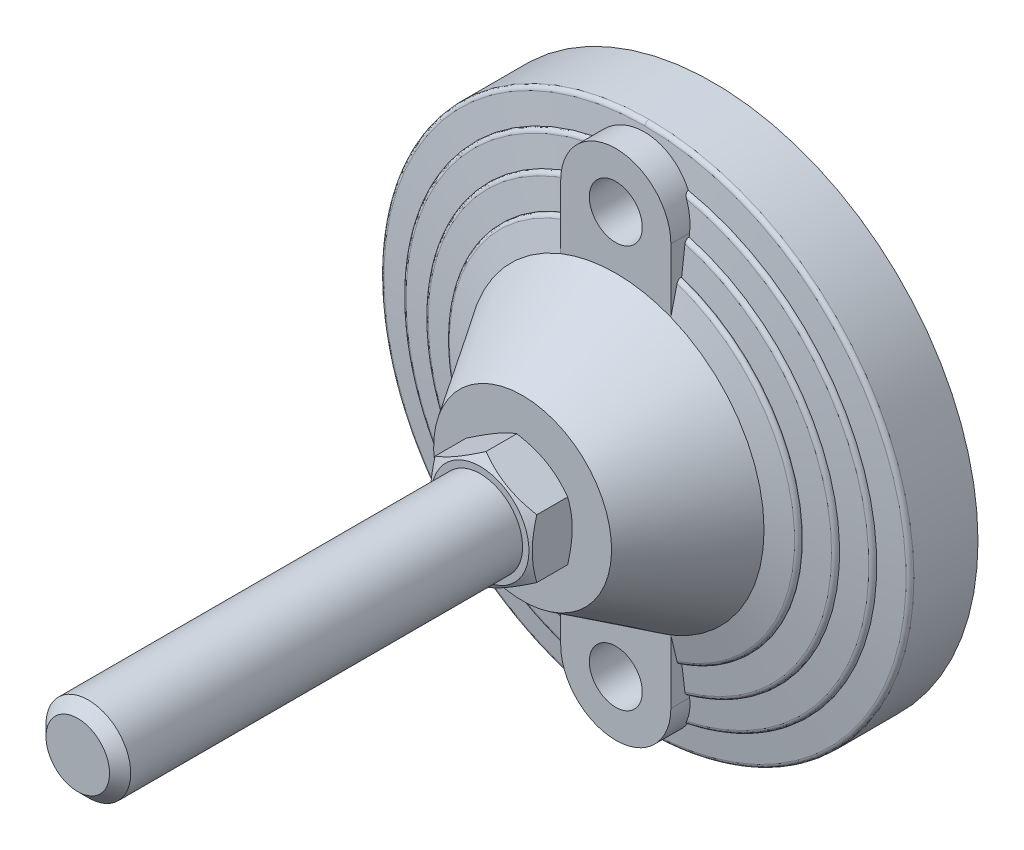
ISO-10303-21;
HEADER;
FILE_DESCRIPTION(('STEP AP214'),'2;1');
FILE_NAME('part.step','',(''),(''),'','','');
FILE_SCHEMA(('AUTOMOTIVE_DESIGN { 1 0 10303 214 1 1 1 1 }'));
ENDSEC;
DATA;
#1=APPLICATION_CONTEXT('core data for automotive mechanical design processes');
#2=APPLICATION_PROTOCOL_DEFINITION('international standard','automotive_design',2000,#1);
#3=PRODUCT_CONTEXT('',#1,'mechanical');
#4=PRODUCT('Part','Part','',(#3));
#5=PRODUCT_RELATED_PRODUCT_CATEGORY('part','',(#4));
#6=PRODUCT_DEFINITION_FORMATION('','',#4);
#7=PRODUCT_DEFINITION_CONTEXT('part definition',#1,'design');
#8=PRODUCT_DEFINITION('design','',#6,#7);
#9=PRODUCT_DEFINITION_SHAPE('','',#8);
#10=(LENGTH_UNIT() NAMED_UNIT(*) SI_UNIT(.MILLI.,.METRE.));
#11=(NAMED_UNIT(*) PLANE_ANGLE_UNIT() SI_UNIT($,.RADIAN.));
#12=(NAMED_UNIT(*) SI_UNIT($,.STERADIAN.) SOLID_ANGLE_UNIT());
#13=UNCERTAINTY_MEASURE_WITH_UNIT(LENGTH_MEASURE(1.E-05),#10,'distance_accuracy_value','');
#14=(GEOMETRIC_REPRESENTATION_CONTEXT(3) GLOBAL_UNCERTAINTY_ASSIGNED_CONTEXT((#13)) GLOBAL_UNIT_ASSIGNED_CONTEXT((#10,
#11,#12)) REPRESENTATION_CONTEXT('',''));
#15=CARTESIAN_POINT('',(0.,0.,0.));
#16=DIRECTION('',(0.,0.,1.));
#17=DIRECTION('',(1.,0.,0.));
#18=AXIS2_PLACEMENT_3D('',#15,#16,#17);
#19=CARTESIAN_POINT('',(0.,-47.5,0.));
#20=DIRECTION('',(0.,0.,1.));
#21=DIRECTION('',(0.,-1.,0.));
#22=AXIS2_PLACEMENT_3D('',#19,#20,#21);
#23=CYLINDRICAL_SURFACE('',#22,6.25);
#24=CARTESIAN_POINT('',(0.,-47.5,0.));
#25=DIRECTION('',(0.,0.,1.));
#26=DIRECTION('',(0.,-1.,0.));
#27=AXIS2_PLACEMENT_3D('',#24,#25,#26);
#28=CIRCLE('',#27,6.25);
#29=CARTESIAN_POINT('',(0.,-53.75,0.));
#30=VERTEX_POINT('',#29);
#31=EDGE_CURVE('E218',#30,#30,#28,.F.);
#32=ORIENTED_EDGE('',*,*,#31,.T.);
#33=EDGE_LOOP('',(#32));
#34=FACE_BOUND('',#33,.T.);
#35=CARTESIAN_POINT('',(0.,-47.5,23.));
#36=DIRECTION('',(0.,0.,1.));
#37=DIRECTION('',(0.,-1.,0.));
#38=AXIS2_PLACEMENT_3D('',#35,#36,#37);
#39=CIRCLE('',#38,6.25);
#40=CARTESIAN_POINT('',(0.,-53.75,23.));
#41=VERTEX_POINT('',#40);
#42=EDGE_CURVE('E572',#41,#41,#39,.T.);
#43=ORIENTED_EDGE('',*,*,#42,.T.);
#44=EDGE_LOOP('',(#43));
#45=FACE_BOUND('',#44,.T.);
#46=ADVANCED_FACE('F14',(#34,#45),#23,.F.);
#47=CARTESIAN_POINT('',(-21.325127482,-21.252,45.));
#48=DIRECTION('',(0.,0.,-1.));
#49=DIRECTION('',(0.,1.,0.));
#50=AXIS2_PLACEMENT_3D('',#47,#48,#49);
#51=PLANE('',#50);
#52=CARTESIAN_POINT('',(0.,0.,45.));
#53=DIRECTION('',(0.,0.,-1.));
#54=DIRECTION('',(0.,1.,0.));
#55=AXIS2_PLACEMENT_3D('',#52,#53,#54);
#56=CIRCLE('',#55,21.);
#57=CARTESIAN_POINT('',(0.,21.,45.));
#58=VERTEX_POINT('',#57);
#59=EDGE_CURVE('E571',#58,#58,#56,.T.);
#60=ORIENTED_EDGE('',*,*,#59,.F.);
#61=EDGE_LOOP('',(#60));
#62=FACE_BOUND('',#61,.T.);
#63=CARTESIAN_POINT('',(0.,0.,45.));
#64=DIRECTION('',(0.,0.,-1.));
#65=DIRECTION('',(0.,1.,0.));
#66=AXIS2_PLACEMENT_3D('',#63,#64,#65);
#67=CIRCLE('',#66,11.5);
#68=CARTESIAN_POINT('',(0.,11.5,45.));
#69=VERTEX_POINT('',#68);
#70=EDGE_CURVE('E214',#69,#69,#67,.T.);
#71=ORIENTED_EDGE('',*,*,#70,.T.);
#72=EDGE_LOOP('',(#71));
#73=FACE_BOUND('',#72,.T.);
#74=ADVANCED_FACE('F1024',(#62,#73),#51,.F.);
#75=CARTESIAN_POINT('',(-63.467641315,63.25,0.));
#76=DIRECTION('',(0.,0.,1.));
#77=DIRECTION('',(0.,-1.,0.));
#78=AXIS2_PLACEMENT_3D('',#75,#76,#77);
#79=PLANE('',#78);
#80=ORIENTED_EDGE('',*,*,#31,.F.);
#81=EDGE_LOOP('',(#80));
#82=FACE_BOUND('',#81,.T.);
#83=CARTESIAN_POINT('',(0.,47.5,0.));
#84=DIRECTION('',(0.,0.,1.));
#85=DIRECTION('',(0.,-1.,0.));
#86=AXIS2_PLACEMENT_3D('',#83,#84,#85);
#87=CIRCLE('',#86,6.25);
#88=CARTESIAN_POINT('',(0.,41.25,0.));
#89=VERTEX_POINT('',#88);
#90=EDGE_CURVE('E687',#89,#89,#87,.T.);
#91=ORIENTED_EDGE('',*,*,#90,.T.);
#92=EDGE_LOOP('',(#91));
#93=FACE_BOUND('',#92,.T.);
#94=CARTESIAN_POINT('',(0.,0.,0.));
#95=DIRECTION('',(0.,0.,-1.));
#96=DIRECTION('',(1.,0.,0.));
#97=AXIS2_PLACEMENT_3D('',#94,#95,#96);
#98=CIRCLE('',#97,62.5);
#99=CARTESIAN_POINT('',(62.5,0.,0.));
#100=VERTEX_POINT('',#99);
#101=EDGE_CURVE('E419',#100,#100,#98,.F.);
#102=ORIENTED_EDGE('',*,*,#101,.F.);
#103=EDGE_LOOP('',(#102));
#104=FACE_BOUND('',#103,.T.);
#105=ADVANCED_FACE('F387',(#82,#93,#104),#79,.F.);
#106=CARTESIAN_POINT('',(0.,0.,23.));
#107=DIRECTION('',(0.,0.,-1.));
#108=DIRECTION('',(0.,1.,0.));
#109=AXIS2_PLACEMENT_3D('',#106,#107,#108);
#110=CONICAL_SURFACE('',#109,35.,1.32154418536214);
#111=CARTESIAN_POINT('',(0.,0.,23.));
#112=DIRECTION('',(0.,0.,-1.));
#113=DIRECTION('',(0.,1.,0.));
#114=AXIS2_PLACEMENT_3D('',#111,#112,#113);
#115=CIRCLE('',#114,35.);
#116=CARTESIAN_POINT('',(12.9999999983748,-32.4961536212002,22.9999999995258));
#117=VERTEX_POINT('',#116);
#118=CARTESIAN_POINT('',(13.0000000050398,32.4961536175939,22.9999999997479));
#119=VERTEX_POINT('',#118);
#120=EDGE_CURVE('E568',#117,#119,#115,.F.);
#121=ORIENTED_EDGE('',*,*,#120,.F.);
#122=CARTESIAN_POINT('',(13.0000000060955,-38.6172483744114,21.5372089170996));
#123=CARTESIAN_POINT('',(13.0000000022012,-38.1074186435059,21.6602002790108));
#124=CARTESIAN_POINT('',(13.0000000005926,-37.5975329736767,21.7829600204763));
#125=CARTESIAN_POINT('',(12.9999999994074,-36.5776365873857,22.0279559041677));
#126=CARTESIAN_POINT('',(12.9999999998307,-36.0676258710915,22.1501920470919));
#127=CARTESIAN_POINT('',(13.0000000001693,-35.0474647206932,22.3940807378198));
#128=CARTESIAN_POINT('',(13.0000000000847,-34.5373142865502,22.5157332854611));
#129=CARTESIAN_POINT('',(12.9999999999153,-33.5168560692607,22.7583795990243));
#130=CARTESIAN_POINT('',(12.9999999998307,-33.0065482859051,22.8793733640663));
#131=CARTESIAN_POINT('',(13.,-32.496153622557,22.9999999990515));
#132=B_SPLINE_CURVE_WITH_KNOTS('',3,(#122,#123,#124,#125,#126,#127,#128,#129,#130,#131),
.UNSPECIFIED.,.F.,.F.,(4,2,2,2,4),(0.,1.57336555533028,3.14672901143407,4.72009290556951,
6.2934589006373),.UNSPECIFIED.);
#133=CARTESIAN_POINT('',(13.,-38.6172483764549,21.5372089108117));
#134=VERTEX_POINT('',#133);
#135=EDGE_CURVE('E372',#134,#117,#132,.T.);
#136=ORIENTED_EDGE('',*,*,#135,.F.);
#137=CARTESIAN_POINT('',(0.,0.,21.53720891));
#138=DIRECTION('',(0.,0.,-1.));
#139=DIRECTION('',(0.,1.,0.));
#140=AXIS2_PLACEMENT_3D('',#137,#138,#139);
#141=CIRCLE('',#140,40.746679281);
#142=CARTESIAN_POINT('',(13.,38.6172483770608,21.5372089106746));
#143=VERTEX_POINT('',#142);
#144=EDGE_CURVE('E222',#143,#134,#141,.T.);
#145=ORIENTED_EDGE('',*,*,#144,.F.);
#146=CARTESIAN_POINT('',(13.,32.4961536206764,22.999999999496));
#147=CARTESIAN_POINT('',(13.,33.0065482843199,22.8793733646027));
#148=CARTESIAN_POINT('',(13.,33.5168560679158,22.758379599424));
#149=CARTESIAN_POINT('',(13.,34.5373142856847,22.515733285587));
#150=CARTESIAN_POINT('',(13.,35.0474647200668,22.3940807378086));
#151=CARTESIAN_POINT('',(13.,36.0676258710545,22.1501920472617));
#152=CARTESIAN_POINT('',(13.,36.577636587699,22.0279559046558));
#153=CARTESIAN_POINT('',(13.,37.597532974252,21.7829600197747));
#154=CARTESIAN_POINT('',(13.,38.1074186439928,21.6602002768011));
#155=CARTESIAN_POINT('',(13.,38.6172483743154,21.5372089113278));
#156=B_SPLINE_CURVE_WITH_KNOTS('',3,(#146,#147,#148,#149,#150,#151,#152,#153,#154,#155),
.UNSPECIFIED.,.F.,.F.,(4,2,2,2,4),(0.,1.57336599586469,3.1467298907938,4.72009334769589,
6.29345890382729),.UNSPECIFIED.);
#157=EDGE_CURVE('E679',#119,#143,#156,.T.);
#158=ORIENTED_EDGE('',*,*,#157,.F.);
#159=EDGE_LOOP('',(#121,#136,#145,#158));
#160=FACE_BOUND('',#159,.T.);
#161=ADVANCED_FACE('F678',(#160),#110,.T.);
#162=CARTESIAN_POINT('',(12.406354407,39.602176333,20.568111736));
#163=CARTESIAN_POINT('',(59.707464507,24.78394183,20.568111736));
#164=CARTESIAN_POINT('',(59.707464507,-24.78394183,20.568111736));
#165=CARTESIAN_POINT('',(12.406354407,-39.602176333,20.568111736));
#166=CARTESIAN_POINT('',(12.406354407,39.602176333,21.044046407));
#167=CARTESIAN_POINT('',(59.707464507,24.78394183,21.044046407));
#168=CARTESIAN_POINT('',(59.707464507,-24.78394183,21.044046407));
#169=CARTESIAN_POINT('',(12.406354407,-39.602176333,21.044046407));
#170=CARTESIAN_POINT('',(12.31903347,39.323440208,21.419805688));
#171=CARTESIAN_POINT('',(59.287219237,24.609502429,21.419805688));
#172=CARTESIAN_POINT('',(59.287219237,-24.609502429,21.419805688));
#173=CARTESIAN_POINT('',(12.31903347,-39.323440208,21.419805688));
#174=CARTESIAN_POINT('',(12.18115046,38.883305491,21.53720891));
#175=CARTESIAN_POINT('',(58.623636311,24.334056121,21.53720891));
#176=CARTESIAN_POINT('',(58.623636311,-24.334056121,21.53720891));
#177=CARTESIAN_POINT('',(12.18115046,-38.883305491,21.53720891));
#178=(BOUNDED_SURFACE() B_SPLINE_SURFACE(3,3,((#162,#163,#164,#165),(#166,#167,#168,#169),(#170,
#171,#172,#173),(#174,#175,#176,#177)),.UNSPECIFIED.,.F.,.F.,
.F.) B_SPLINE_SURFACE_WITH_KNOTS((4,4),(4,4),(0.,1.),(0.,1.),
.UNSPECIFIED.) GEOMETRIC_REPRESENTATION_ITEM() RATIONAL_B_SPLINE_SURFACE(((1.,0.532632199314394,
0.532632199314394,1.),(0.859679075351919,0.457892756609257,0.457892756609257,0.859679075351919),
(0.859679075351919,0.457892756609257,0.457892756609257,0.859679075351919),(1.,0.532632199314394,
0.532632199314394,1.))) REPRESENTATION_ITEM('') SURFACE());
#179=CARTESIAN_POINT('',(13.,-39.4112927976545,20.5681117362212));
#180=CARTESIAN_POINT('',(13.,-39.411293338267,20.5952104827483));
#181=CARTESIAN_POINT('',(13.,-39.4101321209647,20.6222958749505));
#182=CARTESIAN_POINT('',(13.,-39.4055044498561,20.6762650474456));
#183=CARTESIAN_POINT('',(13.,-39.4020383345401,20.7031488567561));
#184=CARTESIAN_POINT('',(13.,-39.3882336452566,20.7831079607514));
#185=CARTESIAN_POINT('',(13.,-39.3744885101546,20.8356344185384));
#186=CARTESIAN_POINT('',(13.,-39.3384084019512,20.9376087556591));
#187=CARTESIAN_POINT('',(13.,-39.3160736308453,20.9870567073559));
#188=CARTESIAN_POINT('',(13.,-39.2635909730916,21.081601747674));
#189=CARTESIAN_POINT('',(13.,-39.233444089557,21.1266993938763));
#190=CARTESIAN_POINT('',(13.,-39.165605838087,21.2123360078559));
#191=CARTESIAN_POINT('',(13.,-39.1277714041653,21.2527614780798));
#192=CARTESIAN_POINT('',(13.,-39.0461074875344,21.3270714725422));
#193=CARTESIAN_POINT('',(13.,-39.0022718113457,21.360949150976));
#194=CARTESIAN_POINT('',(13.,-38.9043172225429,21.425052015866));
#195=CARTESIAN_POINT('',(13.,-38.8495953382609,21.4543647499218));
#196=CARTESIAN_POINT('',(13.,-38.7644641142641,21.4909906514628));
#197=CARTESIAN_POINT('',(13.,-38.7355751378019,21.5019763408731));
#198=CARTESIAN_POINT('',(13.,-38.67697961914,21.5214626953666));
#199=CARTESIAN_POINT('',(13.,-38.6472733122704,21.5299640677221));
#200=CARTESIAN_POINT('',(13.,-38.6172483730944,21.5372089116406));
#201=B_SPLINE_CURVE_WITH_KNOTS('',3,(#179,#180,#181,#182,#183,#184,#185,#186,#187,#188,#189,
#190,#191,#192,#193,#194,#195,#196,#197,#198,#199,#200),.UNSPECIFIED.,.F.,.F.,(4,2,2,2,2,2,2,2,
2,2,4),(0.,0.0812450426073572,0.162478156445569,0.324519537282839,0.486557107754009,
0.648573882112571,0.8139395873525,0.979477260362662,1.16468654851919,1.25731455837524,
1.34991617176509),.UNSPECIFIED.);
#202=CARTESIAN_POINT('',(13.,-39.4112928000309,20.5681117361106));
#203=VERTEX_POINT('',#202);
#204=EDGE_CURVE('E399',#203,#134,#201,.T.);
#205=CARTESIAN_POINT('',(0.,0.,20.568111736));
#206=DIRECTION('',(0.,0.,-1.));
#207=DIRECTION('',(0.,1.,0.));
#208=AXIS2_PLACEMENT_3D('',#205,#206,#207);
#209=CIRCLE('',#208,41.5);
#210=CARTESIAN_POINT('',(13.,39.4112928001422,20.5681117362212));
#211=VERTEX_POINT('',#210);
#212=EDGE_CURVE('E430',#211,#203,#209,.T.);
#213=CARTESIAN_POINT('',(13.,38.6172483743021,21.5372089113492));
#214=CARTESIAN_POINT('',(13.,38.6757273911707,21.5231434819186));
#215=CARTESIAN_POINT('',(13.,38.7330575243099,21.5042077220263));
#216=CARTESIAN_POINT('',(13.,38.8438981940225,21.4570874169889));
#217=CARTESIAN_POINT('',(13.,38.8974017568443,21.4288864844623));
#218=CARTESIAN_POINT('',(13.,38.9989209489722,21.363734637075));
#219=CARTESIAN_POINT('',(13.,39.0469285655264,21.3267711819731));
#220=CARTESIAN_POINT('',(13.,39.135707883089,21.2450475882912));
#221=CARTESIAN_POINT('',(13.,39.1764870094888,21.2002955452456));
#222=CARTESIAN_POINT('',(13.,39.247988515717,21.1059931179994));
#223=CARTESIAN_POINT('',(13.,39.2790300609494,21.0566848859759));
#224=CARTESIAN_POINT('',(13.,39.3318958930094,20.9533393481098));
#225=CARTESIAN_POINT('',(13.,39.353722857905,20.899303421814));
#226=CARTESIAN_POINT('',(13.,39.3839717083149,20.7991363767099));
#227=CARTESIAN_POINT('',(13.,39.3941848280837,20.7535382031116));
#228=CARTESIAN_POINT('',(13.,39.4078594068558,20.6613400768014));
#229=CARTESIAN_POINT('',(13.,39.4113205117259,20.6147400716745));
#230=CARTESIAN_POINT('',(13.,39.4112927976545,20.5681117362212));
#231=B_SPLINE_CURVE_WITH_KNOTS('',3,(#213,#214,#215,#216,#217,#218,#219,#220,#221,#222,#223,
#224,#225,#226,#227,#228,#229,#230),.UNSPECIFIED.,.F.,.F.,(4,2,2,2,2,2,2,2,4),(0.,
0.180276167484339,0.360872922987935,0.541729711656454,0.722399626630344,0.896310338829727,
1.07017047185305,1.20986981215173,1.34957647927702),.UNSPECIFIED.);
#232=EDGE_CURVE('E657',#143,#211,#231,.T.);
#233=ORIENTED_EDGE('',*,*,#144,.T.);
#234=ORIENTED_EDGE('',*,*,#204,.F.);
#235=ORIENTED_EDGE('',*,*,#212,.F.);
#236=ORIENTED_EDGE('',*,*,#232,.F.);
#237=EDGE_LOOP('',(#233,#234,#235,#236));
#238=FACE_BOUND('',#237,.T.);
#239=ADVANCED_FACE('F671',(#238),#178,.T.);
#240=CARTESIAN_POINT('',(0.,0.,20.568111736));
#241=DIRECTION('',(0.,0.,-1.));
#242=DIRECTION('',(0.,1.,0.));
#243=AXIS2_PLACEMENT_3D('',#240,#241,#242);
#244=CYLINDRICAL_SURFACE('',#243,41.5);
#245=CARTESIAN_POINT('',(0.,0.,20.454545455));
#246=DIRECTION('',(0.,0.,-1.));
#247=DIRECTION('',(0.,1.,0.));
#248=AXIS2_PLACEMENT_3D('',#245,#246,#247);
#249=CIRCLE('',#248,41.5);
#250=CARTESIAN_POINT('',(13.,39.4112928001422,20.454545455));
#251=VERTEX_POINT('',#250);
#252=CARTESIAN_POINT('',(13.,-39.4112928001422,20.4545454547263));
#253=VERTEX_POINT('',#252);
#254=EDGE_CURVE('E550',#251,#253,#249,.T.);
#255=ORIENTED_EDGE('',*,*,#254,.F.);
#256=DIRECTION('',(0.,0.,-1.));
#257=VECTOR('',#256,1.);
#258=CARTESIAN_POINT('',(13.,39.4112928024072,20.7755712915));
#259=LINE('',#258,#257);
#260=EDGE_CURVE('E653',#211,#251,#259,.T.);
#261=ORIENTED_EDGE('',*,*,#260,.F.);
#262=ORIENTED_EDGE('',*,*,#212,.T.);
#263=DIRECTION('',(0.,0.,1.));
#264=VECTOR('',#263,1.);
#265=CARTESIAN_POINT('',(13.,-39.4112928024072,20.7755712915));
#266=LINE('',#265,#264);
#267=EDGE_CURVE('E412',#253,#203,#266,.T.);
#268=ORIENTED_EDGE('',*,*,#267,.F.);
#269=EDGE_LOOP('',(#255,#261,#262,#268));
#270=FACE_BOUND('',#269,.T.);
#271=ADVANCED_FACE('F668',(#270),#244,.T.);
#272=CARTESIAN_POINT('',(0.,0.,20.454545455));
#273=DIRECTION('',(0.,0.,-1.));
#274=DIRECTION('',(0.,1.,0.));
#275=AXIS2_PLACEMENT_3D('',#272,#273,#274);
#276=CONICAL_SURFACE('',#275,41.5,1.4442041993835);
#277=ORIENTED_EDGE('',*,*,#254,.T.);
#278=CARTESIAN_POINT('',(13.0000000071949,-45.8176832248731,19.6748403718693));
#279=CARTESIAN_POINT('',(13.0000000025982,-45.2838642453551,19.7402005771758));
#280=CARTESIAN_POINT('',(13.0000000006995,-44.7500350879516,19.8054777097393));
#281=CARTESIAN_POINT('',(12.9999999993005,-43.6823542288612,19.9358466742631));
#282=CARTESIAN_POINT('',(12.9999999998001,-43.1485025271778,20.0009385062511));
#283=CARTESIAN_POINT('',(13.0000000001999,-42.0807742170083,20.1309177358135));
#284=CARTESIAN_POINT('',(13.0000000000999,-41.5468976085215,20.1958051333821));
#285=CARTESIAN_POINT('',(12.9999999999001,-40.4791166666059,20.3253520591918));
#286=CARTESIAN_POINT('',(12.9999999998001,-39.9452123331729,20.390011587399));
#287=CARTESIAN_POINT('',(13.,-39.4112928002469,20.4545454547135));
#288=B_SPLINE_CURVE_WITH_KNOTS('',3,(#278,#279,#280,#281,#282,#283,#284,#285,#286,#287),
.UNSPECIFIED.,.F.,.F.,(4,2,2,2,4),(0.,1.61341623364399,3.22683222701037,4.84024826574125,
6.45366454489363),.UNSPECIFIED.);
#289=CARTESIAN_POINT('',(13.,-45.8176832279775,19.6748403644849));
#290=VERTEX_POINT('',#289);
#291=EDGE_CURVE('E406',#290,#253,#288,.T.);
#292=ORIENTED_EDGE('',*,*,#291,.F.);
#293=CARTESIAN_POINT('',(-7.48558333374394E-10,0.,19.674840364));
#294=DIRECTION('',(0.,0.,-1.));
#295=DIRECTION('',(0.,1.,0.));
#296=AXIS2_PLACEMENT_3D('',#293,#294,#295);
#297=CIRCLE('',#296,47.6262542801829);
#298=CARTESIAN_POINT('',(13.,45.8176832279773,19.6748403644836));
#299=VERTEX_POINT('',#298);
#300=EDGE_CURVE('E426',#299,#290,#297,.T.);
#301=ORIENTED_EDGE('',*,*,#300,.F.);
#302=CARTESIAN_POINT('',(12.999999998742,39.4112928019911,20.4545454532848));
#303=CARTESIAN_POINT('',(12.9999999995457,39.9452123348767,20.3900115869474));
#304=CARTESIAN_POINT('',(12.9999999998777,40.4791166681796,20.3253520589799));
#305=CARTESIAN_POINT('',(13.0000000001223,41.5468976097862,20.1958051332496));
#306=CARTESIAN_POINT('',(13.0000000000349,42.080774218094,20.1309177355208));
#307=CARTESIAN_POINT('',(12.9999999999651,43.1485025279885,20.000938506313));
#308=CARTESIAN_POINT('',(12.9999999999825,43.6823542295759,19.9358466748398));
#309=CARTESIAN_POINT('',(13.0000000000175,44.7500350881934,19.8054777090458));
#310=CARTESIAN_POINT('',(13.0000000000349,45.2838642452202,19.7402005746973));
#311=CARTESIAN_POINT('',(13.,45.817683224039,19.6748403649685));
#312=B_SPLINE_CURVE_WITH_KNOTS('',3,(#302,#303,#304,#305,#306,#307,#308,#309,#310,#311),
.UNSPECIFIED.,.F.,.F.,(4,2,2,2,4),(0.,1.61341627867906,3.226832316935,4.84024830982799,
6.45366454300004),.UNSPECIFIED.);
#313=EDGE_CURVE('E656',#251,#299,#312,.T.);
#314=ORIENTED_EDGE('',*,*,#313,.F.);
#315=EDGE_LOOP('',(#277,#292,#301,#314));
#316=FACE_BOUND('',#315,.T.);
#317=ADVANCED_FACE('F339',(#316),#276,.T.);
#318=CARTESIAN_POINT('',(12.269850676,46.922284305,18.669623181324));
#319=CARTESIAN_POINT('',(72.557631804,31.157449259,18.6696231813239));
#320=CARTESIAN_POINT('',(72.557631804,-31.157449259,18.6696231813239));
#321=CARTESIAN_POINT('',(12.269850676,-46.922284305,18.669623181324));
#322=CARTESIAN_POINT('',(12.269850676,46.922284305,18.6740296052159));
#323=CARTESIAN_POINT('',(72.557631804,31.157449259,18.674029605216));
#324=CARTESIAN_POINT('',(72.557631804,-31.157449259,18.674029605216));
#325=CARTESIAN_POINT('',(12.269850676,-46.922284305,18.6740296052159));
#326=CARTESIAN_POINT('',(12.269850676,46.922284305,18.678436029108));
#327=CARTESIAN_POINT('',(72.557631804,31.157449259,18.678436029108));
#328=CARTESIAN_POINT('',(72.557631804,-31.157449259,18.678436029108));
#329=CARTESIAN_POINT('',(12.269850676,-46.922284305,18.678436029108));
#330=CARTESIAN_POINT('',(12.269850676,46.922284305,18.682842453));
#331=CARTESIAN_POINT('',(72.557631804,31.157449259,18.682842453));
#332=CARTESIAN_POINT('',(72.557631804,-31.157449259,18.682842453));
#333=CARTESIAN_POINT('',(12.269850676,-46.922284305,18.682842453));
#334=CARTESIAN_POINT('',(12.269850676,46.922284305,19.211436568));
#335=CARTESIAN_POINT('',(72.557631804,31.157449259,19.211436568));
#336=CARTESIAN_POINT('',(72.557631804,-31.157449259,19.211436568));
#337=CARTESIAN_POINT('',(12.269850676,-46.922284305,19.211436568));
#338=CARTESIAN_POINT('',(12.181461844,46.584268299,19.608103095));
#339=CARTESIAN_POINT('',(72.034945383,30.93299905,19.608103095));
#340=CARTESIAN_POINT('',(72.034945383,-30.93299905,19.608103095));
#341=CARTESIAN_POINT('',(12.181461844,-46.584268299,19.608103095));
#342=CARTESIAN_POINT('',(12.048804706,46.076961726,19.674840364));
#343=CARTESIAN_POINT('',(71.250478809,30.596136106,19.674840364));
#344=CARTESIAN_POINT('',(71.250478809,-30.596136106,19.674840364));
#345=CARTESIAN_POINT('',(12.048804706,-46.076961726,19.674840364));
#346=(BOUNDED_SURFACE() B_SPLINE_SURFACE(3,3,((#318,#319,#320,#321),(#322,#323,#324,#325),(#326,
#327,#328,#329),(#330,#331,#332,#333),(#334,#335,#336,#337),(#338,#339,#340,#341),(#342,#343,
#344,#345)),.UNSPECIFIED.,.F.,.F.,.F.) B_SPLINE_SURFACE_WITH_KNOTS((4,3,4),(4,4),(-0.01,0.,1.),
(0.,1.),.UNSPECIFIED.) GEOMETRIC_REPRESENTATION_ITEM() RATIONAL_B_SPLINE_SURFACE(((1.,
0.501991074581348,0.501991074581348,1.),(1.,0.501991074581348,0.501991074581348,1.),(1.,
0.501991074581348,0.501991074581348,1.),(1.,0.501991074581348,0.501991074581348,1.),
(0.833611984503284,0.418465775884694,0.418465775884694,0.833611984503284),(0.833611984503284,
0.418465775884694,0.418465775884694,0.833611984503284),(1.,0.501991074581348,0.501991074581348,1.))) REPRESENTATION_ITEM('') SURFACE());
#347=CARTESIAN_POINT('',(13.,-46.7252608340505,18.6777848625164));
#348=CARTESIAN_POINT('',(13.,-46.7253979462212,18.7054287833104));
#349=CARTESIAN_POINT('',(13.,-46.7243484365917,18.7330653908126));
#350=CARTESIAN_POINT('',(13.,-46.719887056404,18.7881439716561));
#351=CARTESIAN_POINT('',(13.,-46.716475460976,18.8155859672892));
#352=CARTESIAN_POINT('',(13.,-46.7027375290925,18.897216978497));
#353=CARTESIAN_POINT('',(13.,-46.688908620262,18.9508576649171));
#354=CARTESIAN_POINT('',(13.,-46.6523707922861,19.0550506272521));
#355=CARTESIAN_POINT('',(13.,-46.629652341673,19.1055995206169));
#356=CARTESIAN_POINT('',(13.,-46.5760978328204,19.2021956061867));
#357=CARTESIAN_POINT('',(13.,-46.5452617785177,19.2482428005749));
#358=CARTESIAN_POINT('',(13.,-46.4762858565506,19.3348542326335));
#359=CARTESIAN_POINT('',(13.,-46.4381108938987,19.3753904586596));
#360=CARTESIAN_POINT('',(13.,-46.3556866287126,19.4497572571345));
#361=CARTESIAN_POINT('',(13.,-46.3114344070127,19.4835845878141));
#362=CARTESIAN_POINT('',(13.,-46.2164675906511,19.5448274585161));
#363=CARTESIAN_POINT('',(13.,-46.1655796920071,19.5719736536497));
#364=CARTESIAN_POINT('',(13.,-46.06010835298,19.6176355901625));
#365=CARTESIAN_POINT('',(13.,-46.0055288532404,19.6361603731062));
#366=CARTESIAN_POINT('',(13.,-45.9281089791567,19.6556819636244));
#367=CARTESIAN_POINT('',(13.,-45.9061721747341,19.6604842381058));
#368=CARTESIAN_POINT('',(13.,-45.8620822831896,19.6686997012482));
#369=CARTESIAN_POINT('',(13.,-45.8399296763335,19.672115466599));
#370=CARTESIAN_POINT('',(13.0000000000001,-45.817683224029,19.674840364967));
#371=B_SPLINE_CURVE_WITH_KNOTS('',3,(#347,#348,#349,#350,#351,#352,#353,#354,#355,#356,#357,
#358,#359,#360,#361,#362,#363,#364,#365,#366,#367,#368,#369,#370),.UNSPECIFIED.,.F.,.F.,(4,2,2,
2,2,2,2,2,2,2,2,4),(0.,0.0828810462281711,0.165752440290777,0.331061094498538,0.496547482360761,
0.662033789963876,0.82833208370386,0.994710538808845,1.16697834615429,1.3390650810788,
1.40639957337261,1.47360835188),.UNSPECIFIED.);
#372=CARTESIAN_POINT('',(13.0000000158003,-46.7252608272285,18.6777848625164));
#373=VERTEX_POINT('',#372);
#374=EDGE_CURVE('E370',#373,#290,#371,.T.);
#375=CARTESIAN_POINT('',(13.0000000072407,46.725260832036,18.6727272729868));
#376=CARTESIAN_POINT('',(13.3212147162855,46.6358917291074,18.6727272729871));
#377=CARTESIAN_POINT('',(13.6414983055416,46.543212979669,18.6727272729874));
#378=CARTESIAN_POINT('',(14.2801231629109,46.3512597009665,18.672727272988));
#379=CARTESIAN_POINT('',(14.5984642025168,46.2519844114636,18.6727272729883));
#380=CARTESIAN_POINT('',(15.5526106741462,45.9435979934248,18.6727272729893));
#381=CARTESIAN_POINT('',(16.1852411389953,45.7245656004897,18.6727272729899));
#382=CARTESIAN_POINT('',(17.4409289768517,45.260491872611,18.6727272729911));
#383=CARTESIAN_POINT('',(18.0639854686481,45.0154481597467,18.6727272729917));
#384=CARTESIAN_POINT('',(19.3000708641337,44.4995075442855,18.672727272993));
#385=CARTESIAN_POINT('',(19.9130888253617,44.228584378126,18.6727272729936));
#386=CARTESIAN_POINT('',(21.1274202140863,43.6615551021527,18.6727272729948));
#387=CARTESIAN_POINT('',(21.7287319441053,43.3654453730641,18.6727272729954));
#388=CARTESIAN_POINT('',(23.5288179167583,42.4321391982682,18.6727272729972));
#389=CARTESIAN_POINT('',(24.7079785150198,41.7565378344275,18.6727272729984));
#390=CARTESIAN_POINT('',(27.0057517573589,40.3086198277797,18.6727272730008));
#391=CARTESIAN_POINT('',(28.1243409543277,39.536266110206,18.672727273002));
#392=CARTESIAN_POINT('',(30.2940548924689,37.8994558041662,18.6727272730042));
#393=CARTESIAN_POINT('',(31.3451007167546,37.0348945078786,18.6727272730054));
#394=CARTESIAN_POINT('',(33.3707378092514,35.2206259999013,18.6727272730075));
#395=CARTESIAN_POINT('',(34.3453363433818,34.2709268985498,18.6727272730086));
#396=CARTESIAN_POINT('',(36.2141318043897,32.2900336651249,18.6727272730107));
#397=CARTESIAN_POINT('',(37.1080775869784,31.2586025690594,18.6727272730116));
#398=CARTESIAN_POINT('',(38.8059105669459,29.1240638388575,18.6727272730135));
#399=CARTESIAN_POINT('',(39.609795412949,28.0209543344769,18.6727272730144));
#400=CARTESIAN_POINT('',(41.1215543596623,25.7512426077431,18.6727272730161));
#401=CARTESIAN_POINT('',(41.8294551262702,24.5846581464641,18.6727272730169));
#402=CARTESIAN_POINT('',(43.1444737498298,22.1960153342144,18.6727272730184));
#403=CARTESIAN_POINT('',(43.7515922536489,20.9739573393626,18.6727272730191));
#404=CARTESIAN_POINT('',(44.8608053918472,18.4828923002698,18.6727272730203));
#405=CARTESIAN_POINT('',(45.3628870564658,17.2138794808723,18.6727272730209));
#406=CARTESIAN_POINT('',(46.2583633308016,14.638066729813,18.6727272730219));
#407=CARTESIAN_POINT('',(46.6517577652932,13.3312667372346,18.6727272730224));
#408=CARTESIAN_POINT('',(47.3270705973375,10.6891374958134,18.6727272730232));
#409=CARTESIAN_POINT('',(47.6089860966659,9.35380750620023,18.6727272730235));
#410=CARTESIAN_POINT('',(48.0593220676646,6.66414532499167,18.672727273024));
#411=CARTESIAN_POINT('',(48.2277425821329,5.30981314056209,18.6727272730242));
#412=CARTESIAN_POINT('',(48.4498861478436,2.59183878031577,18.6727272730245));
#413=CARTESIAN_POINT('',(48.5036145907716,1.22819704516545,18.6727272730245));
#414=CARTESIAN_POINT('',(48.4960080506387,-1.49876561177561,18.6727272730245));
#415=CARTESIAN_POINT('',(48.4346730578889,-2.86208653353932,18.6727272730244));
#416=CARTESIAN_POINT('',(48.197367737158,-5.57880747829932,18.6727272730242));
#417=CARTESIAN_POINT('',(48.0213896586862,-6.93220682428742,18.672727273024));
#418=CARTESIAN_POINT('',(47.5560413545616,-9.61936956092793,18.6727272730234));
#419=CARTESIAN_POINT('',(47.2666711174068,-10.9531329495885,18.6727272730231));
#420=CARTESIAN_POINT('',(46.5765756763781,-13.5916227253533,18.6727272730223));
#421=CARTESIAN_POINT('',(46.175843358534,-14.8963472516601,18.6727272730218));
#422=CARTESIAN_POINT('',(45.2658742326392,-17.4674022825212,18.6727272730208));
#423=CARTESIAN_POINT('',(44.7566374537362,-18.7337327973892,18.6727272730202));
#424=CARTESIAN_POINT('',(43.6334165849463,-21.2187182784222,18.6727272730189));
#425=CARTESIAN_POINT('',(43.0194530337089,-22.4373825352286,18.6727272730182));
#426=CARTESIAN_POINT('',(41.6909757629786,-24.8187625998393,18.6727272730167));
#427=CARTESIAN_POINT('',(40.9764619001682,-25.9814783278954,18.6727272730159));
#428=CARTESIAN_POINT('',(39.7063025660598,-27.8655028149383,18.6727272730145));
#429=CARTESIAN_POINT('',(39.1770724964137,-28.6047764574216,18.6727272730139));
#430=CARTESIAN_POINT('',(38.0778809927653,-30.0524665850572,18.6727272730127));
#431=CARTESIAN_POINT('',(37.5079195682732,-30.7608830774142,18.672727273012));
#432=CARTESIAN_POINT('',(36.3291070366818,-32.1445499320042,18.6727272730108));
#433=CARTESIAN_POINT('',(35.72025642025,-32.8198007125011,18.6727272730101));
#434=CARTESIAN_POINT('',(34.4653645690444,-34.1352484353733,18.6727272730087));
#435=CARTESIAN_POINT('',(33.8193109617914,-34.775433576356,18.672727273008));
#436=CARTESIAN_POINT('',(32.4922294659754,-36.0184899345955,18.6727272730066));
#437=CARTESIAN_POINT('',(31.8112009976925,-36.621360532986,18.6727272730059));
#438=CARTESIAN_POINT('',(30.4163089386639,-37.787892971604,18.6727272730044));
#439=CARTESIAN_POINT('',(29.7024437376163,-38.3515528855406,18.6727272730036));
#440=CARTESIAN_POINT('',(28.1769516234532,-39.487913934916,18.672727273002));
#441=CARTESIAN_POINT('',(27.362377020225,-40.056664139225,18.6727272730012));
#442=CARTESIAN_POINT('',(25.6997855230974,-41.1431320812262,18.6727272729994));
#443=CARTESIAN_POINT('',(24.8517655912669,-41.6608451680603,18.6727272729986));
#444=CARTESIAN_POINT('',(23.1254909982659,-42.6432641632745,18.6727272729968));
#445=CARTESIAN_POINT('',(22.2472346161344,-43.1079670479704,18.6727272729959));
#446=CARTESIAN_POINT('',(20.4623876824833,-43.9832963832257,18.6727272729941));
#447=CARTESIAN_POINT('',(19.5557530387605,-44.3938329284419,18.6727272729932));
#448=CARTESIAN_POINT('',(17.7189637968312,-45.1583612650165,18.6727272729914));
#449=CARTESIAN_POINT('',(16.7888095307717,-45.5123538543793,18.6727272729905));
#450=CARTESIAN_POINT('',(14.9085132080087,-46.1625049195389,18.6727272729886));
#451=CARTESIAN_POINT('',(13.9583713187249,-46.4586638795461,18.6727272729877));
#452=CARTESIAN_POINT('',(13.0000000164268,-46.7252608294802,18.6727272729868));
#453=B_SPLINE_CURVE_WITH_KNOTS('',3,(#375,#376,#377,#378,#379,#380,#381,#382,#383,#384,#385,
#386,#387,#388,#389,#390,#391,#392,#393,#394,#395,#396,#397,#398,#399,#400,#401,#402,#403,#404,
#405,#406,#407,#408,#409,#410,#411,#412,#413,#414,#415,#416,#417,#418,#419,#420,#421,#422,#423,
#424,#425,#426,#427,#428,#429,#430,#431,#432,#433,#434,#435,#436,#437,#438,#439,#440,#441,#442,
#443,#444,#445,#446,#447,#448,#449,#450,#451,#452),.UNSPECIFIED.,.F.,.F.,(4,2,2,2,2,2,2,2,2,2,2,
2,2,2,2,2,2,2,2,2,2,2,2,2,2,2,2,2,2,2,2,2,2,2,2,2,2,2,4),(0.,1.00020816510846,2.00053180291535,
4.00833027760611,6.01631246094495,8.02635452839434,10.0366859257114,14.1084282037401,
18.1817355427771,22.2597186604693,26.3373137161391,30.427196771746,34.5171865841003,
38.6060377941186,42.6948627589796,46.7841923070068,50.8735284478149,54.9629708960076,
59.0524118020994,63.1416604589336,67.2309094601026,71.320434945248,75.4099608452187,
79.4997480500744,83.5895341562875,87.678519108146,91.7675098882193,94.4937471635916,
97.219983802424,99.9461860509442,102.673300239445,105.400459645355,108.12775293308,
111.10629993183,114.085118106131,117.064106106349,120.047978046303,123.031807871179,
126.015612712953),.UNSPECIFIED.);
#454=CARTESIAN_POINT('',(13.0000000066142,46.7252608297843,18.6777848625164));
#455=VERTEX_POINT('',#454);
#456=EDGE_CURVE('E328',#455,#373,#453,.T.);
#457=CARTESIAN_POINT('',(13.,45.817683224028,19.6748403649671));
#458=CARTESIAN_POINT('',(13.,45.8768916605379,19.6676266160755));
#459=CARTESIAN_POINT('',(13.,45.9354849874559,19.6554311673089));
#460=CARTESIAN_POINT('',(13.,46.0498761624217,19.6214764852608));
#461=CARTESIAN_POINT('',(13.,46.105671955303,19.5997103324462));
#462=CARTESIAN_POINT('',(13.,46.2128716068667,19.5469963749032));
#463=CARTESIAN_POINT('',(13.,46.2642705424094,19.5160384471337));
#464=CARTESIAN_POINT('',(13.,46.3367247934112,19.4633763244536));
#465=CARTESIAN_POINT('',(13.,46.3600988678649,19.4447881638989));
#466=CARTESIAN_POINT('',(13.,46.4051654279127,19.4056252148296));
#467=CARTESIAN_POINT('',(13.,46.4268560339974,19.3850482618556));
#468=CARTESIAN_POINT('',(13.,46.4880645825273,19.3216088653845));
#469=CARTESIAN_POINT('',(13.,46.5249454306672,19.2761439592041));
#470=CARTESIAN_POINT('',(13.,46.5901806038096,19.1794685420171));
#471=CARTESIAN_POINT('',(13.,46.6185381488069,19.1282602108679));
#472=CARTESIAN_POINT('',(13.,46.6534889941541,19.0492930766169));
#473=CARTESIAN_POINT('',(13.,46.6637514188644,19.0231112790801));
#474=CARTESIAN_POINT('',(13.,46.681971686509,18.9699855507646));
#475=CARTESIAN_POINT('',(13.,46.6899313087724,18.943042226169));
#476=CARTESIAN_POINT('',(13.,46.7102220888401,18.8614024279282));
#477=CARTESIAN_POINT('',(13.,46.7190275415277,18.8057552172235));
#478=CARTESIAN_POINT('',(13.,46.7237631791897,18.7378782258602));
#479=CARTESIAN_POINT('',(13.,46.724374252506,18.7258595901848));
#480=CARTESIAN_POINT('',(13.,46.7251497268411,18.7018236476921));
#481=CARTESIAN_POINT('',(13.,46.725314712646,18.6898063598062));
#482=CARTESIAN_POINT('',(13.,46.7252608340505,18.6777848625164));
#483=B_SPLINE_CURVE_WITH_KNOTS('',3,(#457,#458,#459,#460,#461,#462,#463,#464,#465,#466,#467,
#468,#469,#470,#471,#472,#473,#474,#475,#476,#477,#478,#479,#480,#481,#482),.UNSPECIFIED.,.F.,
.F.,(4,2,2,2,2,2,2,2,2,2,2,2,4),(0.,0.178718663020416,0.357566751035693,0.536612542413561,
0.626107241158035,0.715700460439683,0.890396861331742,1.06502718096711,1.14929679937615,
1.23350112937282,1.40145320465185,1.43755286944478,1.47360518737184),.UNSPECIFIED.);
#484=EDGE_CURVE('E661',#299,#455,#483,.T.);
#485=ORIENTED_EDGE('',*,*,#300,.T.);
#486=ORIENTED_EDGE('',*,*,#374,.F.);
#487=ORIENTED_EDGE('',*,*,#456,.F.);
#488=ORIENTED_EDGE('',*,*,#484,.F.);
#489=EDGE_LOOP('',(#485,#486,#487,#488));
#490=FACE_BOUND('',#489,.T.);
#491=ADVANCED_FACE('F331',(#490),#346,.T.);
#492=CARTESIAN_POINT('',(0.,62.5,15.119206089));
#493=CARTESIAN_POINT('',(125.,62.5,15.119206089));
#494=CARTESIAN_POINT('',(125.,-62.5,15.119206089));
#495=CARTESIAN_POINT('',(0.,-62.5,15.119206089));
#496=CARTESIAN_POINT('',(0.,62.5,15.647800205));
#497=CARTESIAN_POINT('',(125.,62.5,15.647800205));
#498=CARTESIAN_POINT('',(125.,-62.5,15.647800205));
#499=CARTESIAN_POINT('',(0.,-62.5,15.647800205));
#500=CARTESIAN_POINT('',(0.,62.150618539,16.044466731));
#501=CARTESIAN_POINT('',(124.301237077,62.150618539,16.044466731));
#502=CARTESIAN_POINT('',(124.301237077,-62.150618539,16.044466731));
#503=CARTESIAN_POINT('',(0.,-62.150618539,16.044466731));
#504=CARTESIAN_POINT('',(0.,61.62625428,16.111204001));
#505=CARTESIAN_POINT('',(123.252508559,61.6262542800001,16.111204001));
#506=CARTESIAN_POINT('',(123.252508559,-61.6262542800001,16.111204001));
#507=CARTESIAN_POINT('',(0.,-61.62625428,16.111204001));
#508=(BOUNDED_SURFACE() B_SPLINE_SURFACE(3,3,((#492,#493,#494,#495),(#496,#497,#498,#499),(#500,
#501,#502,#503),(#504,#505,#506,#507)),.UNSPECIFIED.,.F.,.F.,
.F.) B_SPLINE_SURFACE_WITH_KNOTS((4,4),(4,4),(0.,1.),(0.,1.),
.UNSPECIFIED.) GEOMETRIC_REPRESENTATION_ITEM() RATIONAL_B_SPLINE_SURFACE(((1.,0.333333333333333,
0.333333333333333,1.),(0.833611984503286,0.277870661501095,0.277870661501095,0.833611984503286),
(0.833611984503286,0.277870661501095,0.277870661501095,0.833611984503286),(1.,0.333333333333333,
0.333333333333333,1.))) REPRESENTATION_ITEM('') SURFACE());
#509=CARTESIAN_POINT('',(0.,0.,15.119206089));
#510=DIRECTION('',(0.,0.,1.));
#511=DIRECTION('',(-1.,0.,0.));
#512=AXIS2_PLACEMENT_3D('',#509,#510,#511);
#513=CIRCLE('',#512,62.5);
#514=CARTESIAN_POINT('',(-9.61422321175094E-09,-62.5,15.119206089));
#515=VERTEX_POINT('',#514);
#516=CARTESIAN_POINT('',(-2.80605088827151E-09,62.5,15.119206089));
#517=VERTEX_POINT('',#516);
#518=EDGE_CURVE('E423',#515,#517,#513,.T.);
#519=CARTESIAN_POINT('',(0.,62.5,15.119206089));
#520=CARTESIAN_POINT('',(0.,62.5,15.647800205));
#521=CARTESIAN_POINT('',(0.,62.150618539,16.044466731));
#522=CARTESIAN_POINT('',(0.,61.62625428,16.111204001));
#523=(BOUNDED_CURVE() B_SPLINE_CURVE(3,(#519,#520,#521,#522),.UNSPECIFIED.,.F.,
.F.) B_SPLINE_CURVE_WITH_KNOTS((4,4),(0.,1.),
.UNSPECIFIED.) CURVE() GEOMETRIC_REPRESENTATION_ITEM() RATIONAL_B_SPLINE_CURVE((1.,
0.833611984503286,0.833611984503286,1.)) REPRESENTATION_ITEM(''));
#524=CARTESIAN_POINT('',(-8.30046746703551E-09,61.6262542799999,16.1112040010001));
#525=VERTEX_POINT('',#524);
#526=EDGE_CURVE('E557',#525,#517,#523,.F.);
#527=CARTESIAN_POINT('',(0.,0.,16.1112040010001));
#528=DIRECTION('',(0.,0.,-1.));
#529=DIRECTION('',(0.,1.,0.));
#530=AXIS2_PLACEMENT_3D('',#527,#528,#529);
#531=CIRCLE('',#530,61.62625428);
#532=CARTESIAN_POINT('',(-1.57996950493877E-08,-61.6262542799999,16.1112040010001));
#533=VERTEX_POINT('',#532);
#534=EDGE_CURVE('E604',#533,#525,#531,.F.);
#535=CARTESIAN_POINT('',(0.,-62.5,15.119206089));
#536=CARTESIAN_POINT('',(0.,-62.5,15.647800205));
#537=CARTESIAN_POINT('',(0.,-62.150618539,16.044466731));
#538=CARTESIAN_POINT('',(0.,-61.62625428,16.111204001));
#539=(BOUNDED_CURVE() B_SPLINE_CURVE(3,(#535,#536,#537,#538),.UNSPECIFIED.,.F.,
.F.) B_SPLINE_CURVE_WITH_KNOTS((4,4),(0.,1.),
.UNSPECIFIED.) CURVE() GEOMETRIC_REPRESENTATION_ITEM() RATIONAL_B_SPLINE_CURVE((1.,
0.833611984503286,0.833611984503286,1.)) REPRESENTATION_ITEM(''));
#540=EDGE_CURVE('E579',#515,#533,#539,.T.);
#541=ORIENTED_EDGE('',*,*,#518,.T.);
#542=ORIENTED_EDGE('',*,*,#526,.F.);
#543=ORIENTED_EDGE('',*,*,#534,.F.);
#544=ORIENTED_EDGE('',*,*,#540,.F.);
#545=EDGE_LOOP('',(#541,#542,#543,#544));
#546=FACE_BOUND('',#545,.T.);
#547=ADVANCED_FACE('F338',(#546),#508,.T.);
#548=CARTESIAN_POINT('',(0.,0.,15.119206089));
#549=DIRECTION('',(0.,0.,-1.));
#550=DIRECTION('',(1.,0.,0.));
#551=AXIS2_PLACEMENT_3D('',#548,#549,#550);
#552=CYLINDRICAL_SURFACE('',#551,62.5);
#553=ORIENTED_EDGE('',*,*,#518,.F.);
#554=CARTESIAN_POINT('',(0.,0.,15.119206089));
#555=DIRECTION('',(0.,0.,1.));
#556=DIRECTION('',(-1.,0.,0.));
#557=AXIS2_PLACEMENT_3D('',#554,#555,#556);
#558=CIRCLE('',#557,62.5);
#559=EDGE_CURVE('E554',#517,#515,#558,.T.);
#560=ORIENTED_EDGE('',*,*,#559,.F.);
#561=EDGE_LOOP('',(#553,#560));
#562=FACE_BOUND('',#561,.T.);
#563=ORIENTED_EDGE('',*,*,#101,.T.);
#564=EDGE_LOOP('',(#563));
#565=FACE_BOUND('',#564,.T.);
#566=ADVANCED_FACE('F385',(#562,#565),#552,.T.);
#567=CARTESIAN_POINT('',(13.,-47.5,18.551142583));
#568=DIRECTION('',(1.,0.,0.));
#569=DIRECTION('',(0.,1.,0.));
#570=AXIS2_PLACEMENT_3D('',#567,#568,#569);
#571=PLANE('',#570);
#572=ORIENTED_EDGE('',*,*,#267,.T.);
#573=ORIENTED_EDGE('',*,*,#204,.T.);
#574=ORIENTED_EDGE('',*,*,#135,.T.);
#575=DIRECTION('',(0.,-1.,0.));
#576=VECTOR('',#575,1.);
#577=CARTESIAN_POINT('',(13.,-46.5204431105,23.));
#578=LINE('',#577,#576);
#579=CARTESIAN_POINT('',(13.,-47.5000000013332,23.));
#580=VERTEX_POINT('',#579);
#581=EDGE_CURVE('E658',#117,#580,#578,.T.);
#582=ORIENTED_EDGE('',*,*,#581,.T.);
#583=DIRECTION('',(0.,0.,1.));
#584=VECTOR('',#583,1.);
#585=CARTESIAN_POINT('',(13.,-47.5000000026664,19.6070363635));
#586=LINE('',#585,#584);
#587=CARTESIAN_POINT('',(13.,-47.4999998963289,18.5776765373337));
#588=VERTEX_POINT('',#587);
#589=EDGE_CURVE('E560',#588,#580,#586,.T.);
#590=ORIENTED_EDGE('',*,*,#589,.F.);
#591=CARTESIAN_POINT('',(13.,-46.7246498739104,18.67280218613));
#592=CARTESIAN_POINT('',(13.,-46.8538759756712,18.656957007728));
#593=CARTESIAN_POINT('',(13.,-46.983101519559,18.641107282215));
#594=CARTESIAN_POINT('',(13.,-47.241551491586,18.6093987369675));
#595=CARTESIAN_POINT('',(13.,-47.3707759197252,18.593539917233));
#596=CARTESIAN_POINT('',(13.,-47.4999997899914,18.5776765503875));
#597=B_SPLINE_CURVE_WITH_KNOTS('',3,(#591,#592,#593,#594,#595,#596),.UNSPECIFIED.,.F.,.F.,(4,2,
4),(0.,0.390581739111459,0.781163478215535),.UNSPECIFIED.);
#598=EDGE_CURVE('E702',#373,#588,#597,.T.);
#599=ORIENTED_EDGE('',*,*,#598,.F.);
#600=ORIENTED_EDGE('',*,*,#374,.T.);
#601=ORIENTED_EDGE('',*,*,#291,.T.);
#602=EDGE_LOOP('',(#572,#573,#574,#582,#590,#599,#600,#601));
#603=FACE_BOUND('',#602,.T.);
#604=ADVANCED_FACE('F379',(#603),#571,.T.);
#605=CARTESIAN_POINT('',(-13.,-60.713024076,23.));
#606=DIRECTION('',(0.,0.,-1.));
#607=DIRECTION('',(0.,1.,0.));
#608=AXIS2_PLACEMENT_3D('',#605,#606,#607);
#609=PLANE('',#608);
#610=ORIENTED_EDGE('',*,*,#42,.F.);
#611=EDGE_LOOP('',(#610));
#612=FACE_BOUND('',#611,.T.);
#613=ORIENTED_EDGE('',*,*,#581,.F.);
#614=CARTESIAN_POINT('',(0.,0.,23.));
#615=DIRECTION('',(0.,0.,-1.));
#616=DIRECTION('',(0.,1.,0.));
#617=AXIS2_PLACEMENT_3D('',#614,#615,#616);
#618=CIRCLE('',#617,35.);
#619=CARTESIAN_POINT('',(-12.9999999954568,-32.4961536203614,23.));
#620=VERTEX_POINT('',#619);
#621=EDGE_CURVE('E683',#620,#117,#618,.F.);
#622=ORIENTED_EDGE('',*,*,#621,.F.);
#623=DIRECTION('',(0.,1.,0.));
#624=VECTOR('',#623,1.);
#625=CARTESIAN_POINT('',(-13.,-39.95306527,23.));
#626=LINE('',#625,#624);
#627=CARTESIAN_POINT('',(-13.,-47.5,23.));
#628=VERTEX_POINT('',#627);
#629=EDGE_CURVE('E611',#628,#620,#626,.T.);
#630=ORIENTED_EDGE('',*,*,#629,.F.);
#631=CARTESIAN_POINT('',(0.,-47.5,23.));
#632=DIRECTION('',(0.,0.,-1.));
#633=DIRECTION('',(0.,1.,0.));
#634=AXIS2_PLACEMENT_3D('',#631,#632,#633);
#635=CIRCLE('',#634,13.);
#636=EDGE_CURVE('E563',#580,#628,#635,.T.);
#637=ORIENTED_EDGE('',*,*,#636,.F.);
#638=EDGE_LOOP('',(#613,#622,#630,#637));
#639=FACE_BOUND('',#638,.T.);
#640=ADVANCED_FACE('F384',(#612,#639),#609,.F.);
#641=CARTESIAN_POINT('',(0.,0.,45.));
#642=DIRECTION('',(0.,0.,-1.));
#643=DIRECTION('',(0.,1.,0.));
#644=AXIS2_PLACEMENT_3D('',#641,#642,#643);
#645=CONICAL_SURFACE('',#644,21.,0.566729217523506);
#646=ORIENTED_EDGE('',*,*,#59,.T.);
#647=EDGE_LOOP('',(#646));
#648=FACE_BOUND('',#647,.T.);
#649=CARTESIAN_POINT('',(0.,0.,23.));
#650=DIRECTION('',(0.,0.,-1.));
#651=DIRECTION('',(0.,1.,0.));
#652=AXIS2_PLACEMENT_3D('',#649,#650,#651);
#653=CIRCLE('',#652,35.);
#654=CARTESIAN_POINT('',(-13.0000000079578,32.4961536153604,23.));
#655=VERTEX_POINT('',#654);
#656=EDGE_CURVE('E613',#620,#655,#653,.T.);
#657=ORIENTED_EDGE('',*,*,#656,.F.);
#658=ORIENTED_EDGE('',*,*,#621,.T.);
#659=ORIENTED_EDGE('',*,*,#120,.T.);
#660=CARTESIAN_POINT('',(0.,0.,23.));
#661=DIRECTION('',(0.,0.,-1.));
#662=DIRECTION('',(0.,1.,0.));
#663=AXIS2_PLACEMENT_3D('',#660,#661,#662);
#664=CIRCLE('',#663,35.);
#665=EDGE_CURVE('E644',#119,#655,#664,.F.);
#666=ORIENTED_EDGE('',*,*,#665,.T.);
#667=EDGE_LOOP('',(#657,#658,#659,#666));
#668=FACE_BOUND('',#667,.T.);
#669=ADVANCED_FACE('F682',(#648,#668),#645,.T.);
#670=CARTESIAN_POINT('',(0.,47.5,0.));
#671=DIRECTION('',(0.,0.,1.));
#672=DIRECTION('',(0.,-1.,0.));
#673=AXIS2_PLACEMENT_3D('',#670,#671,#672);
#674=CYLINDRICAL_SURFACE('',#673,6.25);
#675=ORIENTED_EDGE('',*,*,#90,.F.);
#676=EDGE_LOOP('',(#675));
#677=FACE_BOUND('',#676,.T.);
#678=CARTESIAN_POINT('',(0.,47.5,23.));
#679=DIRECTION('',(0.,0.,1.));
#680=DIRECTION('',(0.,-1.,0.));
#681=AXIS2_PLACEMENT_3D('',#678,#679,#680);
#682=CIRCLE('',#681,6.25);
#683=CARTESIAN_POINT('',(0.,41.25,23.));
#684=VERTEX_POINT('',#683);
#685=EDGE_CURVE('E282',#684,#684,#682,.T.);
#686=ORIENTED_EDGE('',*,*,#685,.T.);
#687=EDGE_LOOP('',(#686));
#688=FACE_BOUND('',#687,.T.);
#689=ADVANCED_FACE('F291',(#677,#688),#674,.F.);
#690=CARTESIAN_POINT('',(13.,32.40613054,18.551142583));
#691=DIRECTION('',(1.,0.,0.));
#692=DIRECTION('',(0.,1.,0.));
#693=AXIS2_PLACEMENT_3D('',#690,#691,#692);
#694=PLANE('',#693);
#695=DIRECTION('',(0.,0.,-1.));
#696=VECTOR('',#695,1.);
#697=CARTESIAN_POINT('',(13.,47.4999999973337,19.6070363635));
#698=LINE('',#697,#696);
#699=CARTESIAN_POINT('',(13.,47.4999999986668,23.));
#700=VERTEX_POINT('',#699);
#701=CARTESIAN_POINT('',(13.,47.4999999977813,18.5776765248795));
#702=VERTEX_POINT('',#701);
#703=EDGE_CURVE('E281',#700,#702,#698,.T.);
#704=ORIENTED_EDGE('',*,*,#703,.F.);
#705=DIRECTION('',(0.,-1.,0.));
#706=VECTOR('',#705,1.);
#707=CARTESIAN_POINT('',(13.,46.498076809,23.));
#708=LINE('',#707,#706);
#709=EDGE_CURVE('E641',#700,#119,#708,.T.);
#710=ORIENTED_EDGE('',*,*,#709,.T.);
#711=ORIENTED_EDGE('',*,*,#157,.T.);
#712=ORIENTED_EDGE('',*,*,#232,.T.);
#713=ORIENTED_EDGE('',*,*,#260,.T.);
#714=ORIENTED_EDGE('',*,*,#313,.T.);
#715=ORIENTED_EDGE('',*,*,#484,.T.);
#716=CARTESIAN_POINT('',(13.000000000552,47.4999999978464,18.5776765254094));
#717=CARTESIAN_POINT('',(13.000000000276,47.3707760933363,18.5935398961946));
#718=CARTESIAN_POINT('',(13.000000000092,47.2415516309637,18.6093987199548));
#719=CARTESIAN_POINT('',(12.999999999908,46.983101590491,18.6411072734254));
#720=CARTESIAN_POINT('',(12.999999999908,46.8538760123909,18.6569570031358));
#721=CARTESIAN_POINT('',(13.,46.7246498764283,18.6728021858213));
#722=B_SPLINE_CURVE_WITH_KNOTS('',3,(#716,#717,#718,#719,#720,#721),.UNSPECIFIED.,.F.,.F.,(4,2,
4),(0.,0.390581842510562,0.781163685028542),.UNSPECIFIED.);
#723=EDGE_CURVE('E330',#702,#455,#722,.T.);
#724=ORIENTED_EDGE('',*,*,#723,.F.);
#725=EDGE_LOOP('',(#704,#710,#711,#712,#713,#714,#715,#724));
#726=FACE_BOUND('',#725,.T.);
#727=ADVANCED_FACE('F289',(#726),#694,.T.);
#728=CARTESIAN_POINT('',(0.,0.,18.672727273));
#729=DIRECTION('',(0.,0.,-1.));
#730=DIRECTION('',(0.,1.,0.));
#731=AXIS2_PLACEMENT_3D('',#728,#729,#730);
#732=CONICAL_SURFACE('',#731,48.5,1.44420419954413);
#733=ORIENTED_EDGE('',*,*,#723,.T.);
#734=ORIENTED_EDGE('',*,*,#456,.T.);
#735=ORIENTED_EDGE('',*,*,#598,.T.);
#736=CARTESIAN_POINT('',(11.593256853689,-53.3818700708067,17.8930221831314));
#737=CARTESIAN_POINT('',(11.7613010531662,-53.0507456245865,17.9296661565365));
#738=CARTESIAN_POINT('',(11.9150335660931,-52.712485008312,17.9673922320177));
#739=CARTESIAN_POINT('',(12.1930253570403,-52.0241209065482,18.0448334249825));
#740=CARTESIAN_POINT('',(12.3172727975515,-51.6740127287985,18.0845493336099));
#741=CARTESIAN_POINT('',(12.5332133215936,-50.9714687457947,18.1649849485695));
#742=CARTESIAN_POINT('',(12.6254861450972,-50.6192069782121,18.2056706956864));
#743=CARTESIAN_POINT('',(12.7801065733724,-49.9085284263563,18.2885418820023));
#744=CARTESIAN_POINT('',(12.8424702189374,-49.5501150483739,18.3307265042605));
#745=CARTESIAN_POINT('',(12.9262918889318,-48.9107514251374,18.4067383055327));
#746=CARTESIAN_POINT('',(12.953801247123,-48.6305476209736,18.4403063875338));
#747=CARTESIAN_POINT('',(12.9907296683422,-48.066897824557,18.5083749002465));
#748=CARTESIAN_POINT('',(13.0000099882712,-47.7834433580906,18.5428804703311));
#749=CARTESIAN_POINT('',(13.,-47.4999997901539,18.5776765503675));
#750=B_SPLINE_CURVE_WITH_KNOTS('',3,(#736,#737,#738,#739,#740,#741,#742,#743,#744,#745,#746,
#747,#748,#749),.UNSPECIFIED.,.F.,.F.,(4,2,2,2,2,2,4),(0.,1.11904065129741,2.23852981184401,
3.33650467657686,4.43389001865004,5.28395886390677,6.14047297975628),.UNSPECIFIED.);
#751=CARTESIAN_POINT('',(11.5932568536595,-53.3818700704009,17.8930221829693));
#752=VERTEX_POINT('',#751);
#753=EDGE_CURVE('E312',#752,#588,#750,.T.);
#754=ORIENTED_EDGE('',*,*,#753,.F.);
#755=CARTESIAN_POINT('',(-6.43582409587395E-11,2.74086309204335E-13,17.893022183));
#756=DIRECTION('',(0.,0.,-1.));
#757=DIRECTION('',(0.,1.,0.));
#758=AXIS2_PLACEMENT_3D('',#755,#756,#757);
#759=CIRCLE('',#758,54.6262542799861);
#760=CARTESIAN_POINT('',(11.5932568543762,53.3818700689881,17.8930221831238));
#761=VERTEX_POINT('',#760);
#762=EDGE_CURVE('E607',#761,#752,#759,.T.);
#763=ORIENTED_EDGE('',*,*,#762,.F.);
#764=CARTESIAN_POINT('',(13.000000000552,47.4999999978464,18.5776765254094));
#765=CARTESIAN_POINT('',(13.0000412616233,47.8703415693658,18.5322107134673));
#766=CARTESIAN_POINT('',(12.9841765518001,48.2407469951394,18.4872383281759));
#767=CARTESIAN_POINT('',(12.9208802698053,48.9791698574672,18.3985010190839));
#768=CARTESIAN_POINT('',(12.8734342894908,49.3471861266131,18.3547366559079));
#769=CARTESIAN_POINT('',(12.7484369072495,50.0709315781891,18.2695070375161));
#770=CARTESIAN_POINT('',(12.6714831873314,50.4267608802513,18.2280137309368));
#771=CARTESIAN_POINT('',(12.4879990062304,51.1307124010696,18.1466643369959));
#772=CARTESIAN_POINT('',(12.3814849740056,51.4788387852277,18.1068073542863));
#773=CARTESIAN_POINT('',(12.1668531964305,52.0877128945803,18.0376853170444));
#774=CARTESIAN_POINT('',(12.0645073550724,52.3504706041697,18.0080576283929));
#775=CARTESIAN_POINT('',(11.8420691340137,52.8708603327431,17.9497450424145));
#776=CARTESIAN_POINT('',(11.7218478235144,53.1284382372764,17.9210690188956));
#777=CARTESIAN_POINT('',(11.5932568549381,53.3818700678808,17.8930221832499));
#778=B_SPLINE_CURVE_WITH_KNOTS('',3,(#764,#765,#766,#767,#768,#769,#770,#771,#772,#773,#774,
#775,#776,#777),.UNSPECIFIED.,.F.,.F.,(4,2,2,2,2,2,4),(0.,1.11903694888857,2.23858477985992,
3.33656129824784,4.43392880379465,5.28397257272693,6.14047502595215),.UNSPECIFIED.);
#779=EDGE_CURVE('E272',#702,#761,#778,.T.);
#780=ORIENTED_EDGE('',*,*,#779,.F.);
#781=EDGE_LOOP('',(#733,#734,#735,#754,#763,#780));
#782=FACE_BOUND('',#781,.T.);
#783=ADVANCED_FACE('F284',(#782),#732,.T.);
#784=CARTESIAN_POINT('',(10.12472555,54.568671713,16.887804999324));
#785=CARTESIAN_POINT('',(88.74549149,39.98129671,16.887804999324));
#786=CARTESIAN_POINT('',(88.74549149,-39.98129671,16.887804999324));
#787=CARTESIAN_POINT('',(10.12472555,-54.568671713,16.887804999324));
#788=CARTESIAN_POINT('',(10.12472555,54.568671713,16.892211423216));
#789=CARTESIAN_POINT('',(88.74549149,39.98129671,16.892211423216));
#790=CARTESIAN_POINT('',(88.74549149,-39.98129671,16.892211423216));
#791=CARTESIAN_POINT('',(10.12472555,-54.568671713,16.892211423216));
#792=CARTESIAN_POINT('',(10.12472555,54.568671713,16.896617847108));
#793=CARTESIAN_POINT('',(88.74549149,39.98129671,16.896617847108));
#794=CARTESIAN_POINT('',(88.74549149,-39.98129671,16.896617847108));
#795=CARTESIAN_POINT('',(10.12472555,-54.568671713,16.896617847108));
#796=CARTESIAN_POINT('',(10.12472555,54.568671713,16.901024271));
#797=CARTESIAN_POINT('',(88.74549149,39.98129671,16.901024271));
#798=CARTESIAN_POINT('',(88.74549149,-39.98129671,16.901024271));
#799=CARTESIAN_POINT('',(10.12472555,-54.568671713,16.901024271));
#800=CARTESIAN_POINT('',(10.12472555,54.568671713,17.429618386));
#801=CARTESIAN_POINT('',(88.74549149,39.9812967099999,17.429618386));
#802=CARTESIAN_POINT('',(88.74549149,-39.9812967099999,17.429618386));
#803=CARTESIAN_POINT('',(10.12472555,-54.568671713,17.429618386));
#804=CARTESIAN_POINT('',(10.060988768,54.2251531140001,17.826284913));
#805=CARTESIAN_POINT('',(88.186824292,39.7296079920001,17.826284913));
#806=CARTESIAN_POINT('',(88.186824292,-39.7296079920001,17.826284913));
#807=CARTESIAN_POINT('',(10.060988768,-54.2251531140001,17.826284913));
#808=CARTESIAN_POINT('',(9.965330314,53.709588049,17.893022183));
#809=CARTESIAN_POINT('',(87.348356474,39.351864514,17.893022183));
#810=CARTESIAN_POINT('',(87.348356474,-39.351864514,17.893022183));
#811=CARTESIAN_POINT('',(9.965330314,-53.709588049,17.893022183));
#812=(BOUNDED_SURFACE() B_SPLINE_SURFACE(3,3,((#784,#785,#786,#787),(#788,#789,#790,#791),(#792,
#793,#794,#795),(#796,#797,#798,#799),(#800,#801,#802,#803),(#804,#805,#806,#807),(#808,#809,
#810,#811)),.UNSPECIFIED.,.F.,.F.,.F.) B_SPLINE_SURFACE_WITH_KNOTS((4,3,4),(4,4),(-0.01,0.,1.),
(0.,1.),.UNSPECIFIED.) GEOMETRIC_REPRESENTATION_ITEM() RATIONAL_B_SPLINE_SURFACE(((1.,
0.454951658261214,0.454951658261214,1.),(1.,0.454951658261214,0.454951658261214,1.),(1.,
0.454951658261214,0.454951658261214,1.),(1.,0.454951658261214,0.454951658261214,1.),
(0.833611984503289,0.379253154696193,0.379253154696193,0.833611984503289),(0.833611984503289,
0.379253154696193,0.379253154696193,0.833611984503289),(1.,0.454951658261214,0.454951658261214,1.))) REPRESENTATION_ITEM('') SURFACE());
#813=CARTESIAN_POINT('',(0.,0.,16.890909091));
#814=DIRECTION('',(0.,0.,-1.));
#815=DIRECTION('',(0.,1.,0.));
#816=AXIS2_PLACEMENT_3D('',#813,#814,#815);
#817=CIRCLE('',#816,55.5);
#818=CARTESIAN_POINT('',(11.0210073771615,54.3947368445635,16.8959666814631));
#819=VERTEX_POINT('',#818);
#820=CARTESIAN_POINT('',(11.0210073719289,-54.3947368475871,16.8959666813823));
#821=VERTEX_POINT('',#820);
#822=EDGE_CURVE('E585',#819,#821,#817,.T.);
#823=CARTESIAN_POINT('',(11.5932568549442,53.3818700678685,17.8930221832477));
#824=CARTESIAN_POINT('',(11.5742588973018,53.4193168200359,17.888871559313));
#825=CARTESIAN_POINT('',(11.555158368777,53.4565124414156,17.8831357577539));
#826=CARTESIAN_POINT('',(11.5168510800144,53.5302460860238,17.8684898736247));
#827=CARTESIAN_POINT('',(11.4976442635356,53.5667837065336,17.8595779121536));
#828=CARTESIAN_POINT('',(11.4398026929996,53.6755694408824,17.827948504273));
#829=CARTESIAN_POINT('',(11.4011915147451,53.7465090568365,17.8003901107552));
#830=CARTESIAN_POINT('',(11.3310664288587,53.8727053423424,17.7372637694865));
#831=CARTESIAN_POINT('',(11.2993422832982,53.9287360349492,17.7034638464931));
#832=CARTESIAN_POINT('',(11.2382417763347,54.0349557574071,17.6261176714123));
#833=CARTESIAN_POINT('',(11.2088591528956,54.0851605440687,17.5825986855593));
#834=CARTESIAN_POINT('',(11.1609968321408,54.1658664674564,17.4977952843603));
#835=CARTESIAN_POINT('',(11.1416342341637,54.1981465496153,17.4587049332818));
#836=CARTESIAN_POINT('',(11.1061235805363,54.2568626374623,17.3750125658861));
#837=CARTESIAN_POINT('',(11.0899722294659,54.2833046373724,17.3304162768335));
#838=CARTESIAN_POINT('',(11.0645457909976,54.3246839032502,17.2447155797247));
#839=CARTESIAN_POINT('',(11.0545578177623,54.3408324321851,17.204409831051));
#840=CARTESIAN_POINT('',(11.0382174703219,54.36716815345,17.1212219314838));
#841=CARTESIAN_POINT('',(11.0318575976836,54.3773676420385,17.0783452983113));
#842=CARTESIAN_POINT('',(11.0253158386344,54.3878463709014,17.011905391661));
#843=CARTESIAN_POINT('',(11.0236343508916,54.3905364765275,16.9888429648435));
#844=CARTESIAN_POINT('',(11.0214382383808,54.3940481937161,16.9425113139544));
#845=CARTESIAN_POINT('',(11.0209241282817,54.3948689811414,16.9192420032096));
#846=CARTESIAN_POINT('',(11.0210073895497,54.394736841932,16.8959666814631));
#847=B_SPLINE_CURVE_WITH_KNOTS('',3,(#823,#824,#825,#826,#827,#828,#829,#830,#831,#832,#833,
#834,#835,#836,#837,#838,#839,#840,#841,#842,#843,#844,#845,#846),.UNSPECIFIED.,.F.,.F.,(4,2,2,
2,2,2,2,2,2,2,2,4),(0.,0.126511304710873,0.253097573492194,0.507880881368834,0.725288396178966,
0.942093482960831,1.10433476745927,1.26640868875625,1.39953909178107,1.53239333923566,
1.60213777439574,1.67191295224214),.UNSPECIFIED.);
#848=EDGE_CURVE('E280',#761,#819,#847,.T.);
#849=CARTESIAN_POINT('',(11.0210073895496,-54.394736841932,16.8959666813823));
#850=CARTESIAN_POINT('',(11.0209229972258,-54.3948706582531,16.9190661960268));
#851=CARTESIAN_POINT('',(11.0214299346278,-54.3940613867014,16.9421693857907));
#852=CARTESIAN_POINT('',(11.0235945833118,-54.3906001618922,16.9881652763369));
#853=CARTESIAN_POINT('',(11.0252513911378,-54.3879496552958,17.0110581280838));
#854=CARTESIAN_POINT('',(11.0296648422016,-54.3808799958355,17.0562576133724));
#855=CARTESIAN_POINT('',(11.0324119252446,-54.376476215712,17.0785675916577));
#856=CARTESIAN_POINT('',(11.0389383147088,-54.3659943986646,17.1226321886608));
#857=CARTESIAN_POINT('',(11.0427177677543,-54.3599161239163,17.1443867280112));
#858=CARTESIAN_POINT('',(11.0554767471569,-54.3393489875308,17.2085228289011));
#859=CARTESIAN_POINT('',(11.0658887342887,-54.3225090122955,17.2498921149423));
#860=CARTESIAN_POINT('',(11.0898158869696,-54.2835467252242,17.3291278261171));
#861=CARTESIAN_POINT('',(11.103338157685,-54.2614123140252,17.3669859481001));
#862=CARTESIAN_POINT('',(11.1384598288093,-54.2034507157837,17.4526827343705));
#863=CARTESIAN_POINT('',(11.161161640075,-54.1656369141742,17.4987283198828));
#864=CARTESIAN_POINT('',(11.2095892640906,-54.0838726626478,17.5831368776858));
#865=CARTESIAN_POINT('',(11.2353209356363,-54.0399102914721,17.621484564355));
#866=CARTESIAN_POINT('',(11.2968188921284,-53.9332517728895,17.7012510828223));
#867=CARTESIAN_POINT('',(11.3332423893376,-53.8689452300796,17.7400048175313));
#868=CARTESIAN_POINT('',(11.4074242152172,-53.7351050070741,17.8050561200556));
#869=CARTESIAN_POINT('',(11.4451825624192,-53.6655712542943,17.8313535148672));
#870=CARTESIAN_POINT('',(11.5014324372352,-53.5595886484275,17.861379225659));
#871=CARTESIAN_POINT('',(11.5199102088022,-53.5243893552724,17.8697736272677));
#872=CARTESIAN_POINT('',(11.5567095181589,-53.4534911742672,17.8836000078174));
#873=CARTESIAN_POINT('',(11.5750313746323,-53.4177944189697,17.8890420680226));
#874=CARTESIAN_POINT('',(11.5932568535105,-53.3818700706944,17.8930221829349));
#875=B_SPLINE_CURVE_WITH_KNOTS('',3,(#849,#850,#851,#852,#853,#854,#855,#856,#857,#858,#859,
#860,#861,#862,#863,#864,#865,#866,#867,#868,#869,#870,#871,#872,#873,#874),.UNSPECIFIED.,.F.,
.F.,(4,2,2,2,2,2,2,2,2,2,2,2,4),(0.,0.0692678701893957,0.138481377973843,0.207100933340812,
0.275730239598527,0.412641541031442,0.549868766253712,0.740100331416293,0.930705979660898,
1.17976894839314,1.42883537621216,1.55063397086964,1.67201400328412),.UNSPECIFIED.);
#876=EDGE_CURVE('E612',#821,#752,#875,.T.);
#877=ORIENTED_EDGE('',*,*,#822,.F.);
#878=ORIENTED_EDGE('',*,*,#848,.F.);
#879=ORIENTED_EDGE('',*,*,#762,.T.);
#880=ORIENTED_EDGE('',*,*,#876,.F.);
#881=EDGE_LOOP('',(#877,#878,#879,#880));
#882=FACE_BOUND('',#881,.T.);
#883=ADVANCED_FACE('F288',(#882),#812,.T.);
#884=CARTESIAN_POINT('',(0.,-62.5,15.119206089));
#885=CARTESIAN_POINT('',(-125.,-62.5,15.119206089));
#886=CARTESIAN_POINT('',(-125.,62.5,15.119206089));
#887=CARTESIAN_POINT('',(0.,62.5,15.119206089));
#888=CARTESIAN_POINT('',(0.,-62.5,15.647800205));
#889=CARTESIAN_POINT('',(-125.,-62.5,15.647800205));
#890=CARTESIAN_POINT('',(-125.,62.5,15.647800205));
#891=CARTESIAN_POINT('',(0.,62.5,15.647800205));
#892=CARTESIAN_POINT('',(0.,-62.150618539,16.044466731));
#893=CARTESIAN_POINT('',(-124.301237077,-62.150618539,16.044466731));
#894=CARTESIAN_POINT('',(-124.301237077,62.150618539,16.044466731));
#895=CARTESIAN_POINT('',(0.,62.150618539,16.044466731));
#896=CARTESIAN_POINT('',(0.,-61.62625428,16.111204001));
#897=CARTESIAN_POINT('',(-123.252508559,-61.6262542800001,16.111204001));
#898=CARTESIAN_POINT('',(-123.252508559,61.6262542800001,16.111204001));
#899=CARTESIAN_POINT('',(0.,61.62625428,16.111204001));
#900=(BOUNDED_SURFACE() B_SPLINE_SURFACE(3,3,((#884,#885,#886,#887),(#888,#889,#890,#891),(#892,
#893,#894,#895),(#896,#897,#898,#899)),.UNSPECIFIED.,.F.,.F.,
.F.) B_SPLINE_SURFACE_WITH_KNOTS((4,4),(4,4),(0.,1.),(0.,1.),
.UNSPECIFIED.) GEOMETRIC_REPRESENTATION_ITEM() RATIONAL_B_SPLINE_SURFACE(((1.,0.333333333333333,
0.333333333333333,1.),(0.833611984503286,0.277870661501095,0.277870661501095,0.833611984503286),
(0.833611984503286,0.277870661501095,0.277870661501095,0.833611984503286),(1.,0.333333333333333,
0.333333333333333,1.))) REPRESENTATION_ITEM('') SURFACE());
#901=CARTESIAN_POINT('',(0.,0.,16.1112040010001));
#902=DIRECTION('',(0.,0.,-1.));
#903=DIRECTION('',(0.,1.,0.));
#904=AXIS2_PLACEMENT_3D('',#901,#902,#903);
#905=CIRCLE('',#904,61.62625428);
#906=EDGE_CURVE('E597',#525,#533,#905,.F.);
#907=ORIENTED_EDGE('',*,*,#526,.T.);
#908=ORIENTED_EDGE('',*,*,#559,.T.);
#909=ORIENTED_EDGE('',*,*,#540,.T.);
#910=ORIENTED_EDGE('',*,*,#906,.F.);
#911=EDGE_LOOP('',(#907,#908,#909,#910));
#912=FACE_BOUND('',#911,.T.);
#913=ADVANCED_FACE('F830',(#912),#900,.T.);
#914=CARTESIAN_POINT('',(0.,-47.5,23.));
#915=DIRECTION('',(0.,0.,-1.));
#916=DIRECTION('',(0.,1.,0.));
#917=AXIS2_PLACEMENT_3D('',#914,#915,#916);
#918=CYLINDRICAL_SURFACE('',#917,13.);
#919=CARTESIAN_POINT('',(11.0212529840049,-54.394344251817,16.8909518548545));
#920=CARTESIAN_POINT('',(10.8279142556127,-54.7034885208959,16.857277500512));
#921=CARTESIAN_POINT('',(10.6214505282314,-55.0045428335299,16.8247251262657));
#922=CARTESIAN_POINT('',(10.1838418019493,-55.5883982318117,16.7619937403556));
#923=CARTESIAN_POINT('',(9.95269731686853,-55.8711996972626,16.7318146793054));
#924=CARTESIAN_POINT('',(9.46740937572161,-56.4163523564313,16.6739724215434));
#925=CARTESIAN_POINT('',(9.21327751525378,-56.678713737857,16.6463079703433));
#926=CARTESIAN_POINT('',(8.68370436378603,-57.1812448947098,16.5935909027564));
#927=CARTESIAN_POINT('',(8.40826348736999,-57.4214151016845,16.5685382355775));
#928=CARTESIAN_POINT('',(7.83782458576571,-57.8779598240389,16.521130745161));
#929=CARTESIAN_POINT('',(7.54281473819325,-58.0943197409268,16.4987775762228));
#930=CARTESIAN_POINT('',(6.93547493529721,-58.5014930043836,16.4568757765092));
#931=CARTESIAN_POINT('',(6.62314503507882,-58.692306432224,16.4373271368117));
#932=CARTESIAN_POINT('',(5.98347109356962,-59.0469378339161,16.4011162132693));
#933=CARTESIAN_POINT('',(5.65613123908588,-59.2107632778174,16.3844531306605));
#934=CARTESIAN_POINT('',(4.98869237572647,-59.5102765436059,16.3540716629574));
#935=CARTESIAN_POINT('',(4.64859345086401,-59.6459645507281,16.3403532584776));
#936=CARTESIAN_POINT('',(3.95859762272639,-59.8880172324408,16.3159327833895));
#937=CARTESIAN_POINT('',(3.60871655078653,-59.9944265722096,16.3052261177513));
#938=CARTESIAN_POINT('',(2.90115937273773,-60.1774131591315,16.2868421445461));
#939=CARTESIAN_POINT('',(2.54348325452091,-60.2539903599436,16.2791648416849));
#940=CARTESIAN_POINT('',(1.82281990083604,-60.3767606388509,16.2668675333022));
#941=CARTESIAN_POINT('',(1.45983150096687,-60.4229469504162,16.262248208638));
#942=CARTESIAN_POINT('',(0.731228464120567,-60.4845665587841,16.2560871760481));
#943=CARTESIAN_POINT('',(0.365613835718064,-60.4999999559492,16.2545454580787));
#944=CARTESIAN_POINT('',(-0.364119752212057,-60.5000000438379,16.2545454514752));
#945=CARTESIAN_POINT('',(-0.728238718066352,-60.4846926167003,16.256074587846));
#946=CARTESIAN_POINT('',(-1.45388119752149,-60.4235754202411,16.262185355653));
#947=CARTESIAN_POINT('',(-1.81540471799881,-60.3777657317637,16.2667669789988));
#948=CARTESIAN_POINT('',(-2.53319266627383,-60.2559952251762,16.2789639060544));
#949=CARTESIAN_POINT('',(-2.88945838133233,-60.1800419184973,16.2865784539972));
#950=CARTESIAN_POINT('',(-3.59429038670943,-59.9985402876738,16.3048124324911));
#951=CARTESIAN_POINT('',(-3.94285668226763,-59.8929919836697,16.3154318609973));
#952=CARTESIAN_POINT('',(-4.62977653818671,-59.6530863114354,16.3396338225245));
#953=CARTESIAN_POINT('',(-4.96813131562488,-59.5187323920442,16.3532160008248));
#954=CARTESIAN_POINT('',(-5.63227981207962,-59.2221876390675,16.3832923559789));
#955=CARTESIAN_POINT('',(-5.9580734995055,-59.0599967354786,16.3997865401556));
#956=CARTESIAN_POINT('',(-6.5948984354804,-58.7089052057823,16.4356288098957));
#957=CARTESIAN_POINT('',(-6.90592525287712,-58.5199966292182,16.45497774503));
#958=CARTESIAN_POINT('',(-7.51093018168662,-58.1168765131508,16.4964507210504));
#959=CARTESIAN_POINT('',(-7.80490813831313,-57.9026647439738,16.5185747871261));
#960=CARTESIAN_POINT('',(-8.37802701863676,-57.4470929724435,16.5658633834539));
#961=CARTESIAN_POINT('',(-8.65687938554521,-57.2053740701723,16.5910685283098));
#962=CARTESIAN_POINT('',(-9.19291505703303,-56.6992507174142,16.6441454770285));
#963=CARTESIAN_POINT('',(-9.45009760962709,-56.4348454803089,16.672017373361));
#964=CARTESIAN_POINT('',(-9.94109957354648,-55.8851277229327,16.730330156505));
#965=CARTESIAN_POINT('',(-10.1749040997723,-55.5998020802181,16.76077265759));
#966=CARTESIAN_POINT('',(-10.6173529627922,-55.0105165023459,16.8240792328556));
#967=CARTESIAN_POINT('',(-10.8259970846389,-54.7065564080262,16.8569433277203));
#968=CARTESIAN_POINT('',(-11.0212529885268,-54.3943442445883,16.8909518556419));
#969=B_SPLINE_CURVE_WITH_KNOTS('',3,(#919,#920,#921,#922,#923,#924,#925,#926,#927,#928,#929,
#930,#931,#932,#933,#934,#935,#936,#937,#938,#939,#940,#941,#942,#943,#944,#945,#946,#947,#948,
#949,#950,#951,#952,#953,#954,#955,#956,#957,#958,#959,#960,#961,#962,#963,#964,#965,#966,#967,
#968),.UNSPECIFIED.,.F.,.F.,(4,2,2,2,2,2,2,2,2,2,2,2,2,2,2,2,2,2,2,2,2,2,2,2,4),(0.,
1.09819800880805,2.19637315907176,3.29399740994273,4.3916003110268,5.48987246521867,
6.58814112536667,7.68610528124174,8.78406220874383,9.88033477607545,10.9766090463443,
12.0731273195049,13.1696420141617,14.2616756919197,15.3537064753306,16.4454653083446,
17.5372233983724,18.6288508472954,19.7204810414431,20.8124367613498,21.9044023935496,
23.0127408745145,24.1211178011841,25.2301960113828,26.3392836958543),.UNSPECIFIED.);
#970=CARTESIAN_POINT('',(-11.02100738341,-54.3947368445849,16.895966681));
#971=VERTEX_POINT('',#970);
#972=EDGE_CURVE('E601',#821,#971,#969,.T.);
#973=ORIENTED_EDGE('',*,*,#972,.F.);
#974=ORIENTED_EDGE('',*,*,#876,.T.);
#975=ORIENTED_EDGE('',*,*,#753,.T.);
#976=ORIENTED_EDGE('',*,*,#589,.T.);
#977=ORIENTED_EDGE('',*,*,#636,.T.);
#978=DIRECTION('',(0.,0.,1.));
#979=VECTOR('',#978,1.);
#980=CARTESIAN_POINT('',(-13.,-47.5,20.7755712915));
#981=LINE('',#980,#979);
#982=CARTESIAN_POINT('',(-13.,-47.500000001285,18.5776765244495));
#983=VERTEX_POINT('',#982);
#984=EDGE_CURVE('E608',#983,#628,#981,.T.);
#985=ORIENTED_EDGE('',*,*,#984,.F.);
#986=CARTESIAN_POINT('',(-11.5932568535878,-53.3818700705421,17.8930221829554));
#987=CARTESIAN_POINT('',(-11.7613010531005,-53.0507456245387,17.9296661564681));
#988=CARTESIAN_POINT('',(-11.915033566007,-52.7124850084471,17.9673922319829));
#989=CARTESIAN_POINT('',(-12.1930253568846,-52.024120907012,18.0448334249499));
#990=CARTESIAN_POINT('',(-12.3172727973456,-51.6740127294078,18.0845493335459));
#991=CARTESIAN_POINT('',(-12.5332133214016,-50.9714687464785,18.1649849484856));
#992=CARTESIAN_POINT('',(-12.6254861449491,-50.6192069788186,18.2056706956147));
#993=CARTESIAN_POINT('',(-12.7801065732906,-49.9085284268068,18.2885418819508));
#994=CARTESIAN_POINT('',(-12.8424702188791,-49.550115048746,18.3307265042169));
#995=CARTESIAN_POINT('',(-12.926291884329,-48.9107514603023,18.4067383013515));
#996=CARTESIAN_POINT('',(-12.9538012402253,-48.6305476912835,18.4403063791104));
#997=CARTESIAN_POINT('',(-12.9907296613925,-48.0668979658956,18.5083748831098));
#998=CARTESIAN_POINT('',(-13.0000099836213,-47.783443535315,18.5428804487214));
#999=CARTESIAN_POINT('',(-13.,-47.5000000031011,18.5776765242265));
#1000=B_SPLINE_CURVE_WITH_KNOTS('',3,(#986,#987,#988,#989,#990,#991,#992,#993,#994,#995,#996,
#997,#998,#999),.UNSPECIFIED.,.F.,.F.,(4,2,2,2,2,2,4),(0.,1.11904065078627,2.2385298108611,
3.33650467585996,4.43389001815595,5.28395875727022,6.1404727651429),.UNSPECIFIED.);
#1001=CARTESIAN_POINT('',(-11.5932568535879,-53.381870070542,17.8930221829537));
#1002=VERTEX_POINT('',#1001);
#1003=EDGE_CURVE('E629',#1002,#983,#1000,.T.);
#1004=ORIENTED_EDGE('',*,*,#1003,.F.);
#1005=CARTESIAN_POINT('',(-11.0210073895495,-54.394736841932,16.895966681));
#1006=CARTESIAN_POINT('',(-11.0209229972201,-54.3948706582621,16.9190661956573));
#1007=CARTESIAN_POINT('',(-11.0214299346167,-54.3940613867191,16.9421693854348));
#1008=CARTESIAN_POINT('',(-11.0235945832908,-54.3906001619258,16.988165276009));
#1009=CARTESIAN_POINT('',(-11.0252513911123,-54.3879496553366,17.0110581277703));
#1010=CARTESIAN_POINT('',(-11.0296648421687,-54.3808799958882,17.0562576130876));
#1011=CARTESIAN_POINT('',(-11.0324119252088,-54.3764762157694,17.0785675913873));
#1012=CARTESIAN_POINT('',(-11.0389383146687,-54.3659943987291,17.1226321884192));
#1013=CARTESIAN_POINT('',(-11.0427177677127,-54.3599161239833,17.1443867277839));
#1014=CARTESIAN_POINT('',(-11.0554767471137,-54.3393489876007,17.2085228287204));
#1015=CARTESIAN_POINT('',(-11.0658887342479,-54.3225090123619,17.2498921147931));
#1016=CARTESIAN_POINT('',(-11.0898158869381,-54.2835467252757,17.3291278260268));
#1017=CARTESIAN_POINT('',(-11.1033381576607,-54.2614123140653,17.3669859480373));
#1018=CARTESIAN_POINT('',(-11.1384598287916,-54.2034507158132,17.4526827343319));
#1019=CARTESIAN_POINT('',(-11.161161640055,-54.1656369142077,17.4987283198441));
#1020=CARTESIAN_POINT('',(-11.2095892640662,-54.0838726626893,17.5831368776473));
#1021=CARTESIAN_POINT('',(-11.2353209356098,-54.0399102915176,17.621484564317));
#1022=CARTESIAN_POINT('',(-11.2968188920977,-53.9332517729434,17.7012510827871));
#1023=CARTESIAN_POINT('',(-11.333242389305,-53.8689452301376,17.7400048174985));
#1024=CARTESIAN_POINT('',(-11.4074242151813,-53.7351050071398,17.8050561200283));
#1025=CARTESIAN_POINT('',(-11.4451825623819,-53.6655712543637,17.8313535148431));
#1026=CARTESIAN_POINT('',(-11.5014324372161,-53.5595886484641,17.8613792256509));
#1027=CARTESIAN_POINT('',(-11.5199102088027,-53.5243893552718,17.8697736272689));
#1028=CARTESIAN_POINT('',(-11.5567095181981,-53.4534911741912,17.8836000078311));
#1029=CARTESIAN_POINT('',(-11.5750313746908,-53.4177944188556,17.8890420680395));
#1030=CARTESIAN_POINT('',(-11.593256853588,-53.3818700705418,17.8930221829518));
#1031=B_SPLINE_CURVE_WITH_KNOTS('',3,(#1005,#1006,#1007,#1008,#1009,#1010,#1011,#1012,#1013,
#1014,#1015,#1016,#1017,#1018,#1019,#1020,#1021,#1022,#1023,#1024,#1025,#1026,#1027,#1028,#1029,
#1030),.UNSPECIFIED.,.F.,.F.,(4,2,2,2,2,2,2,2,2,2,2,2,4),(0.,0.0692678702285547,
0.138481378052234,0.207100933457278,0.27573023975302,0.412641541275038,0.549868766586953,
0.740100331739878,0.930705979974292,1.17976894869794,1.42883537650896,1.55063397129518,
1.67201400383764),.UNSPECIFIED.);
#1032=EDGE_CURVE('E630',#971,#1002,#1031,.T.);
#1033=ORIENTED_EDGE('',*,*,#1032,.F.);
#1034=EDGE_LOOP('',(#973,#974,#975,#976,#977,#985,#1004,#1033));
#1035=FACE_BOUND('',#1034,.T.);
#1036=ADVANCED_FACE('F706',(#1035),#918,.T.);
#1037=CARTESIAN_POINT('',(-13.,-32.40613054,18.551142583));
#1038=DIRECTION('',(-1.,0.,0.));
#1039=DIRECTION('',(0.,-1.,0.));
#1040=AXIS2_PLACEMENT_3D('',#1037,#1038,#1039);
#1041=PLANE('',#1040);
#1042=ORIENTED_EDGE('',*,*,#984,.T.);
#1043=ORIENTED_EDGE('',*,*,#629,.T.);
#1044=CARTESIAN_POINT('',(-13.0000000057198,-38.617248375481,21.5372089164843));
#1045=CARTESIAN_POINT('',(-13.0000000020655,-38.1074186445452,21.6602002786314));
#1046=CARTESIAN_POINT('',(-13.0000000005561,-37.5975329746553,21.7829600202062));
#1047=CARTESIAN_POINT('',(-12.9999999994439,-36.5776365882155,22.0279559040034));
#1048=CARTESIAN_POINT('',(-12.9999999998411,-36.0676258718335,22.1501920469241));
#1049=CARTESIAN_POINT('',(-13.0000000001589,-35.0474647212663,22.3940807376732));
#1050=CARTESIAN_POINT('',(-13.0000000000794,-34.5373142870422,22.515733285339));
#1051=CARTESIAN_POINT('',(-12.9999999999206,-33.5168560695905,22.7583795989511));
#1052=CARTESIAN_POINT('',(-12.9999999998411,-33.0065482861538,22.8793733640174));
#1053=CARTESIAN_POINT('',(-13.,-32.496153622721,22.9999999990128));
#1054=B_SPLINE_CURVE_WITH_KNOTS('',3,(#1044,#1045,#1046,#1047,#1048,#1049,#1050,#1051,#1052,
#1053),.UNSPECIFIED.,.F.,.F.,(4,2,2,2,4),(0.,1.57336555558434,3.14672901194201,4.72009290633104,
6.29345890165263),.UNSPECIFIED.);
#1055=CARTESIAN_POINT('',(-13.,-38.6172483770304,21.5372089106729));
#1056=VERTEX_POINT('',#1055);
#1057=EDGE_CURVE('E617',#1056,#620,#1054,.T.);
#1058=ORIENTED_EDGE('',*,*,#1057,.F.);
#1059=CARTESIAN_POINT('',(-13.,-39.4112927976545,20.5681117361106));
#1060=CARTESIAN_POINT('',(-13.,-39.4112933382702,20.5952104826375));
#1061=CARTESIAN_POINT('',(-13.,-39.410132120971,20.6222958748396));
#1062=CARTESIAN_POINT('',(-13.,-39.4055044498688,20.6762650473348));
#1063=CARTESIAN_POINT('',(-13.,-39.402038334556,20.7031488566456));
#1064=CARTESIAN_POINT('',(-13.,-39.3882336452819,20.7831079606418));
#1065=CARTESIAN_POINT('',(-13.,-39.3744885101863,20.8356344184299));
#1066=CARTESIAN_POINT('',(-13.,-39.3384084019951,20.937608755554));
#1067=CARTESIAN_POINT('',(-13.,-39.3160736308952,20.9870567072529));
#1068=CARTESIAN_POINT('',(-13.,-39.2635909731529,21.0816017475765));
#1069=CARTESIAN_POINT('',(-13.,-39.2334440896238,21.126699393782));
#1070=CARTESIAN_POINT('',(-13.,-39.1656058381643,21.2123360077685));
#1071=CARTESIAN_POINT('',(-13.,-39.1277714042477,21.2527614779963));
#1072=CARTESIAN_POINT('',(-13.,-39.0461074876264,21.327071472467));
#1073=CARTESIAN_POINT('',(-13.,-39.0022718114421,21.3609491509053));
#1074=CARTESIAN_POINT('',(-13.,-38.9043172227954,21.4250520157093));
#1075=CARTESIAN_POINT('',(-13.,-38.8495953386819,21.4543647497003));
#1076=CARTESIAN_POINT('',(-13.,-38.764464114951,21.4909906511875));
#1077=CARTESIAN_POINT('',(-13.,-38.7355751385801,21.501976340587));
#1078=CARTESIAN_POINT('',(-13.,-38.6769796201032,21.5214626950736));
#1079=CARTESIAN_POINT('',(-13.,-38.6472733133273,21.529964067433));
#1080=CARTESIAN_POINT('',(-13.,-38.6172483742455,21.5372089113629));
#1081=B_SPLINE_CURVE_WITH_KNOTS('',3,(#1059,#1060,#1061,#1062,#1063,#1064,#1065,#1066,#1067,
#1068,#1069,#1070,#1071,#1072,#1073,#1074,#1075,#1076,#1077,#1078,#1079,#1080),.UNSPECIFIED.,
.F.,.F.,(4,2,2,2,2,2,2,2,2,2,4),(0.,0.0812450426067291,0.162478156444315,0.32451953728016,
0.48655710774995,0.648573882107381,0.813939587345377,0.979477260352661,1.16468654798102,
1.25731455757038,1.349916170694),.UNSPECIFIED.);
#1082=CARTESIAN_POINT('',(-13.000000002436,-39.4112927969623,20.5681117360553));
#1083=VERTEX_POINT('',#1082);
#1084=EDGE_CURVE('E645',#1083,#1056,#1081,.T.);
#1085=ORIENTED_EDGE('',*,*,#1084,.F.);
#1086=DIRECTION('',(0.,0.,1.));
#1087=VECTOR('',#1086,1.);
#1088=CARTESIAN_POINT('',(-13.000000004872,-39.4112927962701,20.5113285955));
#1089=LINE('',#1088,#1087);
#1090=CARTESIAN_POINT('',(-13.000000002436,-39.4112927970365,20.4545454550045));
#1091=VERTEX_POINT('',#1090);
#1092=EDGE_CURVE('E564',#1091,#1083,#1089,.T.);
#1093=ORIENTED_EDGE('',*,*,#1092,.F.);
#1094=CARTESIAN_POINT('',(-13.0000000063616,-45.8176832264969,19.6748403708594));
#1095=CARTESIAN_POINT('',(-13.0000000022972,-45.2838642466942,19.7402005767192));
#1096=CARTESIAN_POINT('',(-13.0000000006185,-44.7500350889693,19.8054777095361));
#1097=CARTESIAN_POINT('',(-12.9999999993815,-43.6823542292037,19.9358466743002));
#1098=CARTESIAN_POINT('',(-12.9999999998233,-43.1485025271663,20.0009385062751));
#1099=CARTESIAN_POINT('',(-13.0000000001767,-42.0807742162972,20.1309177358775));
#1100=CARTESIAN_POINT('',(-13.0000000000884,-41.5468976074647,20.1958051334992));
#1101=CARTESIAN_POINT('',(-12.9999999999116,-40.4791166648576,20.325352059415));
#1102=CARTESIAN_POINT('',(-12.9999999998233,-39.9452123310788,20.390011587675));
#1103=CARTESIAN_POINT('',(-13.,-39.4112927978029,20.454545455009));
#1104=B_SPLINE_CURVE_WITH_KNOTS('',3,(#1094,#1095,#1096,#1097,#1098,#1099,#1100,#1101,#1102,
#1103),.UNSPECIFIED.,.F.,.F.,(4,2,2,2,4),(0.,1.61341623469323,3.22683222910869,4.84024826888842,
6.45366454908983),.UNSPECIFIED.);
#1105=CARTESIAN_POINT('',(-13.0000000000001,-45.8176832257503,19.6748403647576));
#1106=VERTEX_POINT('',#1105);
#1107=EDGE_CURVE('E621',#1106,#1091,#1104,.T.);
#1108=ORIENTED_EDGE('',*,*,#1107,.F.);
#1109=CARTESIAN_POINT('',(-13.,-46.7252608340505,18.6777848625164));
#1110=CARTESIAN_POINT('',(-13.,-46.7253979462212,18.7054287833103));
#1111=CARTESIAN_POINT('',(-13.,-46.7243484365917,18.7330653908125));
#1112=CARTESIAN_POINT('',(-13.,-46.719887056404,18.7881439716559));
#1113=CARTESIAN_POINT('',(-13.,-46.7164754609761,18.815585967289));
#1114=CARTESIAN_POINT('',(-13.,-46.7027375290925,18.8972169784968));
#1115=CARTESIAN_POINT('',(-13.,-46.6889086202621,18.9508576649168));
#1116=CARTESIAN_POINT('',(-13.,-46.6523707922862,19.0550506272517));
#1117=CARTESIAN_POINT('',(-13.,-46.6296523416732,19.1055995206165));
#1118=CARTESIAN_POINT('',(-13.,-46.5760978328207,19.2021956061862));
#1119=CARTESIAN_POINT('',(-13.,-46.5452617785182,19.2482428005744));
#1120=CARTESIAN_POINT('',(-13.,-46.4762858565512,19.3348542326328));
#1121=CARTESIAN_POINT('',(-13.,-46.4381108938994,19.3753904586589));
#1122=CARTESIAN_POINT('',(-13.,-46.3556866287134,19.4497572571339));
#1123=CARTESIAN_POINT('',(-13.,-46.3114344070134,19.4835845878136));
#1124=CARTESIAN_POINT('',(-13.,-46.2164675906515,19.544827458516));
#1125=CARTESIAN_POINT('',(-13.,-46.1655796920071,19.5719736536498));
#1126=CARTESIAN_POINT('',(-13.,-46.0601083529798,19.6176355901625));
#1127=CARTESIAN_POINT('',(-13.,-46.0055288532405,19.6361603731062));
#1128=CARTESIAN_POINT('',(-13.,-45.9281089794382,19.6556819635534));
#1129=CARTESIAN_POINT('',(-13.,-45.9061721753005,19.6604842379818));
#1130=CARTESIAN_POINT('',(-13.,-45.8620822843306,19.668699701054));
#1131=CARTESIAN_POINT('',(-13.0000000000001,-45.8399296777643,19.6721154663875));
#1132=CARTESIAN_POINT('',(-13.0000000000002,-45.8176832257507,19.6748403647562));
#1133=B_SPLINE_CURVE_WITH_KNOTS('',3,(#1109,#1110,#1111,#1112,#1113,#1114,#1115,#1116,#1117,
#1118,#1119,#1120,#1121,#1122,#1123,#1124,#1125,#1126,#1127,#1128,#1129,#1130,#1131,#1132),
.UNSPECIFIED.,.F.,.F.,(4,2,2,2,2,2,2,2,2,2,2,4),(0.,0.0828810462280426,0.165752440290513,
0.331061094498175,0.496547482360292,0.662033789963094,0.828332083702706,0.994710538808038,
1.16697834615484,1.33906508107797,1.40639957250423,1.47360835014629),.UNSPECIFIED.);
#1134=CARTESIAN_POINT('',(-13.0000000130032,-46.7252608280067,18.6777848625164));
#1135=VERTEX_POINT('',#1134);
#1136=EDGE_CURVE('E616',#1135,#1106,#1133,.T.);
#1137=ORIENTED_EDGE('',*,*,#1136,.F.);
#1138=CARTESIAN_POINT('',(-12.9999999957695,-47.5000000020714,18.5776765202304));
#1139=CARTESIAN_POINT('',(-12.9999999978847,-47.3707760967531,18.5935398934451));
#1140=CARTESIAN_POINT('',(-12.9999999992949,-47.2415516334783,18.6093987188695));
#1141=CARTESIAN_POINT('',(-13.0000000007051,-46.9831015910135,18.641107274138));
#1142=CARTESIAN_POINT('',(-13.0000000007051,-46.8538760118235,18.6569570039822));
#1143=CARTESIAN_POINT('',(-13.,-46.7246498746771,18.672802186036));
#1144=B_SPLINE_CURVE_WITH_KNOTS('',3,(#1138,#1139,#1140,#1141,#1142,#1143),.UNSPECIFIED.,.F.,
.F.,(4,2,4),(0.,0.390581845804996,0.781163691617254),.UNSPECIFIED.);
#1145=EDGE_CURVE('E1130',#983,#1135,#1144,.T.);
#1146=ORIENTED_EDGE('',*,*,#1145,.F.);
#1147=EDGE_LOOP('',(#1042,#1043,#1058,#1085,#1093,#1108,#1137,#1146));
#1148=FACE_BOUND('',#1147,.T.);
#1149=ADVANCED_FACE('F730',(#1148),#1041,.T.);
#1150=CARTESIAN_POINT('',(0.,0.,23.));
#1151=DIRECTION('',(0.,0.,-1.));
#1152=DIRECTION('',(0.,1.,0.));
#1153=AXIS2_PLACEMENT_3D('',#1150,#1151,#1152);
#1154=CONICAL_SURFACE('',#1153,35.,1.32154418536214);
#1155=ORIENTED_EDGE('',*,*,#656,.T.);
#1156=CARTESIAN_POINT('',(-13.0000000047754,38.6172483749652,21.5372089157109));
#1157=CARTESIAN_POINT('',(-13.0000000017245,38.10741864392,21.6602002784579));
#1158=CARTESIAN_POINT('',(-13.0000000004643,37.5975329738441,21.7829600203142));
#1159=CARTESIAN_POINT('',(-12.9999999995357,36.5776365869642,22.0279559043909));
#1160=CARTESIAN_POINT('',(-12.9999999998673,36.0676258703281,22.1501920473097));
#1161=CARTESIAN_POINT('',(-13.0000000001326,35.0474647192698,22.3940807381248));
#1162=CARTESIAN_POINT('',(-13.0000000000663,34.5373142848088,22.5157332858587));
#1163=CARTESIAN_POINT('',(-12.9999999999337,33.5168560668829,22.7583795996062));
#1164=CARTESIAN_POINT('',(-12.9999999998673,33.0065482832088,22.8793733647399));
#1165=CARTESIAN_POINT('',(-13.,32.4961536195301,22.9999999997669));
#1166=B_SPLINE_CURVE_WITH_KNOTS('',3,(#1156,#1157,#1158,#1159,#1160,#1161,#1162,#1163,#1164,
#1165),.UNSPECIFIED.,.F.,.F.,(4,2,2,2,4),(0.,1.57336555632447,3.14672901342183,4.72009290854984,
6.2934589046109),.UNSPECIFIED.);
#1167=CARTESIAN_POINT('',(-13.,38.6172483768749,21.5372089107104));
#1168=VERTEX_POINT('',#1167);
#1169=EDGE_CURVE('E635',#1168,#655,#1166,.T.);
#1170=ORIENTED_EDGE('',*,*,#1169,.F.);
#1171=CARTESIAN_POINT('',(0.,0.,21.53720891));
#1172=DIRECTION('',(0.,0.,-1.));
#1173=DIRECTION('',(0.,1.,0.));
#1174=AXIS2_PLACEMENT_3D('',#1171,#1172,#1173);
#1175=CIRCLE('',#1174,40.746679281);
#1176=EDGE_CURVE('E566',#1056,#1168,#1175,.T.);
#1177=ORIENTED_EDGE('',*,*,#1176,.F.);
#1178=ORIENTED_EDGE('',*,*,#1057,.T.);
#1179=EDGE_LOOP('',(#1155,#1170,#1177,#1178));
#1180=FACE_BOUND('',#1179,.T.);
#1181=ADVANCED_FACE('F850',(#1180),#1154,.T.);
#1182=CARTESIAN_POINT('',(-12.269850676,-46.922284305,18.669623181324));
#1183=CARTESIAN_POINT('',(-72.557631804,-31.157449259,18.6696231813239));
#1184=CARTESIAN_POINT('',(-72.557631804,31.157449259,18.6696231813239));
#1185=CARTESIAN_POINT('',(-12.269850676,46.922284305,18.669623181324));
#1186=CARTESIAN_POINT('',(-12.269850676,-46.922284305,18.6740296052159));
#1187=CARTESIAN_POINT('',(-72.557631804,-31.157449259,18.674029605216));
#1188=CARTESIAN_POINT('',(-72.557631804,31.157449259,18.674029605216));
#1189=CARTESIAN_POINT('',(-12.269850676,46.922284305,18.6740296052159));
#1190=CARTESIAN_POINT('',(-12.269850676,-46.922284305,18.678436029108));
#1191=CARTESIAN_POINT('',(-72.557631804,-31.157449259,18.678436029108));
#1192=CARTESIAN_POINT('',(-72.557631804,31.157449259,18.678436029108));
#1193=CARTESIAN_POINT('',(-12.269850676,46.922284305,18.678436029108));
#1194=CARTESIAN_POINT('',(-12.269850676,-46.922284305,18.682842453));
#1195=CARTESIAN_POINT('',(-72.557631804,-31.157449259,18.682842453));
#1196=CARTESIAN_POINT('',(-72.557631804,31.157449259,18.682842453));
#1197=CARTESIAN_POINT('',(-12.269850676,46.922284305,18.682842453));
#1198=CARTESIAN_POINT('',(-12.269850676,-46.922284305,19.211436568));
#1199=CARTESIAN_POINT('',(-72.557631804,-31.157449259,19.211436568));
#1200=CARTESIAN_POINT('',(-72.557631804,31.157449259,19.211436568));
#1201=CARTESIAN_POINT('',(-12.269850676,46.922284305,19.211436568));
#1202=CARTESIAN_POINT('',(-12.181461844,-46.584268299,19.608103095));
#1203=CARTESIAN_POINT('',(-72.0349453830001,-30.93299905,19.608103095));
#1204=CARTESIAN_POINT('',(-72.0349453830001,30.93299905,19.608103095));
#1205=CARTESIAN_POINT('',(-12.181461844,46.584268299,19.608103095));
#1206=CARTESIAN_POINT('',(-12.048804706,-46.076961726,19.674840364));
#1207=CARTESIAN_POINT('',(-71.250478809,-30.596136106,19.674840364));
#1208=CARTESIAN_POINT('',(-71.250478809,30.596136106,19.674840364));
#1209=CARTESIAN_POINT('',(-12.048804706,46.076961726,19.674840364));
#1210=(BOUNDED_SURFACE() B_SPLINE_SURFACE(3,3,((#1182,#1183,#1184,#1185),(#1186,#1187,#1188,
#1189),(#1190,#1191,#1192,#1193),(#1194,#1195,#1196,#1197),(#1198,#1199,#1200,#1201),(#1202,
#1203,#1204,#1205),(#1206,#1207,#1208,#1209)),.UNSPECIFIED.,.F.,.F.,
.F.) B_SPLINE_SURFACE_WITH_KNOTS((4,3,4),(4,4),(-0.01,0.,1.),(0.,1.),
.UNSPECIFIED.) GEOMETRIC_REPRESENTATION_ITEM() RATIONAL_B_SPLINE_SURFACE(((1.,0.501991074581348,
0.501991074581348,1.),(1.,0.501991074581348,0.501991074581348,1.),(1.,0.501991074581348,
0.501991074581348,1.),(1.,0.501991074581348,0.501991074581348,1.),(0.833611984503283,
0.418465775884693,0.418465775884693,0.833611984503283),(0.833611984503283,0.418465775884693,
0.418465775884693,0.833611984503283),(1.,0.501991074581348,0.501991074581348,1.))) REPRESENTATION_ITEM('') SURFACE());
#1211=CARTESIAN_POINT('',(0.,0.,18.672727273));
#1212=DIRECTION('',(0.,0.,-1.));
#1213=DIRECTION('',(0.,1.,0.));
#1214=AXIS2_PLACEMENT_3D('',#1211,#1212,#1213);
#1215=CIRCLE('',#1214,48.5);
#1216=CARTESIAN_POINT('',(-13.0000000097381,46.725260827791,18.6777848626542));
#1217=VERTEX_POINT('',#1216);
#1218=EDGE_CURVE('E1121',#1135,#1217,#1215,.T.);
#1219=CARTESIAN_POINT('',(0.,0.,19.6748403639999));
#1220=DIRECTION('',(0.,0.,-1.));
#1221=DIRECTION('',(0.,1.,0.));
#1222=AXIS2_PLACEMENT_3D('',#1219,#1220,#1221);
#1223=CIRCLE('',#1222,47.62625428);
#1224=CARTESIAN_POINT('',(-13.,45.8176832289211,19.6748403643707));
#1225=VERTEX_POINT('',#1224);
#1226=EDGE_CURVE('E618',#1225,#1106,#1223,.F.);
#1227=CARTESIAN_POINT('',(-13.,46.7252608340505,18.6777848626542));
#1228=CARTESIAN_POINT('',(-13.,46.7253979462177,18.7054287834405));
#1229=CARTESIAN_POINT('',(-13.,46.724348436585,18.7330653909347));
#1230=CARTESIAN_POINT('',(-13.,46.7198870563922,18.7881439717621));
#1231=CARTESIAN_POINT('',(-13.,46.7164754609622,18.8155859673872));
#1232=CARTESIAN_POINT('',(-13.,46.7027375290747,18.8972169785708));
#1233=CARTESIAN_POINT('',(-13.,46.6889086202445,18.9508576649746));
#1234=CARTESIAN_POINT('',(-13.,46.6523707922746,19.0550506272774));
#1235=CARTESIAN_POINT('',(-13.,46.6296523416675,19.1055995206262));
#1236=CARTESIAN_POINT('',(-13.,46.5760978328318,19.2021956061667));
#1237=CARTESIAN_POINT('',(-13.,46.5452617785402,19.2482428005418));
#1238=CARTESIAN_POINT('',(-13.,46.4762858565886,19.3348542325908));
#1239=CARTESIAN_POINT('',(-13.,46.4381108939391,19.375390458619));
#1240=CARTESIAN_POINT('',(-13.,46.3556866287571,19.4497572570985));
#1241=CARTESIAN_POINT('',(-13.,46.311434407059,19.4835845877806));
#1242=CARTESIAN_POINT('',(-13.,46.2164675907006,19.5448274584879));
#1243=CARTESIAN_POINT('',(-13.,46.1655796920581,19.5719736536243));
#1244=CARTESIAN_POINT('',(-13.,46.0601083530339,19.6176355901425));
#1245=CARTESIAN_POINT('',(-13.,46.0055288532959,19.636160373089));
#1246=CARTESIAN_POINT('',(-13.,45.928108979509,19.6556819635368));
#1247=CARTESIAN_POINT('',(-13.,45.9061721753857,19.6604842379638));
#1248=CARTESIAN_POINT('',(-13.,45.8620822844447,19.6686997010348));
#1249=CARTESIAN_POINT('',(-13.,45.8399296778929,19.6721154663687));
#1250=CARTESIAN_POINT('',(-13.0000000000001,45.8176832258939,19.6748403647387));
#1251=B_SPLINE_CURVE_WITH_KNOTS('',3,(#1227,#1228,#1229,#1230,#1231,#1232,#1233,#1234,#1235,
#1236,#1237,#1238,#1239,#1240,#1241,#1242,#1243,#1244,#1245,#1246,#1247,#1248,#1249,#1250),
.UNSPECIFIED.,.F.,.F.,(4,2,2,2,2,2,2,2,2,2,2,4),(0.,0.0828810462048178,0.165752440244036,
0.331061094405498,0.496547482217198,0.662033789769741,0.828332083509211,0.994710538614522,
1.16697834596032,1.33906508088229,1.40639957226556,1.47360834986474),.UNSPECIFIED.);
#1252=EDGE_CURVE('E1085',#1217,#1225,#1251,.T.);
#1253=ORIENTED_EDGE('',*,*,#1218,.F.);
#1254=ORIENTED_EDGE('',*,*,#1136,.T.);
#1255=ORIENTED_EDGE('',*,*,#1226,.F.);
#1256=ORIENTED_EDGE('',*,*,#1252,.F.);
#1257=EDGE_LOOP('',(#1253,#1254,#1255,#1256));
#1258=FACE_BOUND('',#1257,.T.);
#1259=ADVANCED_FACE('F858',(#1258),#1210,.T.);
#1260=CARTESIAN_POINT('',(0.,0.,20.454545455));
#1261=DIRECTION('',(0.,0.,-1.));
#1262=DIRECTION('',(0.,1.,0.));
#1263=AXIS2_PLACEMENT_3D('',#1260,#1261,#1262);
#1264=CONICAL_SURFACE('',#1263,41.5,1.4442041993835);
#1265=CARTESIAN_POINT('',(0.,0.,20.454545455));
#1266=DIRECTION('',(0.,0.,-1.));
#1267=DIRECTION('',(0.,1.,0.));
#1268=AXIS2_PLACEMENT_3D('',#1265,#1266,#1267);
#1269=CIRCLE('',#1268,41.5);
#1270=CARTESIAN_POINT('',(-13.,39.4112928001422,20.4545454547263));
#1271=VERTEX_POINT('',#1270);
#1272=EDGE_CURVE('E567',#1271,#1091,#1269,.F.);
#1273=ORIENTED_EDGE('',*,*,#1272,.F.);
#1274=CARTESIAN_POINT('',(-13.0000000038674,45.8176832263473,19.6748403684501));
#1275=CARTESIAN_POINT('',(-13.0000000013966,45.2838642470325,19.7402005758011));
#1276=CARTESIAN_POINT('',(-13.000000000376,44.7500350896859,19.8054777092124));
#1277=CARTESIAN_POINT('',(-12.999999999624,43.6823542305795,19.9358466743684));
#1278=CARTESIAN_POINT('',(-12.9999999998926,43.1485025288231,20.0009385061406));
#1279=CARTESIAN_POINT('',(-13.0000000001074,42.0807742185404,20.1309177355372));
#1280=CARTESIAN_POINT('',(-13.0000000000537,41.5468976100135,20.1958051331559));
#1281=CARTESIAN_POINT('',(-12.9999999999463,40.4791166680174,20.3253520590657));
#1282=CARTESIAN_POINT('',(-12.9999999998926,39.9452123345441,20.390011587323));
#1283=CARTESIAN_POINT('',(-13.,39.4112928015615,20.4545454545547));
#1284=B_SPLINE_CURVE_WITH_KNOTS('',3,(#1274,#1275,#1276,#1277,#1278,#1279,#1280,#1281,#1282,
#1283),.UNSPECIFIED.,.F.,.F.,(4,2,2,2,4),(0.,1.61341623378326,3.22683222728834,4.84024826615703,
6.45366454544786),.UNSPECIFIED.);
#1285=EDGE_CURVE('E640',#1225,#1271,#1284,.T.);
#1286=ORIENTED_EDGE('',*,*,#1285,.F.);
#1287=ORIENTED_EDGE('',*,*,#1226,.T.);
#1288=ORIENTED_EDGE('',*,*,#1107,.T.);
#1289=EDGE_LOOP('',(#1273,#1286,#1287,#1288));
#1290=FACE_BOUND('',#1289,.T.);
#1291=ADVANCED_FACE('F867',(#1290),#1264,.T.);
#1292=CARTESIAN_POINT('',(0.,0.,20.568111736));
#1293=DIRECTION('',(0.,0.,-1.));
#1294=DIRECTION('',(0.,1.,0.));
#1295=AXIS2_PLACEMENT_3D('',#1292,#1293,#1294);
#1296=CYLINDRICAL_SURFACE('',#1295,41.5);
#1297=ORIENTED_EDGE('',*,*,#1272,.T.);
#1298=ORIENTED_EDGE('',*,*,#1092,.T.);
#1299=CARTESIAN_POINT('',(-2.87003927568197E-10,0.,20.568111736));
#1300=DIRECTION('',(0.,0.,1.));
#1301=DIRECTION('',(-1.,0.,0.));
#1302=AXIS2_PLACEMENT_3D('',#1299,#1300,#1301);
#1303=CIRCLE('',#1302,41.4999999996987);
#1304=CARTESIAN_POINT('',(-13.,39.4112928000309,20.5681117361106));
#1305=VERTEX_POINT('',#1304);
#1306=EDGE_CURVE('E646',#1305,#1083,#1303,.T.);
#1307=ORIENTED_EDGE('',*,*,#1306,.F.);
#1308=DIRECTION('',(0.,0.,1.));
#1309=VECTOR('',#1308,1.);
#1310=CARTESIAN_POINT('',(-13.,39.4112928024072,20.7755712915));
#1311=LINE('',#1310,#1309);
#1312=EDGE_CURVE('E636',#1271,#1305,#1311,.T.);
#1313=ORIENTED_EDGE('',*,*,#1312,.F.);
#1314=EDGE_LOOP('',(#1297,#1298,#1307,#1313));
#1315=FACE_BOUND('',#1314,.T.);
#1316=ADVANCED_FACE('F876',(#1315),#1296,.T.);
#1317=CARTESIAN_POINT('',(-12.406354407,-39.602176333,20.568111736));
#1318=CARTESIAN_POINT('',(-59.707464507,-24.78394183,20.568111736));
#1319=CARTESIAN_POINT('',(-59.707464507,24.78394183,20.568111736));
#1320=CARTESIAN_POINT('',(-12.406354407,39.602176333,20.568111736));
#1321=CARTESIAN_POINT('',(-12.406354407,-39.602176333,21.044046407));
#1322=CARTESIAN_POINT('',(-59.707464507,-24.78394183,21.044046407));
#1323=CARTESIAN_POINT('',(-59.707464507,24.78394183,21.044046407));
#1324=CARTESIAN_POINT('',(-12.406354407,39.602176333,21.044046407));
#1325=CARTESIAN_POINT('',(-12.31903347,-39.323440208,21.419805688));
#1326=CARTESIAN_POINT('',(-59.287219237,-24.609502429,21.419805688));
#1327=CARTESIAN_POINT('',(-59.287219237,24.609502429,21.419805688));
#1328=CARTESIAN_POINT('',(-12.31903347,39.323440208,21.419805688));
#1329=CARTESIAN_POINT('',(-12.18115046,-38.883305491,21.53720891));
#1330=CARTESIAN_POINT('',(-58.623636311,-24.334056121,21.53720891));
#1331=CARTESIAN_POINT('',(-58.623636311,24.334056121,21.53720891));
#1332=CARTESIAN_POINT('',(-12.18115046,38.883305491,21.53720891));
#1333=(BOUNDED_SURFACE() B_SPLINE_SURFACE(3,3,((#1317,#1318,#1319,#1320),(#1321,#1322,#1323,
#1324),(#1325,#1326,#1327,#1328),(#1329,#1330,#1331,#1332)),.UNSPECIFIED.,.F.,.F.,
.F.) B_SPLINE_SURFACE_WITH_KNOTS((4,4),(4,4),(0.,1.),(0.,1.),
.UNSPECIFIED.) GEOMETRIC_REPRESENTATION_ITEM() RATIONAL_B_SPLINE_SURFACE(((1.,0.532632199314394,
0.532632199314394,1.),(0.859679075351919,0.457892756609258,0.457892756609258,0.859679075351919),
(0.859679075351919,0.457892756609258,0.457892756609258,0.859679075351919),(1.,0.532632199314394,
0.532632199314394,1.))) REPRESENTATION_ITEM('') SURFACE());
#1334=CARTESIAN_POINT('',(-13.,39.4112927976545,20.5681117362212));
#1335=CARTESIAN_POINT('',(-13.,39.411293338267,20.5952104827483));
#1336=CARTESIAN_POINT('',(-13.,39.4101321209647,20.6222958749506));
#1337=CARTESIAN_POINT('',(-13.,39.4055044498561,20.6762650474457));
#1338=CARTESIAN_POINT('',(-13.,39.4020383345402,20.7031488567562));
#1339=CARTESIAN_POINT('',(-13.,39.3882336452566,20.7831079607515));
#1340=CARTESIAN_POINT('',(-13.,39.3744885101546,20.8356344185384));
#1341=CARTESIAN_POINT('',(-13.,39.3384084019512,20.937608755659));
#1342=CARTESIAN_POINT('',(-13.,39.3160736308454,20.9870567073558));
#1343=CARTESIAN_POINT('',(-13.,39.2635909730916,21.081601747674));
#1344=CARTESIAN_POINT('',(-13.,39.233444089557,21.1266993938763));
#1345=CARTESIAN_POINT('',(-13.,39.1656058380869,21.212336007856));
#1346=CARTESIAN_POINT('',(-13.,39.1277714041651,21.2527614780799));
#1347=CARTESIAN_POINT('',(-13.,39.0461074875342,21.3270714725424));
#1348=CARTESIAN_POINT('',(-13.,39.0022718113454,21.3609491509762));
#1349=CARTESIAN_POINT('',(-13.,38.904317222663,21.4250520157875));
#1350=CARTESIAN_POINT('',(-13.,38.8495953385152,21.4543647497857));
#1351=CARTESIAN_POINT('',(-13.,38.764464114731,21.4909906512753));
#1352=CARTESIAN_POINT('',(-13.,38.735575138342,21.5019763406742));
#1353=CARTESIAN_POINT('',(-13.,38.6769796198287,21.5214626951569));
#1354=CARTESIAN_POINT('',(-13.,38.6472733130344,21.5299640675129));
#1355=CARTESIAN_POINT('',(-13.,38.6172483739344,21.537208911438));
#1356=B_SPLINE_CURVE_WITH_KNOTS('',3,(#1334,#1335,#1336,#1337,#1338,#1339,#1340,#1341,#1342,
#1343,#1344,#1345,#1346,#1347,#1348,#1349,#1350,#1351,#1352,#1353,#1354,#1355),.UNSPECIFIED.,
.F.,.F.,(4,2,2,2,2,2,2,2,2,2,4),(0.,0.0812450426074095,0.162478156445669,0.324519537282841,
0.486557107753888,0.648573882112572,0.813939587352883,0.979477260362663,1.16468654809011,
1.2573145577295,1.34991617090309),.UNSPECIFIED.);
#1357=EDGE_CURVE('E639',#1305,#1168,#1356,.T.);
#1358=ORIENTED_EDGE('',*,*,#1306,.T.);
#1359=ORIENTED_EDGE('',*,*,#1084,.T.);
#1360=ORIENTED_EDGE('',*,*,#1176,.T.);
#1361=ORIENTED_EDGE('',*,*,#1357,.F.);
#1362=EDGE_LOOP('',(#1358,#1359,#1360,#1361));
#1363=FACE_BOUND('',#1362,.T.);
#1364=ADVANCED_FACE('F885',(#1363),#1333,.T.);
#1365=CARTESIAN_POINT('',(-13.,32.32813054,23.));
#1366=DIRECTION('',(0.,0.,-1.));
#1367=DIRECTION('',(0.,1.,0.));
#1368=AXIS2_PLACEMENT_3D('',#1365,#1366,#1367);
#1369=PLANE('',#1368);
#1370=ORIENTED_EDGE('',*,*,#685,.F.);
#1371=EDGE_LOOP('',(#1370));
#1372=FACE_BOUND('',#1371,.T.);
#1373=ORIENTED_EDGE('',*,*,#665,.F.);
#1374=ORIENTED_EDGE('',*,*,#709,.F.);
#1375=CARTESIAN_POINT('',(0.,47.5,23.));
#1376=DIRECTION('',(0.,0.,-1.));
#1377=DIRECTION('',(0.,1.,0.));
#1378=AXIS2_PLACEMENT_3D('',#1375,#1376,#1377);
#1379=CIRCLE('',#1378,13.);
#1380=CARTESIAN_POINT('',(-13.,47.4999999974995,23.));
#1381=VERTEX_POINT('',#1380);
#1382=EDGE_CURVE('E1078',#1381,#700,#1379,.T.);
#1383=ORIENTED_EDGE('',*,*,#1382,.F.);
#1384=DIRECTION('',(0.,1.,0.));
#1385=VECTOR('',#1384,1.);
#1386=CARTESIAN_POINT('',(-13.,39.95306527,23.));
#1387=LINE('',#1386,#1385);
#1388=EDGE_CURVE('E631',#655,#1381,#1387,.T.);
#1389=ORIENTED_EDGE('',*,*,#1388,.F.);
#1390=EDGE_LOOP('',(#1373,#1374,#1383,#1389));
#1391=FACE_BOUND('',#1390,.T.);
#1392=ADVANCED_FACE('F894',(#1372,#1391),#1369,.F.);
#1393=CARTESIAN_POINT('',(0.,0.,16.890909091));
#1394=DIRECTION('',(0.,0.,-1.));
#1395=DIRECTION('',(0.,1.,0.));
#1396=AXIS2_PLACEMENT_3D('',#1393,#1394,#1395);
#1397=CONICAL_SURFACE('',#1396,55.5,1.44420419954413);
#1398=ORIENTED_EDGE('',*,*,#822,.T.);
#1399=ORIENTED_EDGE('',*,*,#972,.T.);
#1400=CARTESIAN_POINT('',(0.,0.,16.890909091));
#1401=DIRECTION('',(0.,0.,-1.));
#1402=DIRECTION('',(0.,1.,0.));
#1403=AXIS2_PLACEMENT_3D('',#1400,#1401,#1402);
#1404=CIRCLE('',#1403,55.5);
#1405=CARTESIAN_POINT('',(-11.0210073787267,54.3947368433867,16.8959666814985));
#1406=VERTEX_POINT('',#1405);
#1407=EDGE_CURVE('E600',#1406,#971,#1404,.F.);
#1408=ORIENTED_EDGE('',*,*,#1407,.F.);
#1409=CARTESIAN_POINT('',(11.0212529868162,54.394344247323,16.890951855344));
#1410=CARTESIAN_POINT('',(10.827914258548,54.703488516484,16.8572775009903));
#1411=CARTESIAN_POINT('',(10.6214505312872,55.0045428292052,16.8247251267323));
#1412=CARTESIAN_POINT('',(10.1838418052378,55.5883982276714,16.7619937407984));
#1413=CARTESIAN_POINT('',(9.95269732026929,55.8711996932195,16.731814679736));
#1414=CARTESIAN_POINT('',(9.46740937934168,56.4163523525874,16.6739724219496));
#1415=CARTESIAN_POINT('',(9.21327751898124,56.6787137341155,16.6463079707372));
#1416=CARTESIAN_POINT('',(8.68370436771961,57.1812448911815,16.5935909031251));
#1417=CARTESIAN_POINT('',(8.40826349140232,57.4214150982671,16.5685382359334));
#1418=CARTESIAN_POINT('',(7.83782458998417,57.877959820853,16.5211307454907));
#1419=CARTESIAN_POINT('',(7.54281474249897,58.0943197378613,16.4987775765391));
#1420=CARTESIAN_POINT('',(6.93547493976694,58.5014930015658,16.4568757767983));
#1421=CARTESIAN_POINT('',(6.62314503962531,58.6923064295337,16.4373271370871));
#1422=CARTESIAN_POINT('',(5.98347109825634,59.0469378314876,16.4011162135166));
#1423=CARTESIAN_POINT('',(5.65613124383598,59.2107632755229,16.3844531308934));
#1424=CARTESIAN_POINT('',(4.98869238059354,59.5102765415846,16.3540716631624));
#1425=CARTESIAN_POINT('',(4.64859345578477,59.6459645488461,16.340353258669));
#1426=CARTESIAN_POINT('',(3.95859762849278,59.8880172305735,16.3159327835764));
#1427=CARTESIAN_POINT('',(3.60871655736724,59.994426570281,16.3052261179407));
#1428=CARTESIAN_POINT('',(2.90115938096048,60.1774131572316,16.2868421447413));
#1429=CARTESIAN_POINT('',(2.54348326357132,60.2539903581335,16.2791648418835));
#1430=CARTESIAN_POINT('',(1.82281991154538,60.3767606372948,16.2668675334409));
#1431=CARTESIAN_POINT('',(1.45983151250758,60.4229469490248,16.2622482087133));
#1432=CARTESIAN_POINT('',(0.731228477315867,60.4845665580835,16.256087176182));
#1433=CARTESIAN_POINT('',(0.365613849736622,60.4999999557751,16.2545454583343));
#1434=CARTESIAN_POINT('',(-0.364119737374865,60.500000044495,16.2545454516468));
#1435=CARTESIAN_POINT('',(-0.728238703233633,60.4846926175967,16.25607458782));
#1436=CARTESIAN_POINT('',(-1.45388118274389,60.4235754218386,16.2621853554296));
#1437=CARTESIAN_POINT('',(-1.81540470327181,60.3777657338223,16.2667669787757));
#1438=CARTESIAN_POINT('',(-2.53319265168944,60.25599522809,16.2789639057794));
#1439=CARTESIAN_POINT('',(-2.88945836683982,60.1800419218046,16.28657845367));
#1440=CARTESIAN_POINT('',(-3.59429037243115,59.9985402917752,16.3048124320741));
#1441=CARTESIAN_POINT('',(-3.9428566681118,59.8929919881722,16.3154318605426));
#1442=CARTESIAN_POINT('',(-4.62977652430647,59.6530863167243,16.3396338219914));
#1443=CARTESIAN_POINT('',(-4.96813130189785,59.5187323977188,16.3532160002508));
#1444=CARTESIAN_POINT('',(-5.63227979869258,59.2221876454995,16.383292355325));
#1445=CARTESIAN_POINT('',(-5.95807348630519,59.0599967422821,16.3997865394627));
#1446=CARTESIAN_POINT('',(-6.59489842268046,58.7089052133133,16.4356288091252));
#1447=CARTESIAN_POINT('',(-6.90592524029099,58.5199966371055,16.4549777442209));
#1448=CARTESIAN_POINT('',(-7.5109301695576,58.1168765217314,16.4964507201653));
#1449=CARTESIAN_POINT('',(-7.80490812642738,57.9026647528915,16.5185747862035));
#1450=CARTESIAN_POINT('',(-8.37802700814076,57.447092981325,16.5658633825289));
#1451=CARTESIAN_POINT('',(-8.65687937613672,57.2053740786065,16.5910685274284));
#1452=CARTESIAN_POINT('',(-9.19291504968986,56.6992507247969,16.6441454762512));
#1453=CARTESIAN_POINT('',(-9.45009760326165,56.4348454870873,16.6720173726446));
#1454=CARTESIAN_POINT('',(-9.94109956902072,55.885127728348,16.730330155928));
#1455=CARTESIAN_POINT('',(-10.1749040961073,55.5998020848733,16.7607726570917));
#1456=CARTESIAN_POINT('',(-10.6173529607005,55.0105165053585,16.8240792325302));
#1457=CARTESIAN_POINT('',(-10.8259970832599,54.7065564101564,16.8569433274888));
#1458=CARTESIAN_POINT('',(-11.021252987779,54.3943442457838,16.8909518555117));
#1459=B_SPLINE_CURVE_WITH_KNOTS('',3,(#1409,#1410,#1411,#1412,#1413,#1414,#1415,#1416,#1417,
#1418,#1419,#1420,#1421,#1422,#1423,#1424,#1425,#1426,#1427,#1428,#1429,#1430,#1431,#1432,#1433,
#1434,#1435,#1436,#1437,#1438,#1439,#1440,#1441,#1442,#1443,#1444,#1445,#1446,#1447,#1448,#1449,
#1450,#1451,#1452,#1453,#1454,#1455,#1456,#1457,#1458),.UNSPECIFIED.,.F.,.F.,(4,2,2,2,2,2,2,2,2,
2,2,2,2,2,2,2,2,2,2,2,2,2,2,2,4),(0.,1.0981980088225,2.19637315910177,3.29399740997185,
4.39160031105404,5.48987246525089,6.58814112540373,7.68610528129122,8.78406220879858,
9.88033477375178,10.9766090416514,12.0731273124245,13.1696420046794,14.2616756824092,
15.3537064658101,16.4454652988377,17.5372233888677,18.6288508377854,19.7204810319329,
20.8124367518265,21.9044023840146,23.012740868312,24.1211177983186,25.230196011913,
26.3392836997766),.UNSPECIFIED.);
#1460=EDGE_CURVE('E1169',#819,#1406,#1459,.T.);
#1461=ORIENTED_EDGE('',*,*,#1460,.F.);
#1462=EDGE_LOOP('',(#1398,#1399,#1408,#1461));
#1463=FACE_BOUND('',#1462,.T.);
#1464=ORIENTED_EDGE('',*,*,#906,.T.);
#1465=ORIENTED_EDGE('',*,*,#534,.T.);
#1466=EDGE_LOOP('',(#1464,#1465));
#1467=FACE_BOUND('',#1466,.T.);
#1468=ADVANCED_FACE('F903',(#1463,#1467),#1397,.T.);
#1469=CARTESIAN_POINT('',(-10.12472555,-54.568671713,16.887804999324));
#1470=CARTESIAN_POINT('',(-88.74549149,-39.98129671,16.887804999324));
#1471=CARTESIAN_POINT('',(-88.74549149,39.98129671,16.887804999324));
#1472=CARTESIAN_POINT('',(-10.12472555,54.568671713,16.887804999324));
#1473=CARTESIAN_POINT('',(-10.12472555,-54.568671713,16.892211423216));
#1474=CARTESIAN_POINT('',(-88.74549149,-39.98129671,16.892211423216));
#1475=CARTESIAN_POINT('',(-88.74549149,39.98129671,16.892211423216));
#1476=CARTESIAN_POINT('',(-10.12472555,54.568671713,16.892211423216));
#1477=CARTESIAN_POINT('',(-10.12472555,-54.568671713,16.896617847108));
#1478=CARTESIAN_POINT('',(-88.74549149,-39.98129671,16.896617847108));
#1479=CARTESIAN_POINT('',(-88.74549149,39.98129671,16.896617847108));
#1480=CARTESIAN_POINT('',(-10.12472555,54.568671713,16.896617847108));
#1481=CARTESIAN_POINT('',(-10.12472555,-54.568671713,16.901024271));
#1482=CARTESIAN_POINT('',(-88.74549149,-39.98129671,16.901024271));
#1483=CARTESIAN_POINT('',(-88.74549149,39.98129671,16.901024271));
#1484=CARTESIAN_POINT('',(-10.12472555,54.568671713,16.901024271));
#1485=CARTESIAN_POINT('',(-10.12472555,-54.568671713,17.429618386));
#1486=CARTESIAN_POINT('',(-88.74549149,-39.9812967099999,17.429618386));
#1487=CARTESIAN_POINT('',(-88.74549149,39.9812967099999,17.429618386));
#1488=CARTESIAN_POINT('',(-10.12472555,54.568671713,17.429618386));
#1489=CARTESIAN_POINT('',(-10.060988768,-54.2251531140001,17.826284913));
#1490=CARTESIAN_POINT('',(-88.186824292,-39.7296079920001,17.826284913));
#1491=CARTESIAN_POINT('',(-88.186824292,39.7296079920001,17.826284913));
#1492=CARTESIAN_POINT('',(-10.060988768,54.2251531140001,17.826284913));
#1493=CARTESIAN_POINT('',(-9.965330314,-53.709588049,17.893022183));
#1494=CARTESIAN_POINT('',(-87.348356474,-39.351864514,17.893022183));
#1495=CARTESIAN_POINT('',(-87.348356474,39.351864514,17.893022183));
#1496=CARTESIAN_POINT('',(-9.965330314,53.709588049,17.893022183));
#1497=(BOUNDED_SURFACE() B_SPLINE_SURFACE(3,3,((#1469,#1470,#1471,#1472),(#1473,#1474,#1475,
#1476),(#1477,#1478,#1479,#1480),(#1481,#1482,#1483,#1484),(#1485,#1486,#1487,#1488),(#1489,
#1490,#1491,#1492),(#1493,#1494,#1495,#1496)),.UNSPECIFIED.,.F.,.F.,
.F.) B_SPLINE_SURFACE_WITH_KNOTS((4,3,4),(4,4),(-0.01,0.,1.),(0.,1.),
.UNSPECIFIED.) GEOMETRIC_REPRESENTATION_ITEM() RATIONAL_B_SPLINE_SURFACE(((1.,0.454951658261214,
0.454951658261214,1.),(1.,0.454951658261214,0.454951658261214,1.),(1.,0.454951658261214,
0.454951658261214,1.),(1.,0.454951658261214,0.454951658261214,1.),(0.833611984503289,
0.379253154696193,0.379253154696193,0.833611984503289),(0.833611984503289,0.379253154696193,
0.379253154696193,0.833611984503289),(1.,0.454951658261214,0.454951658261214,1.))) REPRESENTATION_ITEM('') SURFACE());
#1498=CARTESIAN_POINT('',(0.,0.,17.893022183));
#1499=DIRECTION('',(0.,0.,-1.));
#1500=DIRECTION('',(0.,1.,0.));
#1501=AXIS2_PLACEMENT_3D('',#1498,#1499,#1500);
#1502=CIRCLE('',#1501,54.62625428);
#1503=CARTESIAN_POINT('',(-11.5932568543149,53.3818700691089,17.893022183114));
#1504=VERTEX_POINT('',#1503);
#1505=EDGE_CURVE('E626',#1504,#1002,#1502,.F.);
#1506=CARTESIAN_POINT('',(-11.0210073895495,54.394736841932,16.8959666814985));
#1507=CARTESIAN_POINT('',(-11.0209229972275,54.3948706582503,16.9190661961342));
#1508=CARTESIAN_POINT('',(-11.021429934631,54.3940613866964,16.9421693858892));
#1509=CARTESIAN_POINT('',(-11.0235945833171,54.3906001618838,16.9881652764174));
#1510=CARTESIAN_POINT('',(-11.0252513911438,54.3879496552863,17.0110581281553));
#1511=CARTESIAN_POINT('',(-11.0296648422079,54.3808799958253,17.0562576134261));
#1512=CARTESIAN_POINT('',(-11.0324119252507,54.3764762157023,17.0785675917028));
#1513=CARTESIAN_POINT('',(-11.0389383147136,54.3659943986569,17.122632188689));
#1514=CARTESIAN_POINT('',(-11.042717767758,54.3599161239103,17.144386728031));
#1515=CARTESIAN_POINT('',(-11.0554767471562,54.339348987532,17.2085228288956));
#1516=CARTESIAN_POINT('',(-11.0658887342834,54.3225090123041,17.2498921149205));
#1517=CARTESIAN_POINT('',(-11.0898158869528,54.2835467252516,17.3291278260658));
#1518=CARTESIAN_POINT('',(-11.1033381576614,54.261412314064,17.3669859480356));
#1519=CARTESIAN_POINT('',(-11.1384598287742,54.2034507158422,17.4526827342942));
#1520=CARTESIAN_POINT('',(-11.1611616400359,54.1656369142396,17.4987283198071));
#1521=CARTESIAN_POINT('',(-11.2095892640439,54.0838726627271,17.5831368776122));
#1522=CARTESIAN_POINT('',(-11.235320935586,54.0399102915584,17.621484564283));
#1523=CARTESIAN_POINT('',(-11.2968188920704,53.9332517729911,17.7012510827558));
#1524=CARTESIAN_POINT('',(-11.3332423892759,53.8689452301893,17.7400048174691));
#1525=CARTESIAN_POINT('',(-11.4074242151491,53.7351050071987,17.8050561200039));
#1526=CARTESIAN_POINT('',(-11.4451825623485,53.6655712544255,17.8313535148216));
#1527=CARTESIAN_POINT('',(-11.5014324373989,53.5595886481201,17.8613792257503));
#1528=CARTESIAN_POINT('',(-11.5199102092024,53.5243893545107,17.8697736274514));
#1529=CARTESIAN_POINT('',(-11.556709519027,53.4534911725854,17.8836000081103));
#1530=CARTESIAN_POINT('',(-11.575031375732,53.4177944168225,17.8890420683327));
#1531=CARTESIAN_POINT('',(-11.5932568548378,53.3818700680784,17.8930221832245));
#1532=B_SPLINE_CURVE_WITH_KNOTS('',3,(#1506,#1507,#1508,#1509,#1510,#1511,#1512,#1513,#1514,
#1515,#1516,#1517,#1518,#1519,#1520,#1521,#1522,#1523,#1524,#1525,#1526,#1527,#1528,#1529,#1530,
#1531),.UNSPECIFIED.,.F.,.F.,(4,2,2,2,2,2,2,2,2,2,2,2,4),(0.,0.0692678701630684,
0.13848137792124,0.207100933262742,0.275730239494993,0.412641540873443,0.549868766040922,
0.740100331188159,0.930705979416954,1.17976894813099,1.42883537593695,1.55063397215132,
1.67201400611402),.UNSPECIFIED.);
#1533=EDGE_CURVE('E238',#1406,#1504,#1532,.T.);
#1534=ORIENTED_EDGE('',*,*,#1505,.F.);
#1535=ORIENTED_EDGE('',*,*,#1533,.F.);
#1536=ORIENTED_EDGE('',*,*,#1407,.T.);
#1537=ORIENTED_EDGE('',*,*,#1032,.T.);
#1538=EDGE_LOOP('',(#1534,#1535,#1536,#1537));
#1539=FACE_BOUND('',#1538,.T.);
#1540=ADVANCED_FACE('F911',(#1539),#1497,.T.);
#1541=CARTESIAN_POINT('',(0.,0.,18.672727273));
#1542=DIRECTION('',(0.,0.,-1.));
#1543=DIRECTION('',(0.,1.,0.));
#1544=AXIS2_PLACEMENT_3D('',#1541,#1542,#1543);
#1545=CONICAL_SURFACE('',#1544,48.5,1.44420419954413);
#1546=CARTESIAN_POINT('',(-13.,47.499999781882,18.577676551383));
#1547=CARTESIAN_POINT('',(-13.,47.3707759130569,18.5935399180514));
#1548=CARTESIAN_POINT('',(-13.,47.2415514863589,18.6093987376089));
#1549=CARTESIAN_POINT('',(-13.,46.9831015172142,18.6411072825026));
#1550=CARTESIAN_POINT('',(-13.,46.8538759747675,18.6569570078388));
#1551=CARTESIAN_POINT('',(-13.,46.7246498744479,18.6728021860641));
#1552=B_SPLINE_CURVE_WITH_KNOTS('',3,(#1546,#1547,#1548,#1549,#1550,#1551),.UNSPECIFIED.,.F.,
.F.,(4,2,4),(0.,0.390581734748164,0.781163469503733),.UNSPECIFIED.);
#1553=CARTESIAN_POINT('',(-13.,47.4999998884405,18.577676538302));
#1554=VERTEX_POINT('',#1553);
#1555=EDGE_CURVE('E634',#1554,#1217,#1552,.T.);
#1556=ORIENTED_EDGE('',*,*,#1555,.F.);
#1557=CARTESIAN_POINT('',(-11.5932568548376,53.3818700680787,17.893022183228));
#1558=CARTESIAN_POINT('',(-11.7613010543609,53.0507456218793,17.9296661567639));
#1559=CARTESIAN_POINT('',(-11.9150335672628,52.712485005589,17.9673922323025));
#1560=CARTESIAN_POINT('',(-12.1930253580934,52.0241209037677,18.0448334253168));
#1561=CARTESIAN_POINT('',(-12.3172727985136,51.6740127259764,18.0845493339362));
#1562=CARTESIAN_POINT('',(-12.5332133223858,50.9714687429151,18.164984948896));
#1563=CARTESIAN_POINT('',(-12.6254861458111,50.6192069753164,18.2056706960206));
#1564=CARTESIAN_POINT('',(-12.7801065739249,49.9085284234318,18.2885418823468));
#1565=CARTESIAN_POINT('',(-12.8424702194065,49.5501150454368,18.3307265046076));
#1566=CARTESIAN_POINT('',(-12.9262918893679,48.9107514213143,18.4067383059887));
#1567=CARTESIAN_POINT('',(-12.9538012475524,48.6305476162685,18.4403063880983));
#1568=CARTESIAN_POINT('',(-12.9907296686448,48.0668978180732,18.5083749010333));
#1569=CARTESIAN_POINT('',(-13.000009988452,47.7834433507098,18.5428804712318));
#1570=CARTESIAN_POINT('',(-13.,47.499999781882,18.577676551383));
#1571=B_SPLINE_CURVE_WITH_KNOTS('',3,(#1557,#1558,#1559,#1560,#1561,#1562,#1563,#1564,#1565,
#1566,#1567,#1568,#1569,#1570),.UNSPECIFIED.,.F.,.F.,(4,2,2,2,2,2,4),(0.,1.11904065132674,
2.23852981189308,3.33650467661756,4.43389001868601,5.2839588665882,6.14047298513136),.UNSPECIFIED.);
#1572=EDGE_CURVE('E228',#1504,#1554,#1571,.T.);
#1573=ORIENTED_EDGE('',*,*,#1572,.F.);
#1574=ORIENTED_EDGE('',*,*,#1505,.T.);
#1575=ORIENTED_EDGE('',*,*,#1003,.T.);
#1576=ORIENTED_EDGE('',*,*,#1145,.T.);
#1577=ORIENTED_EDGE('',*,*,#1218,.T.);
#1578=EDGE_LOOP('',(#1556,#1573,#1574,#1575,#1576,#1577));
#1579=FACE_BOUND('',#1578,.T.);
#1580=ADVANCED_FACE('F240',(#1579),#1545,.T.);
#1581=CARTESIAN_POINT('',(-13.,47.5,18.551142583));
#1582=DIRECTION('',(-1.,0.,0.));
#1583=DIRECTION('',(0.,-1.,0.));
#1584=AXIS2_PLACEMENT_3D('',#1581,#1582,#1583);
#1585=PLANE('',#1584);
#1586=ORIENTED_EDGE('',*,*,#1312,.T.);
#1587=ORIENTED_EDGE('',*,*,#1357,.T.);
#1588=ORIENTED_EDGE('',*,*,#1169,.T.);
#1589=ORIENTED_EDGE('',*,*,#1388,.T.);
#1590=DIRECTION('',(0.,0.,1.));
#1591=VECTOR('',#1590,1.);
#1592=CARTESIAN_POINT('',(-13.,47.499999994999,19.6070363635));
#1593=LINE('',#1592,#1591);
#1594=EDGE_CURVE('E237',#1554,#1381,#1593,.T.);
#1595=ORIENTED_EDGE('',*,*,#1594,.F.);
#1596=ORIENTED_EDGE('',*,*,#1555,.T.);
#1597=ORIENTED_EDGE('',*,*,#1252,.T.);
#1598=ORIENTED_EDGE('',*,*,#1285,.T.);
#1599=EDGE_LOOP('',(#1586,#1587,#1588,#1589,#1595,#1596,#1597,#1598));
#1600=FACE_BOUND('',#1599,.T.);
#1601=ADVANCED_FACE('F16',(#1600),#1585,.T.);
#1602=CARTESIAN_POINT('',(0.,47.5,23.));
#1603=DIRECTION('',(0.,0.,-1.));
#1604=DIRECTION('',(0.,1.,0.));
#1605=AXIS2_PLACEMENT_3D('',#1602,#1603,#1604);
#1606=CYLINDRICAL_SURFACE('',#1605,13.);
#1607=ORIENTED_EDGE('',*,*,#1572,.T.);
#1608=ORIENTED_EDGE('',*,*,#1594,.T.);
#1609=ORIENTED_EDGE('',*,*,#1382,.T.);
#1610=ORIENTED_EDGE('',*,*,#703,.T.);
#1611=ORIENTED_EDGE('',*,*,#779,.T.);
#1612=ORIENTED_EDGE('',*,*,#848,.T.);
#1613=ORIENTED_EDGE('',*,*,#1460,.T.);
#1614=ORIENTED_EDGE('',*,*,#1533,.T.);
#1615=EDGE_LOOP('',(#1607,#1608,#1609,#1610,#1611,#1612,#1613,#1614));
#1616=FACE_BOUND('',#1615,.T.);
#1617=ADVANCED_FACE('F243',(#1616),#1606,.T.);
#1618=CARTESIAN_POINT('',(0.,0.,47.3839424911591));
#1619=DIRECTION('',(0.,0.,1.));
#1620=DIRECTION('',(0.,-1.,0.));
#1621=AXIS2_PLACEMENT_3D('',#1618,#1619,#1620);
#1622=CONICAL_SURFACE('',#1621,15.6291095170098,1.0471975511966);
#1623=ORIENTED_EDGE('',*,*,#70,.F.);
#1624=EDGE_LOOP('',(#1623));
#1625=FACE_BOUND('',#1624,.T.);
#1626=CARTESIAN_POINT('',(-12.0002,-6.92808775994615,46.3605385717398));
#1627=CARTESIAN_POINT('',(-11.7364142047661,-7.08038455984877,46.2726247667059));
#1628=CARTESIAN_POINT('',(-11.4716448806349,-7.23324920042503,46.1887011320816));
#1629=CARTESIAN_POINT('',(-10.939982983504,-7.54020433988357,46.029941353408));
#1630=CARTESIAN_POINT('',(-10.6730897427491,-7.69429522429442,45.9551081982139));
#1631=CARTESIAN_POINT('',(-9.86810959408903,-8.15905072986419,45.7456926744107));
#1632=CARTESIAN_POINT('',(-9.32684492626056,-8.47155003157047,45.6265783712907));
#1633=CARTESIAN_POINT('',(-8.51686717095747,-8.93919090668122,45.4869061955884));
#1634=CARTESIAN_POINT('',(-8.25057389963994,-9.09293539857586,45.4471189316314));
#1635=CARTESIAN_POINT('',(-7.7167544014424,-9.40113622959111,45.3803985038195));
#1636=CARTESIAN_POINT('',(-7.44922815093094,-9.55559258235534,45.3534655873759));
#1637=CARTESIAN_POINT('',(-6.91372963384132,-9.86476279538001,45.3131437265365));
#1638=CARTESIAN_POINT('',(-6.64575827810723,-10.0194761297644,45.2997386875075));
#1639=CARTESIAN_POINT('',(-6.1095672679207,-10.329046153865,45.2867582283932));
#1640=CARTESIAN_POINT('',(-5.8413476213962,-10.4839028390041,45.2871823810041));
#1641=CARTESIAN_POINT('',(-5.33991062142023,-10.7734076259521,45.3008951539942));
#1642=CARTESIAN_POINT('',(-5.10665750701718,-10.9080763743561,45.3125111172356));
#1643=CARTESIAN_POINT('',(-4.64068775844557,-11.1771041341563,45.3459831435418));
#1644=CARTESIAN_POINT('',(-4.40797116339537,-11.3114631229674,45.3678399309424));
#1645=CARTESIAN_POINT('',(-3.943200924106,-11.5797983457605,45.4214125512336));
#1646=CARTESIAN_POINT('',(-3.71114798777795,-11.7137741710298,45.4531365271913));
#1647=CARTESIAN_POINT('',(-3.24813003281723,-11.981097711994,45.5258869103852));
#1648=CARTESIAN_POINT('',(-3.01716508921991,-12.1144453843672,45.5669139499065));
#1649=CARTESIAN_POINT('',(-2.31605804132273,-12.5192297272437,45.7049867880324));
#1650=CARTESIAN_POINT('',(-1.84794625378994,-12.7894941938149,45.8158000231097));
#1651=CARTESIAN_POINT('',(-0.91870289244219,-13.3259930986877,46.0673009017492));
#1652=CARTESIAN_POINT('',(-0.457559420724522,-13.5922344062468,46.207929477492));
#1653=CARTESIAN_POINT('',(0.000199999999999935,-13.8565219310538,46.3605385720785));
#1654=B_SPLINE_CURVE_WITH_KNOTS('',3,(#1626,#1627,#1628,#1629,#1630,#1631,#1632,#1633,#1634,
#1635,#1636,#1637,#1638,#1639,#1640,#1641,#1642,#1643,#1644,#1645,#1646,#1647,#1648,#1649,#1650,
#1651,#1652,#1653),.UNSPECIFIED.,.F.,.F.,(4,2,2,2,2,2,2,2,2,2,2,2,2,4),(0.,0.951004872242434,
1.90232158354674,3.80900466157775,4.73894551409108,5.66890426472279,6.59775529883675,
7.52657763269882,8.33514643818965,9.14377244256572,9.9530675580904,10.7624176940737,
12.4167102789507,14.0677556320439),.UNSPECIFIED.);
#1655=CARTESIAN_POINT('',(-12.,-6.92820323,46.3604719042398));
#1656=VERTEX_POINT('',#1655);
#1657=CARTESIAN_POINT('',(0.,-13.856406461,46.3604719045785));
#1658=VERTEX_POINT('',#1657);
#1659=EDGE_CURVE('E9',#1656,#1658,#1654,.T.);
#1660=ORIENTED_EDGE('',*,*,#1659,.F.);
#1661=CARTESIAN_POINT('',(-12.,18.4767294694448,51.0803976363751));
#1662=CARTESIAN_POINT('',(-12.,18.2152281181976,50.9537828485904));
#1663=CARTESIAN_POINT('',(-12.,17.9534162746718,50.8278096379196));
#1664=CARTESIAN_POINT('',(-12.,17.4291067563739,50.5772919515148));
#1665=CARTESIAN_POINT('',(-12.,17.1666090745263,50.4527474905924));
#1666=CARTESIAN_POINT('',(-12.,16.3779182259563,50.0814419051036));
#1667=CARTESIAN_POINT('',(-12.,15.8506067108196,49.8370471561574));
#1668=CARTESIAN_POINT('',(-12.,14.7894758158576,49.3547270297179));
#1669=CARTESIAN_POINT('',(-12.,14.2556365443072,49.1168453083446));
#1670=CARTESIAN_POINT('',(-12.,13.1836655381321,48.6509929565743));
#1671=CARTESIAN_POINT('',(-12.,12.6455340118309,48.4230218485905));
#1672=CARTESIAN_POINT('',(-12.,11.5472866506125,47.9727148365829));
#1673=CARTESIAN_POINT('',(-12.,10.9870076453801,47.7507747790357));
#1674=CARTESIAN_POINT('',(-12.,9.85984168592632,47.3240162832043));
#1675=CARTESIAN_POINT('',(-12.,9.29295399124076,47.119199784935));
#1676=CARTESIAN_POINT('',(-12.,8.15279246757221,46.7321659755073));
#1677=CARTESIAN_POINT('',(-12.,7.57953469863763,46.549901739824));
#1678=CARTESIAN_POINT('',(-12.,6.42474299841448,46.21389918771));
#1679=CARTESIAN_POINT('',(-12.,5.84321177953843,46.0601517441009));
#1680=CARTESIAN_POINT('',(-12.,4.96621702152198,45.8569639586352));
#1681=CARTESIAN_POINT('',(-12.,4.6738811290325,45.7939376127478));
#1682=CARTESIAN_POINT('',(-12.,4.08723734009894,45.677793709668));
#1683=CARTESIAN_POINT('',(-12.,3.79292948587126,45.6246759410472));
#1684=CARTESIAN_POINT('',(-12.,3.2025538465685,45.529294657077));
#1685=CARTESIAN_POINT('',(-12.,2.90648607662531,45.4870310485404));
#1686=CARTESIAN_POINT('',(-12.,2.31291591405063,45.4142060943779));
#1687=CARTESIAN_POINT('',(-12.,2.01541357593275,45.3836443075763));
#1688=CARTESIAN_POINT('',(-12.,1.42321549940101,45.3352059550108));
#1689=CARTESIAN_POINT('',(-12.,1.12853274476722,45.3171716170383));
#1690=CARTESIAN_POINT('',(-12.,0.538669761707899,45.2935713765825));
#1691=CARTESIAN_POINT('',(-12.,0.243489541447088,45.2880052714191));
#1692=CARTESIAN_POINT('',(-12.,-0.346843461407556,45.2894734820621));
#1693=CARTESIAN_POINT('',(-12.,-0.641996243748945,45.2965079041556));
#1694=CARTESIAN_POINT('',(-12.,-1.23174687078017,45.3230079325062));
#1695=CARTESIAN_POINT('',(-12.,-1.52634468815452,45.3424741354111));
#1696=CARTESIAN_POINT('',(-12.,-2.23843737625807,45.404144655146));
#1697=CARTESIAN_POINT('',(-12.,-2.65541082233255,45.4524738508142));
#1698=CARTESIAN_POINT('',(-12.,-3.48617701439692,45.5713729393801));
#1699=CARTESIAN_POINT('',(-12.,-3.89996930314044,45.6419459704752));
#1700=CARTESIAN_POINT('',(-12.,-4.72400821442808,45.8028219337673));
#1701=CARTESIAN_POINT('',(-12.,-5.13425172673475,45.8931406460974));
#1702=CARTESIAN_POINT('',(-12.,-5.95058188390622,46.0907598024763));
#1703=CARTESIAN_POINT('',(-12.,-6.35666860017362,46.1980599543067));
#1704=CARTESIAN_POINT('',(-12.,-7.17354302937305,46.4295550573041));
#1705=CARTESIAN_POINT('',(-12.,-7.58424018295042,46.554067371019));
#1706=CARTESIAN_POINT('',(-12.,-8.40158740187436,46.8156670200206));
#1707=CARTESIAN_POINT('',(-12.,-8.80823744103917,46.9527544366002));
#1708=CARTESIAN_POINT('',(-12.,-9.61769653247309,47.2373530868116));
#1709=CARTESIAN_POINT('',(-12.,-10.0205068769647,47.3848606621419));
#1710=CARTESIAN_POINT('',(-12.,-10.8228091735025,47.6885927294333));
#1711=CARTESIAN_POINT('',(-12.,-11.2223011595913,47.8448171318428));
#1712=CARTESIAN_POINT('',(-12.,-12.1448442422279,48.2153367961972));
#1713=CARTESIAN_POINT('',(-12.,-12.6668180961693,48.4323097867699));
#1714=CARTESIAN_POINT('',(-12.,-13.7065024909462,48.8762681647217));
#1715=CARTESIAN_POINT('',(-12.,-14.2242127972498,49.1032540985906));
#1716=CARTESIAN_POINT('',(-12.,-15.2561385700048,49.5652872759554));
#1717=CARTESIAN_POINT('',(-12.,-15.7703533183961,49.8003361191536));
#1718=CARTESIAN_POINT('',(-12.,-16.7957519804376,50.2769145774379));
#1719=CARTESIAN_POINT('',(-12.,-17.3069359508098,50.5184440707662));
#1720=CARTESIAN_POINT('',(-12.,-18.3272755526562,51.0070492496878));
#1721=CARTESIAN_POINT('',(-12.,-18.836428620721,51.2541302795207));
#1722=CARTESIAN_POINT('',(-12.,-19.8525836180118,51.7526758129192));
#1723=CARTESIAN_POINT('',(-12.,-20.3595855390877,52.0041403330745));
#1724=CARTESIAN_POINT('',(-12.,-21.3717023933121,52.5106900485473));
#1725=CARTESIAN_POINT('',(-12.,-21.876817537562,52.7657748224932));
#1726=CARTESIAN_POINT('',(-12.,-22.8854862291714,53.2790150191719));
#1727=CARTESIAN_POINT('',(-12.,-23.3890397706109,53.5371704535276));
#1728=CARTESIAN_POINT('',(-12.,-24.8167533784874,54.2737616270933));
#1729=CARTESIAN_POINT('',(-12.,-25.7393219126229,54.7552822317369));
#1730=CARTESIAN_POINT('',(-12.,-27.5810237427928,55.7249035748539));
#1731=CARTESIAN_POINT('',(-12.,-28.5001569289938,56.2130045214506));
#1732=CARTESIAN_POINT('',(-12.,-30.3335925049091,57.1931319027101));
#1733=CARTESIAN_POINT('',(-12.,-31.247901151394,57.6851466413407));
#1734=CARTESIAN_POINT('',(-12.,-32.6177335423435,58.4261240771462));
#1735=CARTESIAN_POINT('',(-12.,-33.0740611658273,58.6736028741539));
#1736=CARTESIAN_POINT('',(-12.,-33.9862330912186,59.1694479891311));
#1737=CARTESIAN_POINT('',(-12.,-34.4420773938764,59.41781430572));
#1738=CARTESIAN_POINT('',(-12.,-34.8977070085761,59.666573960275));
#1739=B_SPLINE_CURVE_WITH_KNOTS('',3,(#1661,#1662,#1663,#1664,#1665,#1666,#1667,#1668,#1669,
#1670,#1671,#1672,#1673,#1674,#1675,#1676,#1677,#1678,#1679,#1680,#1681,#1682,#1683,#1684,#1685,
#1686,#1687,#1688,#1689,#1690,#1691,#1692,#1693,#1694,#1695,#1696,#1697,#1698,#1699,#1700,#1701,
#1702,#1703,#1704,#1705,#1706,#1707,#1708,#1709,#1710,#1711,#1712,#1713,#1714,#1715,#1716,#1717,
#1718,#1719,#1720,#1721,#1722,#1723,#1724,#1725,#1726,#1727,#1728,#1729,#1730,#1731,#1732,#1733,
#1734,#1735,#1736,#1737,#1738),.UNSPECIFIED.,.F.,.F.,(4,2,2,2,2,2,2,2,2,2,2,2,2,2,2,2,2,2,2,2,2,
2,2,2,2,2,2,2,2,2,2,2,2,2,2,2,2,2,4),(0.,0.871622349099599,1.74325372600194,3.48678143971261,
5.24002807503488,6.99319012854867,8.80088398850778,10.6087823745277,12.4128534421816,
14.2163460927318,15.1133637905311,16.0103623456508,16.9073531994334,17.8043102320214,
18.6897554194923,19.5751862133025,20.4606244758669,21.3461052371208,22.6047004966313,
23.8634734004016,25.1232559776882,26.383016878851,27.6702456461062,28.9574827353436,
30.2442701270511,31.5310443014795,33.2267247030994,34.9224977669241,36.6186092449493,
38.3146888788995,40.0124778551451,41.7102732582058,43.4078726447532,45.1054784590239,
48.2274495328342,51.3495195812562,54.4643657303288,56.0217107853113,57.5790534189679),.UNSPECIFIED.);
#1740=CARTESIAN_POINT('',(-12.,6.92820323,46.3604719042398));
#1741=VERTEX_POINT('',#1740);
#1742=EDGE_CURVE('E205',#1741,#1656,#1739,.T.);
#1743=ORIENTED_EDGE('',*,*,#1742,.F.);
#1744=CARTESIAN_POINT('',(0.00019999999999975,13.8565219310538,46.3605385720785));
#1745=CARTESIAN_POINT('',(-0.263585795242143,13.7042251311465,46.2726247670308));
#1746=CARTESIAN_POINT('',(-0.528355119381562,13.5513604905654,46.1887011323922));
#1747=CARTESIAN_POINT('',(-1.06001701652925,13.2444053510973,46.0299413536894));
#1748=CARTESIAN_POINT('',(-1.3269102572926,13.0903144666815,45.9551081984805));
#1749=CARTESIAN_POINT('',(-2.13189040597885,12.6255589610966,45.7456926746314));
#1750=CARTESIAN_POINT('',(-2.6731550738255,12.3130596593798,45.6265783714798));
#1751=CARTESIAN_POINT('',(-3.4831328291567,11.8454187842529,45.4869061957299));
#1752=CARTESIAN_POINT('',(-3.74942610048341,11.6916742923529,45.4471189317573));
#1753=CARTESIAN_POINT('',(-4.28324559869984,11.3834734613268,45.3803985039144));
#1754=CARTESIAN_POINT('',(-4.55077184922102,11.2290171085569,45.3534655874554));
#1755=CARTESIAN_POINT('',(-5.08627036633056,10.9198468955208,45.3131437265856));
#1756=CARTESIAN_POINT('',(-5.35424172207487,10.7651335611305,45.2997386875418));
#1757=CARTESIAN_POINT('',(-5.89043273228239,10.4555635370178,45.2867582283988));
#1758=CARTESIAN_POINT('',(-6.15865237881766,10.3007068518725,45.2871823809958));
#1759=CARTESIAN_POINT('',(-6.66008937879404,10.0112020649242,45.3008951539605));
#1760=CARTESIAN_POINT('',(-6.8933424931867,9.87653331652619,45.3125111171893));
#1761=CARTESIAN_POINT('',(-7.35931224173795,9.60750555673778,45.3459831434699));
#1762=CARTESIAN_POINT('',(-7.59202883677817,9.47314656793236,45.3678399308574));
#1763=CARTESIAN_POINT('',(-8.05679907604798,9.20481134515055,45.421412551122));
#1764=CARTESIAN_POINT('',(-8.28885201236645,9.07083551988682,45.4531365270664));
#1765=CARTESIAN_POINT('',(-8.75186996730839,8.80351197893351,45.5258869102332));
#1766=CARTESIAN_POINT('',(-8.98283491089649,8.67016430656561,45.566913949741));
#1767=CARTESIAN_POINT('',(-9.68394195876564,8.26537996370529,45.7049867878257));
#1768=CARTESIAN_POINT('',(-10.1520537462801,7.99511549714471,45.8158000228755));
#1769=CARTESIAN_POINT('',(-11.0812971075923,7.45861659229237,46.0673009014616));
#1770=CARTESIAN_POINT('',(-11.5424405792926,7.19237528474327,46.2079294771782));
#1771=CARTESIAN_POINT('',(-12.0002,6.92808775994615,46.3605385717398));
#1772=B_SPLINE_CURVE_WITH_KNOTS('',3,(#1744,#1745,#1746,#1747,#1748,#1749,#1750,#1751,#1752,
#1753,#1754,#1755,#1756,#1757,#1758,#1759,#1760,#1761,#1762,#1763,#1764,#1765,#1766,#1767,#1768,
#1769,#1770,#1771),.UNSPECIFIED.,.F.,.F.,(4,2,2,2,2,2,2,2,2,2,2,2,2,4),(0.,0.951004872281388,
1.90232158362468,3.80900466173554,4.73894551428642,5.66890426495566,6.59775529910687,
7.52657763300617,8.33514643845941,9.14377244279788,9.95306755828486,10.7624176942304,
12.4167102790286,14.0677556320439),.UNSPECIFIED.);
#1773=CARTESIAN_POINT('',(0.,13.856406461,46.3604719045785));
#1774=VERTEX_POINT('',#1773);
#1775=EDGE_CURVE('E213',#1774,#1741,#1772,.T.);
#1776=ORIENTED_EDGE('',*,*,#1775,.F.);
#1777=CARTESIAN_POINT('',(12.0002,6.92808775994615,46.3605385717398));
#1778=CARTESIAN_POINT('',(11.7364142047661,7.08038455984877,46.2726247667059));
#1779=CARTESIAN_POINT('',(11.4716448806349,7.23324920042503,46.1887011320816));
#1780=CARTESIAN_POINT('',(10.939982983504,7.54020433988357,46.029941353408));
#1781=CARTESIAN_POINT('',(10.6730897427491,7.69429522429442,45.9551081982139));
#1782=CARTESIAN_POINT('',(9.86810959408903,8.15905072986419,45.7456926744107));
#1783=CARTESIAN_POINT('',(9.32684492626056,8.47155003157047,45.6265783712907));
#1784=CARTESIAN_POINT('',(8.51686717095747,8.93919090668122,45.4869061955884));
#1785=CARTESIAN_POINT('',(8.25057389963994,9.09293539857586,45.4471189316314));
#1786=CARTESIAN_POINT('',(7.7167544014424,9.40113622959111,45.3803985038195));
#1787=CARTESIAN_POINT('',(7.44922815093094,9.55559258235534,45.3534655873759));
#1788=CARTESIAN_POINT('',(6.91372963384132,9.86476279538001,45.3131437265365));
#1789=CARTESIAN_POINT('',(6.64575827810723,10.0194761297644,45.2997386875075));
#1790=CARTESIAN_POINT('',(6.1095672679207,10.329046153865,45.2867582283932));
#1791=CARTESIAN_POINT('',(5.8413476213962,10.4839028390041,45.2871823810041));
#1792=CARTESIAN_POINT('',(5.33991062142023,10.7734076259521,45.3008951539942));
#1793=CARTESIAN_POINT('',(5.10665750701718,10.9080763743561,45.3125111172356));
#1794=CARTESIAN_POINT('',(4.64068775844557,11.1771041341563,45.3459831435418));
#1795=CARTESIAN_POINT('',(4.40797116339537,11.3114631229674,45.3678399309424));
#1796=CARTESIAN_POINT('',(3.943200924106,11.5797983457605,45.4214125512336));
#1797=CARTESIAN_POINT('',(3.71114798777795,11.7137741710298,45.4531365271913));
#1798=CARTESIAN_POINT('',(3.24813003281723,11.981097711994,45.5258869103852));
#1799=CARTESIAN_POINT('',(3.01716508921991,12.1144453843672,45.5669139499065));
#1800=CARTESIAN_POINT('',(2.31605804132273,12.5192297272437,45.7049867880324));
#1801=CARTESIAN_POINT('',(1.84794625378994,12.7894941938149,45.8158000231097));
#1802=CARTESIAN_POINT('',(0.91870289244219,13.3259930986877,46.0673009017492));
#1803=CARTESIAN_POINT('',(0.457559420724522,13.5922344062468,46.207929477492));
#1804=CARTESIAN_POINT('',(-0.000199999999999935,13.8565219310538,46.3605385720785));
#1805=B_SPLINE_CURVE_WITH_KNOTS('',3,(#1777,#1778,#1779,#1780,#1781,#1782,#1783,#1784,#1785,
#1786,#1787,#1788,#1789,#1790,#1791,#1792,#1793,#1794,#1795,#1796,#1797,#1798,#1799,#1800,#1801,
#1802,#1803,#1804),.UNSPECIFIED.,.F.,.F.,(4,2,2,2,2,2,2,2,2,2,2,2,2,4),(0.,0.951004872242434,
1.90232158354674,3.80900466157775,4.73894551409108,5.66890426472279,6.59775529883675,
7.52657763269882,8.33514643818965,9.14377244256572,9.9530675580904,10.7624176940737,
12.4167102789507,14.0677556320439),.UNSPECIFIED.);
#1806=CARTESIAN_POINT('',(12.,6.92820323,46.3604719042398));
#1807=VERTEX_POINT('',#1806);
#1808=EDGE_CURVE('E514',#1807,#1774,#1805,.T.);
#1809=ORIENTED_EDGE('',*,*,#1808,.F.);
#1810=CARTESIAN_POINT('',(12.,18.4767294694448,51.0803976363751));
#1811=CARTESIAN_POINT('',(12.,18.2152281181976,50.9537828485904));
#1812=CARTESIAN_POINT('',(12.,17.9534162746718,50.8278096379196));
#1813=CARTESIAN_POINT('',(12.,17.4291067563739,50.5772919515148));
#1814=CARTESIAN_POINT('',(12.,17.1666090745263,50.4527474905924));
#1815=CARTESIAN_POINT('',(12.,16.3779182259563,50.0814419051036));
#1816=CARTESIAN_POINT('',(12.,15.8506067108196,49.8370471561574));
#1817=CARTESIAN_POINT('',(12.,14.7894758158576,49.3547270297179));
#1818=CARTESIAN_POINT('',(12.,14.2556365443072,49.1168453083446));
#1819=CARTESIAN_POINT('',(12.,13.1836655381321,48.6509929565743));
#1820=CARTESIAN_POINT('',(12.,12.6455340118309,48.4230218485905));
#1821=CARTESIAN_POINT('',(12.,11.5472866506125,47.9727148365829));
#1822=CARTESIAN_POINT('',(12.,10.9870076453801,47.7507747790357));
#1823=CARTESIAN_POINT('',(12.,9.85984168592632,47.3240162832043));
#1824=CARTESIAN_POINT('',(12.,9.29295399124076,47.119199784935));
#1825=CARTESIAN_POINT('',(12.,8.15279246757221,46.7321659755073));
#1826=CARTESIAN_POINT('',(12.,7.57953469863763,46.549901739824));
#1827=CARTESIAN_POINT('',(12.,6.42474299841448,46.21389918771));
#1828=CARTESIAN_POINT('',(12.,5.84321177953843,46.0601517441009));
#1829=CARTESIAN_POINT('',(12.,4.96621702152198,45.8569639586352));
#1830=CARTESIAN_POINT('',(12.,4.6738811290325,45.7939376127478));
#1831=CARTESIAN_POINT('',(12.,4.08723734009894,45.677793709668));
#1832=CARTESIAN_POINT('',(12.,3.79292948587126,45.6246759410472));
#1833=CARTESIAN_POINT('',(12.,3.2025538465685,45.529294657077));
#1834=CARTESIAN_POINT('',(12.,2.90648607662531,45.4870310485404));
#1835=CARTESIAN_POINT('',(12.,2.31291591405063,45.4142060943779));
#1836=CARTESIAN_POINT('',(12.,2.01541357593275,45.3836443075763));
#1837=CARTESIAN_POINT('',(12.,1.42321549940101,45.3352059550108));
#1838=CARTESIAN_POINT('',(12.,1.12853274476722,45.3171716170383));
#1839=CARTESIAN_POINT('',(12.,0.538669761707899,45.2935713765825));
#1840=CARTESIAN_POINT('',(12.,0.243489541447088,45.2880052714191));
#1841=CARTESIAN_POINT('',(12.,-0.346843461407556,45.2894734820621));
#1842=CARTESIAN_POINT('',(12.,-0.641996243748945,45.2965079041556));
#1843=CARTESIAN_POINT('',(12.,-1.23174687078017,45.3230079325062));
#1844=CARTESIAN_POINT('',(12.,-1.52634468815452,45.3424741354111));
#1845=CARTESIAN_POINT('',(12.,-2.23843737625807,45.404144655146));
#1846=CARTESIAN_POINT('',(12.,-2.65541082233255,45.4524738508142));
#1847=CARTESIAN_POINT('',(12.,-3.48617701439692,45.5713729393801));
#1848=CARTESIAN_POINT('',(12.,-3.89996930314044,45.6419459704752));
#1849=CARTESIAN_POINT('',(12.,-4.72400821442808,45.8028219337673));
#1850=CARTESIAN_POINT('',(12.,-5.13425172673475,45.8931406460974));
#1851=CARTESIAN_POINT('',(12.,-5.95058188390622,46.0907598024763));
#1852=CARTESIAN_POINT('',(12.,-6.35666860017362,46.1980599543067));
#1853=CARTESIAN_POINT('',(12.,-7.17354302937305,46.4295550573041));
#1854=CARTESIAN_POINT('',(12.,-7.58424018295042,46.554067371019));
#1855=CARTESIAN_POINT('',(12.,-8.40158740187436,46.8156670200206));
#1856=CARTESIAN_POINT('',(12.,-8.80823744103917,46.9527544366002));
#1857=CARTESIAN_POINT('',(12.,-9.61769653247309,47.2373530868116));
#1858=CARTESIAN_POINT('',(12.,-10.0205068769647,47.3848606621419));
#1859=CARTESIAN_POINT('',(12.,-10.8228091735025,47.6885927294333));
#1860=CARTESIAN_POINT('',(12.,-11.2223011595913,47.8448171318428));
#1861=CARTESIAN_POINT('',(12.,-12.1448442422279,48.2153367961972));
#1862=CARTESIAN_POINT('',(12.,-12.6668180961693,48.4323097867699));
#1863=CARTESIAN_POINT('',(12.,-13.7065024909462,48.8762681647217));
#1864=CARTESIAN_POINT('',(12.,-14.2242127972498,49.1032540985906));
#1865=CARTESIAN_POINT('',(12.,-15.2561385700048,49.5652872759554));
#1866=CARTESIAN_POINT('',(12.,-15.7703533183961,49.8003361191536));
#1867=CARTESIAN_POINT('',(12.,-16.7957519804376,50.2769145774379));
#1868=CARTESIAN_POINT('',(12.,-17.3069359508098,50.5184440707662));
#1869=CARTESIAN_POINT('',(12.,-18.3272755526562,51.0070492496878));
#1870=CARTESIAN_POINT('',(12.,-18.836428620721,51.2541302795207));
#1871=CARTESIAN_POINT('',(12.,-19.8525836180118,51.7526758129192));
#1872=CARTESIAN_POINT('',(12.,-20.3595855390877,52.0041403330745));
#1873=CARTESIAN_POINT('',(12.,-21.3717023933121,52.5106900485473));
#1874=CARTESIAN_POINT('',(12.,-21.876817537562,52.7657748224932));
#1875=CARTESIAN_POINT('',(12.,-22.8854862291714,53.2790150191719));
#1876=CARTESIAN_POINT('',(12.,-23.3890397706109,53.5371704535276));
#1877=CARTESIAN_POINT('',(12.,-24.8167533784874,54.2737616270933));
#1878=CARTESIAN_POINT('',(12.,-25.7393219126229,54.7552822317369));
#1879=CARTESIAN_POINT('',(12.,-27.5810237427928,55.7249035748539));
#1880=CARTESIAN_POINT('',(12.,-28.5001569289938,56.2130045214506));
#1881=CARTESIAN_POINT('',(12.,-30.3335925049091,57.1931319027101));
#1882=CARTESIAN_POINT('',(12.,-31.247901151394,57.6851466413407));
#1883=CARTESIAN_POINT('',(12.,-32.6177335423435,58.4261240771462));
#1884=CARTESIAN_POINT('',(12.,-33.0740611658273,58.6736028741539));
#1885=CARTESIAN_POINT('',(12.,-33.9862330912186,59.1694479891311));
#1886=CARTESIAN_POINT('',(12.,-34.4420773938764,59.41781430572));
#1887=CARTESIAN_POINT('',(12.,-34.8977070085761,59.666573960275));
#1888=B_SPLINE_CURVE_WITH_KNOTS('',3,(#1810,#1811,#1812,#1813,#1814,#1815,#1816,#1817,#1818,
#1819,#1820,#1821,#1822,#1823,#1824,#1825,#1826,#1827,#1828,#1829,#1830,#1831,#1832,#1833,#1834,
#1835,#1836,#1837,#1838,#1839,#1840,#1841,#1842,#1843,#1844,#1845,#1846,#1847,#1848,#1849,#1850,
#1851,#1852,#1853,#1854,#1855,#1856,#1857,#1858,#1859,#1860,#1861,#1862,#1863,#1864,#1865,#1866,
#1867,#1868,#1869,#1870,#1871,#1872,#1873,#1874,#1875,#1876,#1877,#1878,#1879,#1880,#1881,#1882,
#1883,#1884,#1885,#1886,#1887),.UNSPECIFIED.,.F.,.F.,(4,2,2,2,2,2,2,2,2,2,2,2,2,2,2,2,2,2,2,2,2,
2,2,2,2,2,2,2,2,2,2,2,2,2,2,2,2,2,4),(0.,0.871622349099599,1.74325372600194,3.48678143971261,
5.24002807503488,6.99319012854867,8.80088398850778,10.6087823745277,12.4128534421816,
14.2163460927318,15.1133637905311,16.0103623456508,16.9073531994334,17.8043102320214,
18.6897554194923,19.5751862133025,20.4606244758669,21.3461052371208,22.6047004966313,
23.8634734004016,25.1232559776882,26.383016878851,27.6702456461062,28.9574827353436,
30.2442701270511,31.5310443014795,33.2267247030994,34.9224977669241,36.6186092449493,
38.3146888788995,40.0124778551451,41.7102732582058,43.4078726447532,45.1054784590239,
48.2274495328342,51.3495195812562,54.4643657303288,56.0217107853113,57.5790534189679),.UNSPECIFIED.);
#1889=CARTESIAN_POINT('',(12.,-6.92820323,46.3604719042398));
#1890=VERTEX_POINT('',#1889);
#1891=EDGE_CURVE('E506',#1890,#1807,#1888,.F.);
#1892=ORIENTED_EDGE('',*,*,#1891,.F.);
#1893=CARTESIAN_POINT('',(-0.00019999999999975,-13.8565219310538,46.3605385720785));
#1894=CARTESIAN_POINT('',(0.263585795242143,-13.7042251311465,46.2726247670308));
#1895=CARTESIAN_POINT('',(0.528355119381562,-13.5513604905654,46.1887011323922));
#1896=CARTESIAN_POINT('',(1.06001701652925,-13.2444053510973,46.0299413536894));
#1897=CARTESIAN_POINT('',(1.3269102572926,-13.0903144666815,45.9551081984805));
#1898=CARTESIAN_POINT('',(2.13189040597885,-12.6255589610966,45.7456926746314));
#1899=CARTESIAN_POINT('',(2.6731550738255,-12.3130596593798,45.6265783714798));
#1900=CARTESIAN_POINT('',(3.4831328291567,-11.8454187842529,45.4869061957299));
#1901=CARTESIAN_POINT('',(3.74942610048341,-11.6916742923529,45.4471189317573));
#1902=CARTESIAN_POINT('',(4.28324559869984,-11.3834734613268,45.3803985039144));
#1903=CARTESIAN_POINT('',(4.55077184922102,-11.2290171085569,45.3534655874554));
#1904=CARTESIAN_POINT('',(5.08627036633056,-10.9198468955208,45.3131437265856));
#1905=CARTESIAN_POINT('',(5.35424172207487,-10.7651335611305,45.2997386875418));
#1906=CARTESIAN_POINT('',(5.89043273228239,-10.4555635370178,45.2867582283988));
#1907=CARTESIAN_POINT('',(6.15865237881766,-10.3007068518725,45.2871823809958));
#1908=CARTESIAN_POINT('',(6.66008937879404,-10.0112020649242,45.3008951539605));
#1909=CARTESIAN_POINT('',(6.8933424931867,-9.87653331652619,45.3125111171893));
#1910=CARTESIAN_POINT('',(7.35931224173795,-9.60750555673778,45.3459831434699));
#1911=CARTESIAN_POINT('',(7.59202883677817,-9.47314656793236,45.3678399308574));
#1912=CARTESIAN_POINT('',(8.05679907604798,-9.20481134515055,45.421412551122));
#1913=CARTESIAN_POINT('',(8.28885201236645,-9.07083551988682,45.4531365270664));
#1914=CARTESIAN_POINT('',(8.75186996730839,-8.80351197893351,45.5258869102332));
#1915=CARTESIAN_POINT('',(8.98283491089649,-8.67016430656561,45.566913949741));
#1916=CARTESIAN_POINT('',(9.68394195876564,-8.26537996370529,45.7049867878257));
#1917=CARTESIAN_POINT('',(10.1520537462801,-7.99511549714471,45.8158000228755));
#1918=CARTESIAN_POINT('',(11.0812971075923,-7.45861659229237,46.0673009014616));
#1919=CARTESIAN_POINT('',(11.5424405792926,-7.19237528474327,46.2079294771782));
#1920=CARTESIAN_POINT('',(12.0002,-6.92808775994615,46.3605385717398));
#1921=B_SPLINE_CURVE_WITH_KNOTS('',3,(#1893,#1894,#1895,#1896,#1897,#1898,#1899,#1900,#1901,
#1902,#1903,#1904,#1905,#1906,#1907,#1908,#1909,#1910,#1911,#1912,#1913,#1914,#1915,#1916,#1917,
#1918,#1919,#1920),.UNSPECIFIED.,.F.,.F.,(4,2,2,2,2,2,2,2,2,2,2,2,2,4),(0.,0.951004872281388,
1.90232158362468,3.80900466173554,4.73894551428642,5.66890426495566,6.59775529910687,
7.52657763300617,8.33514643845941,9.14377244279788,9.95306755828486,10.7624176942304,
12.4167102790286,14.0677556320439),.UNSPECIFIED.);
#1922=EDGE_CURVE('E36',#1658,#1890,#1921,.T.);
#1923=ORIENTED_EDGE('',*,*,#1922,.F.);
#1924=EDGE_LOOP('',(#1660,#1743,#1776,#1809,#1892,#1923));
#1925=FACE_BOUND('',#1924,.T.);
#1926=ADVANCED_FACE('F204',(#1625,#1925),#1622,.T.);
#1927=CARTESIAN_POINT('',(-7.616116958,-7.59,150.));
#1928=DIRECTION('',(0.,0.,-1.));
#1929=DIRECTION('',(0.,1.,0.));
#1930=AXIS2_PLACEMENT_3D('',#1927,#1928,#1929);
#1931=PLANE('',#1930);
#1932=CARTESIAN_POINT('',(0.,0.,150.));
#1933=DIRECTION('',(0.,0.,-1.));
#1934=DIRECTION('',(0.,1.,0.));
#1935=AXIS2_PLACEMENT_3D('',#1932,#1933,#1934);
#1936=CIRCLE('',#1935,7.5);
#1937=CARTESIAN_POINT('',(0.,7.5,150.));
#1938=VERTEX_POINT('',#1937);
#1939=EDGE_CURVE('E436',#1938,#1938,#1936,.T.);
#1940=ORIENTED_EDGE('',*,*,#1939,.F.);
#1941=EDGE_LOOP('',(#1940));
#1942=FACE_BOUND('',#1941,.T.);
#1943=ADVANCED_FACE('F248',(#1942),#1931,.F.);
#1944=CARTESIAN_POINT('',(0.,0.,150.));
#1945=DIRECTION('',(0.,0.,-1.));
#1946=DIRECTION('',(0.,1.,0.));
#1947=AXIS2_PLACEMENT_3D('',#1944,#1945,#1946);
#1948=CONICAL_SURFACE('',#1947,7.5,0.785398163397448);
#1949=CARTESIAN_POINT('',(0.,0.,147.5));
#1950=DIRECTION('',(0.,0.,-1.));
#1951=DIRECTION('',(0.,1.,0.));
#1952=AXIS2_PLACEMENT_3D('',#1949,#1950,#1951);
#1953=CIRCLE('',#1952,10.);
#1954=CARTESIAN_POINT('',(0.,10.,147.5));
#1955=VERTEX_POINT('',#1954);
#1956=EDGE_CURVE('E435',#1955,#1955,#1953,.T.);
#1957=ORIENTED_EDGE('',*,*,#1956,.F.);
#1958=EDGE_LOOP('',(#1957));
#1959=FACE_BOUND('',#1958,.T.);
#1960=ORIENTED_EDGE('',*,*,#1939,.T.);
#1961=EDGE_LOOP('',(#1960));
#1962=FACE_BOUND('',#1961,.T.);
#1963=ADVANCED_FACE('F453',(#1959,#1962),#1948,.T.);
#1964=CARTESIAN_POINT('',(0.,0.,147.5));
#1965=DIRECTION('',(0.,0.,-1.));
#1966=DIRECTION('',(0.,1.,0.));
#1967=AXIS2_PLACEMENT_3D('',#1964,#1965,#1966);
#1968=CYLINDRICAL_SURFACE('',#1967,10.);
#1969=CARTESIAN_POINT('',(0.,0.,55.));
#1970=DIRECTION('',(0.,0.,-1.));
#1971=DIRECTION('',(0.,1.,0.));
#1972=AXIS2_PLACEMENT_3D('',#1969,#1970,#1971);
#1973=CIRCLE('',#1972,10.);
#1974=CARTESIAN_POINT('',(0.,10.,55.));
#1975=VERTEX_POINT('',#1974);
#1976=EDGE_CURVE('E432',#1975,#1975,#1973,.F.);
#1977=ORIENTED_EDGE('',*,*,#1976,.T.);
#1978=EDGE_LOOP('',(#1977));
#1979=FACE_BOUND('',#1978,.T.);
#1980=ORIENTED_EDGE('',*,*,#1956,.T.);
#1981=EDGE_LOOP('',(#1980));
#1982=FACE_BOUND('',#1981,.T.);
#1983=ADVANCED_FACE('F958',(#1979,#1982),#1968,.T.);
#1984=CARTESIAN_POINT('',(-12.,-14.022683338,55.));
#1985=DIRECTION('',(0.,0.,-1.));
#1986=DIRECTION('',(0.,1.,0.));
#1987=AXIS2_PLACEMENT_3D('',#1984,#1985,#1986);
#1988=PLANE('',#1987);
#1989=CARTESIAN_POINT('',(0.,0.,55.));
#1990=DIRECTION('',(0.,0.,-1.));
#1991=DIRECTION('',(0.,1.,0.));
#1992=AXIS2_PLACEMENT_3D('',#1989,#1990,#1991);
#1993=CIRCLE('',#1992,11.5);
#1994=CARTESIAN_POINT('',(0.,11.5,55.));
#1995=VERTEX_POINT('',#1994);
#1996=EDGE_CURVE('E524',#1995,#1995,#1993,.T.);
#1997=ORIENTED_EDGE('',*,*,#1996,.F.);
#1998=EDGE_LOOP('',(#1997));
#1999=FACE_BOUND('',#1998,.T.);
#2000=ORIENTED_EDGE('',*,*,#1976,.F.);
#2001=EDGE_LOOP('',(#2000));
#2002=FACE_BOUND('',#2001,.T.);
#2003=ADVANCED_FACE('F450',(#1999,#2002),#1988,.F.);
#2004=CARTESIAN_POINT('',(0.,0.,55.));
#2005=DIRECTION('',(0.,0.,-1.));
#2006=DIRECTION('',(0.,1.,0.));
#2007=AXIS2_PLACEMENT_3D('',#2004,#2005,#2006);
#2008=CONICAL_SURFACE('',#2007,11.5,1.0471975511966);
#2009=ORIENTED_EDGE('',*,*,#1996,.T.);
#2010=EDGE_LOOP('',(#2009));
#2011=FACE_BOUND('',#2010,.T.);
#2012=CARTESIAN_POINT('',(12.,18.4767294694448,48.919602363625));
#2013=CARTESIAN_POINT('',(12.,18.2152281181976,49.0462171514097));
#2014=CARTESIAN_POINT('',(12.,17.9534162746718,49.1721903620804));
#2015=CARTESIAN_POINT('',(12.,17.4291067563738,49.4227080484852));
#2016=CARTESIAN_POINT('',(12.,17.1666090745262,49.5472525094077));
#2017=CARTESIAN_POINT('',(12.,16.3779182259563,49.9185580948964));
#2018=CARTESIAN_POINT('',(12.,15.8506067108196,50.1629528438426));
#2019=CARTESIAN_POINT('',(12.,14.7894758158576,50.6452729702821));
#2020=CARTESIAN_POINT('',(12.,14.2556365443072,50.8831546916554));
#2021=CARTESIAN_POINT('',(12.,13.1836655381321,51.3490070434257));
#2022=CARTESIAN_POINT('',(12.,12.6455340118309,51.5769781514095));
#2023=CARTESIAN_POINT('',(12.,11.5472866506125,52.0272851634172));
#2024=CARTESIAN_POINT('',(12.,10.9870076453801,52.2492252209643));
#2025=CARTESIAN_POINT('',(12.,9.85984168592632,52.6759837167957));
#2026=CARTESIAN_POINT('',(12.,9.29295399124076,52.880800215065));
#2027=CARTESIAN_POINT('',(12.,8.15279246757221,53.2678340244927));
#2028=CARTESIAN_POINT('',(12.,7.57953469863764,53.450098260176));
#2029=CARTESIAN_POINT('',(12.,6.42474299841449,53.78610081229));
#2030=CARTESIAN_POINT('',(12.,5.84321177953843,53.939848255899));
#2031=CARTESIAN_POINT('',(12.,4.96621702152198,54.1430360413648));
#2032=CARTESIAN_POINT('',(12.,4.67388112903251,54.2060623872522));
#2033=CARTESIAN_POINT('',(12.,4.08723734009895,54.322206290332));
#2034=CARTESIAN_POINT('',(12.,3.79292948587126,54.3753240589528));
#2035=CARTESIAN_POINT('',(12.,3.2025538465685,54.470705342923));
#2036=CARTESIAN_POINT('',(12.,2.90648607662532,54.5129689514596));
#2037=CARTESIAN_POINT('',(12.,2.31291591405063,54.5857939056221));
#2038=CARTESIAN_POINT('',(12.,2.01541357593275,54.6163556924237));
#2039=CARTESIAN_POINT('',(12.,1.42321549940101,54.6647940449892));
#2040=CARTESIAN_POINT('',(12.,1.12853274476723,54.6828283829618));
#2041=CARTESIAN_POINT('',(12.,0.538669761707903,54.7064286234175));
#2042=CARTESIAN_POINT('',(12.,0.243489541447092,54.7119947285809));
#2043=CARTESIAN_POINT('',(12.,-0.346843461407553,54.7105265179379));
#2044=CARTESIAN_POINT('',(12.,-0.641996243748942,54.7034920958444));
#2045=CARTESIAN_POINT('',(12.,-1.23174687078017,54.6769920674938));
#2046=CARTESIAN_POINT('',(12.,-1.52634468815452,54.6575258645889));
#2047=CARTESIAN_POINT('',(12.,-2.23843737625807,54.595855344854));
#2048=CARTESIAN_POINT('',(12.,-2.65541082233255,54.5475261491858));
#2049=CARTESIAN_POINT('',(12.,-3.48617701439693,54.4286270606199));
#2050=CARTESIAN_POINT('',(12.,-3.89996930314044,54.3580540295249));
#2051=CARTESIAN_POINT('',(12.,-4.72400821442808,54.1971780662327));
#2052=CARTESIAN_POINT('',(12.,-5.13425172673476,54.1068593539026));
#2053=CARTESIAN_POINT('',(12.,-5.95058188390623,53.9092401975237));
#2054=CARTESIAN_POINT('',(12.,-6.35666860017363,53.8019400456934));
#2055=CARTESIAN_POINT('',(12.,-7.17354302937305,53.570444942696));
#2056=CARTESIAN_POINT('',(12.,-7.58424018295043,53.4459326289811));
#2057=CARTESIAN_POINT('',(12.,-8.40158740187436,53.1843329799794));
#2058=CARTESIAN_POINT('',(12.,-8.80823744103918,53.0472455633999));
#2059=CARTESIAN_POINT('',(12.,-9.6176965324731,52.7626469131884));
#2060=CARTESIAN_POINT('',(12.,-10.0205068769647,52.6151393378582));
#2061=CARTESIAN_POINT('',(12.,-10.8228091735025,52.3114072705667));
#2062=CARTESIAN_POINT('',(12.,-11.2223011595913,52.1551828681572));
#2063=CARTESIAN_POINT('',(12.,-12.1448442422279,51.7846632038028));
#2064=CARTESIAN_POINT('',(12.,-12.6668180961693,51.5676902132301));
#2065=CARTESIAN_POINT('',(12.,-13.7065024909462,51.1237318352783));
#2066=CARTESIAN_POINT('',(12.,-14.2242127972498,50.8967459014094));
#2067=CARTESIAN_POINT('',(12.,-15.2561385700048,50.4347127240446));
#2068=CARTESIAN_POINT('',(12.,-15.7703533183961,50.1996638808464));
#2069=CARTESIAN_POINT('',(12.,-16.7957519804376,49.7230854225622));
#2070=CARTESIAN_POINT('',(12.,-17.3069359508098,49.4815559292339));
#2071=CARTESIAN_POINT('',(12.,-18.3272755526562,48.9929507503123));
#2072=CARTESIAN_POINT('',(12.,-18.836428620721,48.7458697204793));
#2073=CARTESIAN_POINT('',(12.,-19.8525836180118,48.2473241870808));
#2074=CARTESIAN_POINT('',(12.,-20.3595855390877,47.9958596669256));
#2075=CARTESIAN_POINT('',(12.,-21.3717023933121,47.4893099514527));
#2076=CARTESIAN_POINT('',(12.,-21.876817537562,47.2342251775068));
#2077=CARTESIAN_POINT('',(12.,-22.8854862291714,46.7209849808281));
#2078=CARTESIAN_POINT('',(12.,-23.3890397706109,46.4628295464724));
#2079=CARTESIAN_POINT('',(12.,-24.8167533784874,45.7262383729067));
#2080=CARTESIAN_POINT('',(12.,-25.739321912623,45.2447177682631));
#2081=CARTESIAN_POINT('',(12.,-27.5810237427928,44.2750964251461));
#2082=CARTESIAN_POINT('',(12.,-28.5001569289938,43.7869954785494));
#2083=CARTESIAN_POINT('',(12.,-30.3335925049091,42.8068680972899));
#2084=CARTESIAN_POINT('',(12.,-31.247901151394,42.3148533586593));
#2085=CARTESIAN_POINT('',(12.,-32.6177335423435,41.5738759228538));
#2086=CARTESIAN_POINT('',(12.,-33.0740611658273,41.3263971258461));
#2087=CARTESIAN_POINT('',(12.,-33.9862330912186,40.830552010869));
#2088=CARTESIAN_POINT('',(12.,-34.4420773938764,40.58218569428));
#2089=CARTESIAN_POINT('',(12.,-34.8977070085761,40.333426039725));
#2090=B_SPLINE_CURVE_WITH_KNOTS('',3,(#2012,#2013,#2014,#2015,#2016,#2017,#2018,#2019,#2020,
#2021,#2022,#2023,#2024,#2025,#2026,#2027,#2028,#2029,#2030,#2031,#2032,#2033,#2034,#2035,#2036,
#2037,#2038,#2039,#2040,#2041,#2042,#2043,#2044,#2045,#2046,#2047,#2048,#2049,#2050,#2051,#2052,
#2053,#2054,#2055,#2056,#2057,#2058,#2059,#2060,#2061,#2062,#2063,#2064,#2065,#2066,#2067,#2068,
#2069,#2070,#2071,#2072,#2073,#2074,#2075,#2076,#2077,#2078,#2079,#2080,#2081,#2082,#2083,#2084,
#2085,#2086,#2087,#2088,#2089),.UNSPECIFIED.,.F.,.F.,(4,2,2,2,2,2,2,2,2,2,2,2,2,2,2,2,2,2,2,2,2,
2,2,2,2,2,2,2,2,2,2,2,2,2,2,2,2,2,4),(0.,0.871622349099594,1.74325372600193,3.4867814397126,
5.24002807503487,6.99319012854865,8.80088398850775,10.6087823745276,12.4128534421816,
14.2163460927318,15.1133637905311,16.0103623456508,16.9073531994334,17.8043102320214,
18.6897554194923,19.5751862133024,20.4606244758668,21.3461052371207,22.6047004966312,
23.8634734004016,25.1232559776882,26.3830168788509,27.6702456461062,28.9574827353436,
30.2442701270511,31.5310443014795,33.2267247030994,34.922497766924,36.6186092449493,
38.3146888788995,40.0124778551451,41.7102732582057,43.4078726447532,45.1054784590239,
48.2274495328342,51.3495195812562,54.4643657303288,56.0217107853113,57.5790534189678),.UNSPECIFIED.);
#2091=CARTESIAN_POINT('',(12.,6.92820323,53.6395280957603));
#2092=VERTEX_POINT('',#2091);
#2093=CARTESIAN_POINT('',(12.,-6.92820323,53.6395280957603));
#2094=VERTEX_POINT('',#2093);
#2095=EDGE_CURVE('E483',#2092,#2094,#2090,.T.);
#2096=ORIENTED_EDGE('',*,*,#2095,.F.);
#2097=CARTESIAN_POINT('',(-0.000200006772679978,13.8565219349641,53.6394614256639));
#2098=CARTESIAN_POINT('',(0.263585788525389,13.7042251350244,53.7273752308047));
#2099=CARTESIAN_POINT('',(0.528355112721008,13.5513604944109,53.8112988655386));
#2100=CARTESIAN_POINT('',(1.06001700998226,13.2444053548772,53.9700586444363));
#2101=CARTESIAN_POINT('',(1.32691025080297,13.0903144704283,54.0448917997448));
#2102=CARTESIAN_POINT('',(2.13189039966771,12.6255589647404,54.2543073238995));
#2103=CARTESIAN_POINT('',(2.67315506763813,12.3130596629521,54.3734216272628));
#2104=CARTESIAN_POINT('',(3.4831328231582,11.8454187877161,54.5130938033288));
#2105=CARTESIAN_POINT('',(3.74942609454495,11.6916742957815,54.552881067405));
#2106=CARTESIAN_POINT('',(4.28324559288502,11.383473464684,54.6196014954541));
#2107=CARTESIAN_POINT('',(4.55077184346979,11.2290171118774,54.6465344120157));
#2108=CARTESIAN_POINT('',(5.08627036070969,10.919846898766,54.6868562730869));
#2109=CARTESIAN_POINT('',(5.35424171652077,10.7651335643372,54.7002613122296));
#2110=CARTESIAN_POINT('',(5.89043272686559,10.4555635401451,54.7132417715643));
#2111=CARTESIAN_POINT('',(6.15865237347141,10.3007068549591,54.7128176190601));
#2112=CARTESIAN_POINT('',(6.66008937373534,10.0112020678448,54.6991048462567));
#2113=CARTESIAN_POINT('',(6.89334248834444,9.87653331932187,54.6874888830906));
#2114=CARTESIAN_POINT('',(7.35931223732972,9.60750555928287,54.6540168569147));
#2115=CARTESIAN_POINT('',(7.59202883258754,9.47314657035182,54.6321600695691));
#2116=CARTESIAN_POINT('',(8.05679907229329,9.20481134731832,54.5785874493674));
#2117=CARTESIAN_POINT('',(8.28885200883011,9.07083552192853,54.5468634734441));
#2118=CARTESIAN_POINT('',(8.75186996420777,8.80351198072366,54.4741130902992));
#2119=CARTESIAN_POINT('',(8.98283490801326,8.67016430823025,54.4330860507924));
#2120=CARTESIAN_POINT('',(9.68394195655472,8.26537996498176,54.2950132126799));
#2121=CARTESIAN_POINT('',(10.1520537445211,7.99511549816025,54.1841999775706));
#2122=CARTESIAN_POINT('',(11.0812971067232,7.45861659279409,53.9326990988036));
#2123=CARTESIAN_POINT('',(11.5424405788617,7.19237528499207,53.7920705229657));
#2124=CARTESIAN_POINT('',(12.0002,6.92808775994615,53.6394614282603));
#2125=B_SPLINE_CURVE_WITH_KNOTS('',3,(#2097,#2098,#2099,#2100,#2101,#2102,#2103,#2104,#2105,
#2106,#2107,#2108,#2109,#2110,#2111,#2112,#2113,#2114,#2115,#2116,#2117,#2118,#2119,#2120,#2121,
#2122,#2123,#2124),.UNSPECIFIED.,.F.,.F.,(4,2,2,2,2,2,2,2,2,2,2,2,2,4),(0.,0.951004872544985,
1.902321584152,3.80900466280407,4.73894551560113,5.66890426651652,6.59775530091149,
7.52657763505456,8.33514644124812,9.1437724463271,9.95306756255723,10.7624176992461,
12.4167102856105,14.0677556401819),.UNSPECIFIED.);
#2126=CARTESIAN_POINT('',(0.,13.856406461,53.6395280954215));
#2127=VERTEX_POINT('',#2126);
#2128=EDGE_CURVE('E476',#2127,#2092,#2125,.T.);
#2129=ORIENTED_EDGE('',*,*,#2128,.F.);
#2130=CARTESIAN_POINT('',(-12.0002,6.92808775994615,53.6394614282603));
#2131=CARTESIAN_POINT('',(-11.7364142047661,7.08038455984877,53.7273752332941));
#2132=CARTESIAN_POINT('',(-11.4716448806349,7.23324920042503,53.8112988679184));
#2133=CARTESIAN_POINT('',(-10.939982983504,7.54020433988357,53.9700586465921));
#2134=CARTESIAN_POINT('',(-10.6730897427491,7.69429522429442,54.0448918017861));
#2135=CARTESIAN_POINT('',(-9.86810959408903,8.15905072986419,54.2543073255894));
#2136=CARTESIAN_POINT('',(-9.32684492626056,8.47155003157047,54.3734216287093));
#2137=CARTESIAN_POINT('',(-8.51686717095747,8.93919090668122,54.5130938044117));
#2138=CARTESIAN_POINT('',(-8.25057389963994,9.09293539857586,54.5528810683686));
#2139=CARTESIAN_POINT('',(-7.7167544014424,9.40113622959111,54.6196014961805));
#2140=CARTESIAN_POINT('',(-7.44922815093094,9.55559258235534,54.6465344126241));
#2141=CARTESIAN_POINT('',(-6.91372963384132,9.86476279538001,54.6868562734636));
#2142=CARTESIAN_POINT('',(-6.64575827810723,10.0194761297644,54.7002613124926));
#2143=CARTESIAN_POINT('',(-6.1095672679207,10.329046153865,54.7132417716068));
#2144=CARTESIAN_POINT('',(-5.8413476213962,10.4839028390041,54.7128176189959));
#2145=CARTESIAN_POINT('',(-5.33991062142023,10.7734076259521,54.6991048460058));
#2146=CARTESIAN_POINT('',(-5.10665750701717,10.9080763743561,54.6874888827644));
#2147=CARTESIAN_POINT('',(-4.64068775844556,11.1771041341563,54.6540168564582));
#2148=CARTESIAN_POINT('',(-4.40797116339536,11.3114631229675,54.6321600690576));
#2149=CARTESIAN_POINT('',(-3.943200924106,11.5797983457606,54.5785874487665));
#2150=CARTESIAN_POINT('',(-3.71114798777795,11.7137741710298,54.5468634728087));
#2151=CARTESIAN_POINT('',(-3.24813003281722,11.981097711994,54.4741130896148));
#2152=CARTESIAN_POINT('',(-3.01716508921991,12.1144453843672,54.4330860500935));
#2153=CARTESIAN_POINT('',(-2.31605804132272,12.5192297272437,54.2950132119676));
#2154=CARTESIAN_POINT('',(-1.84794625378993,12.7894941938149,54.1841999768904));
#2155=CARTESIAN_POINT('',(-0.918702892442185,13.3259930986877,53.9326990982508));
#2156=CARTESIAN_POINT('',(-0.457559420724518,13.5922344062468,53.792070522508));
#2157=CARTESIAN_POINT('',(0.000199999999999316,13.8565219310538,53.6394614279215));
#2158=B_SPLINE_CURVE_WITH_KNOTS('',3,(#2130,#2131,#2132,#2133,#2134,#2135,#2136,#2137,#2138,
#2139,#2140,#2141,#2142,#2143,#2144,#2145,#2146,#2147,#2148,#2149,#2150,#2151,#2152,#2153,#2154,
#2155,#2156,#2157),.UNSPECIFIED.,.F.,.F.,(4,2,2,2,2,2,2,2,2,2,2,2,2,4),(0.,0.951004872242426,
1.90232158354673,3.80900466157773,4.73894551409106,5.66890426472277,6.59775529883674,
7.5265776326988,8.33514643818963,9.1437724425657,9.95306755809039,10.7624176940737,
12.4167102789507,14.0677556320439),.UNSPECIFIED.);
#2159=CARTESIAN_POINT('',(-12.,6.92820323,53.6395280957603));
#2160=VERTEX_POINT('',#2159);
#2161=EDGE_CURVE('E469',#2160,#2127,#2158,.T.);
#2162=ORIENTED_EDGE('',*,*,#2161,.F.);
#2163=CARTESIAN_POINT('',(-12.,18.4767294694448,48.919602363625));
#2164=CARTESIAN_POINT('',(-12.,18.2152281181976,49.0462171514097));
#2165=CARTESIAN_POINT('',(-12.,17.9534162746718,49.1721903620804));
#2166=CARTESIAN_POINT('',(-12.,17.4291067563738,49.4227080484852));
#2167=CARTESIAN_POINT('',(-12.,17.1666090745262,49.5472525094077));
#2168=CARTESIAN_POINT('',(-12.,16.3779182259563,49.9185580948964));
#2169=CARTESIAN_POINT('',(-12.,15.8506067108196,50.1629528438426));
#2170=CARTESIAN_POINT('',(-12.,14.7894758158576,50.6452729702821));
#2171=CARTESIAN_POINT('',(-12.,14.2556365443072,50.8831546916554));
#2172=CARTESIAN_POINT('',(-12.,13.1836655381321,51.3490070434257));
#2173=CARTESIAN_POINT('',(-12.,12.6455340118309,51.5769781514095));
#2174=CARTESIAN_POINT('',(-12.,11.5472866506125,52.0272851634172));
#2175=CARTESIAN_POINT('',(-12.,10.9870076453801,52.2492252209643));
#2176=CARTESIAN_POINT('',(-12.,9.85984168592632,52.6759837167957));
#2177=CARTESIAN_POINT('',(-12.,9.29295399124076,52.880800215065));
#2178=CARTESIAN_POINT('',(-12.,8.15279246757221,53.2678340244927));
#2179=CARTESIAN_POINT('',(-12.,7.57953469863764,53.450098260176));
#2180=CARTESIAN_POINT('',(-12.,6.42474299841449,53.78610081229));
#2181=CARTESIAN_POINT('',(-12.,5.84321177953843,53.939848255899));
#2182=CARTESIAN_POINT('',(-12.,4.96621702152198,54.1430360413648));
#2183=CARTESIAN_POINT('',(-12.,4.67388112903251,54.2060623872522));
#2184=CARTESIAN_POINT('',(-12.,4.08723734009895,54.322206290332));
#2185=CARTESIAN_POINT('',(-12.,3.79292948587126,54.3753240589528));
#2186=CARTESIAN_POINT('',(-12.,3.2025538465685,54.470705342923));
#2187=CARTESIAN_POINT('',(-12.,2.90648607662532,54.5129689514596));
#2188=CARTESIAN_POINT('',(-12.,2.31291591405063,54.5857939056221));
#2189=CARTESIAN_POINT('',(-12.,2.01541357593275,54.6163556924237));
#2190=CARTESIAN_POINT('',(-12.,1.42321549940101,54.6647940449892));
#2191=CARTESIAN_POINT('',(-12.,1.12853274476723,54.6828283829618));
#2192=CARTESIAN_POINT('',(-12.,0.538669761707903,54.7064286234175));
#2193=CARTESIAN_POINT('',(-12.,0.243489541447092,54.7119947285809));
#2194=CARTESIAN_POINT('',(-12.,-0.346843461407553,54.7105265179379));
#2195=CARTESIAN_POINT('',(-12.,-0.641996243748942,54.7034920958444));
#2196=CARTESIAN_POINT('',(-12.,-1.23174687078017,54.6769920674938));
#2197=CARTESIAN_POINT('',(-12.,-1.52634468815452,54.6575258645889));
#2198=CARTESIAN_POINT('',(-12.,-2.23843737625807,54.595855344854));
#2199=CARTESIAN_POINT('',(-12.,-2.65541082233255,54.5475261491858));
#2200=CARTESIAN_POINT('',(-12.,-3.48617701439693,54.4286270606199));
#2201=CARTESIAN_POINT('',(-12.,-3.89996930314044,54.3580540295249));
#2202=CARTESIAN_POINT('',(-12.,-4.72400821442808,54.1971780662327));
#2203=CARTESIAN_POINT('',(-12.,-5.13425172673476,54.1068593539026));
#2204=CARTESIAN_POINT('',(-12.,-5.95058188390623,53.9092401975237));
#2205=CARTESIAN_POINT('',(-12.,-6.35666860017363,53.8019400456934));
#2206=CARTESIAN_POINT('',(-12.,-7.17354302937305,53.570444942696));
#2207=CARTESIAN_POINT('',(-12.,-7.58424018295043,53.4459326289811));
#2208=CARTESIAN_POINT('',(-12.,-8.40158740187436,53.1843329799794));
#2209=CARTESIAN_POINT('',(-12.,-8.80823744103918,53.0472455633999));
#2210=CARTESIAN_POINT('',(-12.,-9.6176965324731,52.7626469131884));
#2211=CARTESIAN_POINT('',(-12.,-10.0205068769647,52.6151393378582));
#2212=CARTESIAN_POINT('',(-12.,-10.8228091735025,52.3114072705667));
#2213=CARTESIAN_POINT('',(-12.,-11.2223011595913,52.1551828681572));
#2214=CARTESIAN_POINT('',(-12.,-12.1448442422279,51.7846632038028));
#2215=CARTESIAN_POINT('',(-12.,-12.6668180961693,51.5676902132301));
#2216=CARTESIAN_POINT('',(-12.,-13.7065024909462,51.1237318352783));
#2217=CARTESIAN_POINT('',(-12.,-14.2242127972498,50.8967459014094));
#2218=CARTESIAN_POINT('',(-12.,-15.2561385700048,50.4347127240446));
#2219=CARTESIAN_POINT('',(-12.,-15.7703533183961,50.1996638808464));
#2220=CARTESIAN_POINT('',(-12.,-16.7957519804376,49.7230854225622));
#2221=CARTESIAN_POINT('',(-12.,-17.3069359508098,49.4815559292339));
#2222=CARTESIAN_POINT('',(-12.,-18.3272755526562,48.9929507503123));
#2223=CARTESIAN_POINT('',(-12.,-18.836428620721,48.7458697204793));
#2224=CARTESIAN_POINT('',(-12.,-19.8525836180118,48.2473241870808));
#2225=CARTESIAN_POINT('',(-12.,-20.3595855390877,47.9958596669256));
#2226=CARTESIAN_POINT('',(-12.,-21.3717023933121,47.4893099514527));
#2227=CARTESIAN_POINT('',(-12.,-21.876817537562,47.2342251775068));
#2228=CARTESIAN_POINT('',(-12.,-22.8854862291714,46.7209849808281));
#2229=CARTESIAN_POINT('',(-12.,-23.3890397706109,46.4628295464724));
#2230=CARTESIAN_POINT('',(-12.,-24.8167533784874,45.7262383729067));
#2231=CARTESIAN_POINT('',(-12.,-25.739321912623,45.2447177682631));
#2232=CARTESIAN_POINT('',(-12.,-27.5810237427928,44.2750964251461));
#2233=CARTESIAN_POINT('',(-12.,-28.5001569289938,43.7869954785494));
#2234=CARTESIAN_POINT('',(-12.,-30.3335925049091,42.8068680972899));
#2235=CARTESIAN_POINT('',(-12.,-31.247901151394,42.3148533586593));
#2236=CARTESIAN_POINT('',(-12.,-32.6177335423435,41.5738759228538));
#2237=CARTESIAN_POINT('',(-12.,-33.0740611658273,41.3263971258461));
#2238=CARTESIAN_POINT('',(-12.,-33.9862330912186,40.830552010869));
#2239=CARTESIAN_POINT('',(-12.,-34.4420773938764,40.58218569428));
#2240=CARTESIAN_POINT('',(-12.,-34.8977070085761,40.333426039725));
#2241=B_SPLINE_CURVE_WITH_KNOTS('',3,(#2163,#2164,#2165,#2166,#2167,#2168,#2169,#2170,#2171,
#2172,#2173,#2174,#2175,#2176,#2177,#2178,#2179,#2180,#2181,#2182,#2183,#2184,#2185,#2186,#2187,
#2188,#2189,#2190,#2191,#2192,#2193,#2194,#2195,#2196,#2197,#2198,#2199,#2200,#2201,#2202,#2203,
#2204,#2205,#2206,#2207,#2208,#2209,#2210,#2211,#2212,#2213,#2214,#2215,#2216,#2217,#2218,#2219,
#2220,#2221,#2222,#2223,#2224,#2225,#2226,#2227,#2228,#2229,#2230,#2231,#2232,#2233,#2234,#2235,
#2236,#2237,#2238,#2239,#2240),.UNSPECIFIED.,.F.,.F.,(4,2,2,2,2,2,2,2,2,2,2,2,2,2,2,2,2,2,2,2,2,
2,2,2,2,2,2,2,2,2,2,2,2,2,2,2,2,2,4),(0.,0.871622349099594,1.74325372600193,3.4867814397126,
5.24002807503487,6.99319012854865,8.80088398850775,10.6087823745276,12.4128534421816,
14.2163460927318,15.1133637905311,16.0103623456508,16.9073531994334,17.8043102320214,
18.6897554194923,19.5751862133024,20.4606244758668,21.3461052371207,22.6047004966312,
23.8634734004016,25.1232559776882,26.3830168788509,27.6702456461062,28.9574827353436,
30.2442701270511,31.5310443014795,33.2267247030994,34.922497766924,36.6186092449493,
38.3146888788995,40.0124778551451,41.7102732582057,43.4078726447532,45.1054784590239,
48.2274495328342,51.3495195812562,54.4643657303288,56.0217107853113,57.5790534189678),.UNSPECIFIED.);
#2242=CARTESIAN_POINT('',(-12.,-6.92820323,53.6395280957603));
#2243=VERTEX_POINT('',#2242);
#2244=EDGE_CURVE('E461',#2243,#2160,#2241,.F.);
#2245=ORIENTED_EDGE('',*,*,#2244,.F.);
#2246=CARTESIAN_POINT('',(0.000200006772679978,-13.8565219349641,53.6394614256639));
#2247=CARTESIAN_POINT('',(-0.263585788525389,-13.7042251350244,53.7273752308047));
#2248=CARTESIAN_POINT('',(-0.528355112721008,-13.5513604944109,53.8112988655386));
#2249=CARTESIAN_POINT('',(-1.06001700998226,-13.2444053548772,53.9700586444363));
#2250=CARTESIAN_POINT('',(-1.32691025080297,-13.0903144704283,54.0448917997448));
#2251=CARTESIAN_POINT('',(-2.13189039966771,-12.6255589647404,54.2543073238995));
#2252=CARTESIAN_POINT('',(-2.67315506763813,-12.3130596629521,54.3734216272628));
#2253=CARTESIAN_POINT('',(-3.4831328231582,-11.8454187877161,54.5130938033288));
#2254=CARTESIAN_POINT('',(-3.74942609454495,-11.6916742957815,54.552881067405));
#2255=CARTESIAN_POINT('',(-4.28324559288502,-11.383473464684,54.6196014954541));
#2256=CARTESIAN_POINT('',(-4.55077184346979,-11.2290171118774,54.6465344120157));
#2257=CARTESIAN_POINT('',(-5.08627036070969,-10.919846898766,54.6868562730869));
#2258=CARTESIAN_POINT('',(-5.35424171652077,-10.7651335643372,54.7002613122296));
#2259=CARTESIAN_POINT('',(-5.89043272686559,-10.4555635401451,54.7132417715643));
#2260=CARTESIAN_POINT('',(-6.15865237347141,-10.3007068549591,54.7128176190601));
#2261=CARTESIAN_POINT('',(-6.66008937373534,-10.0112020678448,54.6991048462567));
#2262=CARTESIAN_POINT('',(-6.89334248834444,-9.87653331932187,54.6874888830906));
#2263=CARTESIAN_POINT('',(-7.35931223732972,-9.60750555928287,54.6540168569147));
#2264=CARTESIAN_POINT('',(-7.59202883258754,-9.47314657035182,54.6321600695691));
#2265=CARTESIAN_POINT('',(-8.05679907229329,-9.20481134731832,54.5785874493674));
#2266=CARTESIAN_POINT('',(-8.28885200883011,-9.07083552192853,54.5468634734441));
#2267=CARTESIAN_POINT('',(-8.75186996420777,-8.80351198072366,54.4741130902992));
#2268=CARTESIAN_POINT('',(-8.98283490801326,-8.67016430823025,54.4330860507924));
#2269=CARTESIAN_POINT('',(-9.68394195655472,-8.26537996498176,54.2950132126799));
#2270=CARTESIAN_POINT('',(-10.1520537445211,-7.99511549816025,54.1841999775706));
#2271=CARTESIAN_POINT('',(-11.0812971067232,-7.45861659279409,53.9326990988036));
#2272=CARTESIAN_POINT('',(-11.5424405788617,-7.19237528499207,53.7920705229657));
#2273=CARTESIAN_POINT('',(-12.0002,-6.92808775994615,53.6394614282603));
#2274=B_SPLINE_CURVE_WITH_KNOTS('',3,(#2246,#2247,#2248,#2249,#2250,#2251,#2252,#2253,#2254,
#2255,#2256,#2257,#2258,#2259,#2260,#2261,#2262,#2263,#2264,#2265,#2266,#2267,#2268,#2269,#2270,
#2271,#2272,#2273),.UNSPECIFIED.,.F.,.F.,(4,2,2,2,2,2,2,2,2,2,2,2,2,4),(0.,0.951004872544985,
1.902321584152,3.80900466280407,4.73894551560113,5.66890426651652,6.59775530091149,
7.52657763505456,8.33514644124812,9.1437724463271,9.95306756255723,10.7624176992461,
12.4167102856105,14.0677556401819),.UNSPECIFIED.);
#2275=CARTESIAN_POINT('',(0.,-13.856406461,53.6395280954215));
#2276=VERTEX_POINT('',#2275);
#2277=EDGE_CURVE('E29',#2276,#2243,#2274,.T.);
#2278=ORIENTED_EDGE('',*,*,#2277,.F.);
#2279=CARTESIAN_POINT('',(12.0002,-6.92808775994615,53.6394614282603));
#2280=CARTESIAN_POINT('',(11.7364142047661,-7.08038455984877,53.7273752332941));
#2281=CARTESIAN_POINT('',(11.4716448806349,-7.23324920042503,53.8112988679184));
#2282=CARTESIAN_POINT('',(10.939982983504,-7.54020433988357,53.9700586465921));
#2283=CARTESIAN_POINT('',(10.6730897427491,-7.69429522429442,54.0448918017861));
#2284=CARTESIAN_POINT('',(9.86810959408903,-8.15905072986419,54.2543073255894));
#2285=CARTESIAN_POINT('',(9.32684492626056,-8.47155003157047,54.3734216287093));
#2286=CARTESIAN_POINT('',(8.51686717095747,-8.93919090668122,54.5130938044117));
#2287=CARTESIAN_POINT('',(8.25057389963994,-9.09293539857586,54.5528810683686));
#2288=CARTESIAN_POINT('',(7.7167544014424,-9.40113622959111,54.6196014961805));
#2289=CARTESIAN_POINT('',(7.44922815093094,-9.55559258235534,54.6465344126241));
#2290=CARTESIAN_POINT('',(6.91372963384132,-9.86476279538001,54.6868562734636));
#2291=CARTESIAN_POINT('',(6.64575827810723,-10.0194761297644,54.7002613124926));
#2292=CARTESIAN_POINT('',(6.1095672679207,-10.329046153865,54.7132417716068));
#2293=CARTESIAN_POINT('',(5.8413476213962,-10.4839028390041,54.7128176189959));
#2294=CARTESIAN_POINT('',(5.33991062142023,-10.7734076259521,54.6991048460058));
#2295=CARTESIAN_POINT('',(5.10665750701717,-10.9080763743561,54.6874888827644));
#2296=CARTESIAN_POINT('',(4.64068775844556,-11.1771041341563,54.6540168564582));
#2297=CARTESIAN_POINT('',(4.40797116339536,-11.3114631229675,54.6321600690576));
#2298=CARTESIAN_POINT('',(3.943200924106,-11.5797983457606,54.5785874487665));
#2299=CARTESIAN_POINT('',(3.71114798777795,-11.7137741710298,54.5468634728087));
#2300=CARTESIAN_POINT('',(3.24813003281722,-11.981097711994,54.4741130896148));
#2301=CARTESIAN_POINT('',(3.01716508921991,-12.1144453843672,54.4330860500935));
#2302=CARTESIAN_POINT('',(2.31605804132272,-12.5192297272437,54.2950132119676));
#2303=CARTESIAN_POINT('',(1.84794625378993,-12.7894941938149,54.1841999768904));
#2304=CARTESIAN_POINT('',(0.918702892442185,-13.3259930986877,53.9326990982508));
#2305=CARTESIAN_POINT('',(0.457559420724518,-13.5922344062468,53.792070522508));
#2306=CARTESIAN_POINT('',(-0.000199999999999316,-13.8565219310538,53.6394614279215));
#2307=B_SPLINE_CURVE_WITH_KNOTS('',3,(#2279,#2280,#2281,#2282,#2283,#2284,#2285,#2286,#2287,
#2288,#2289,#2290,#2291,#2292,#2293,#2294,#2295,#2296,#2297,#2298,#2299,#2300,#2301,#2302,#2303,
#2304,#2305,#2306),.UNSPECIFIED.,.F.,.F.,(4,2,2,2,2,2,2,2,2,2,2,2,2,4),(0.,0.951004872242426,
1.90232158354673,3.80900466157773,4.73894551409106,5.66890426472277,6.59775529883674,
7.5265776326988,8.33514643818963,9.1437724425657,9.95306755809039,10.7624176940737,
12.4167102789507,14.0677556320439),.UNSPECIFIED.);
#2308=EDGE_CURVE('E438',#2094,#2276,#2307,.T.);
#2309=ORIENTED_EDGE('',*,*,#2308,.F.);
#2310=EDGE_LOOP('',(#2096,#2129,#2162,#2245,#2278,#2309));
#2311=FACE_BOUND('',#2310,.T.);
#2312=ADVANCED_FACE('F446',(#2011,#2311),#2008,.T.);
#2313=CARTESIAN_POINT('',(0.,-13.856406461,45.));
#2314=DIRECTION('',(0.500000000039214,0.866025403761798,0.));
#2315=DIRECTION('',(-0.866025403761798,0.500000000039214,0.));
#2316=AXIS2_PLACEMENT_3D('',#2313,#2314,#2315);
#2317=PLANE('',#2316);
#2318=DIRECTION('',(0.,0.,1.));
#2319=VECTOR('',#2318,1.);
#2320=CARTESIAN_POINT('',(-12.,-6.92820323,50.));
#2321=LINE('',#2320,#2319);
#2322=EDGE_CURVE('E43',#1656,#2243,#2321,.T.);
#2323=ORIENTED_EDGE('',*,*,#2322,.F.);
#2324=ORIENTED_EDGE('',*,*,#1659,.T.);
#2325=DIRECTION('',(0.,0.,-1.));
#2326=VECTOR('',#2325,1.);
#2327=CARTESIAN_POINT('',(0.,-13.856406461,50.));
#2328=LINE('',#2327,#2326);
#2329=EDGE_CURVE('E219',#2276,#1658,#2328,.T.);
#2330=ORIENTED_EDGE('',*,*,#2329,.F.);
#2331=ORIENTED_EDGE('',*,*,#2277,.T.);
#2332=EDGE_LOOP('',(#2323,#2324,#2330,#2331));
#2333=FACE_BOUND('',#2332,.T.);
#2334=ADVANCED_FACE('F217',(#2333),#2317,.F.);
#2335=CARTESIAN_POINT('',(-12.,-6.92820323,45.));
#2336=DIRECTION('',(1.,0.,0.));
#2337=DIRECTION('',(0.,1.,0.));
#2338=AXIS2_PLACEMENT_3D('',#2335,#2336,#2337);
#2339=PLANE('',#2338);
#2340=DIRECTION('',(0.,0.,1.));
#2341=VECTOR('',#2340,1.);
#2342=CARTESIAN_POINT('',(-12.,6.92820323,50.));
#2343=LINE('',#2342,#2341);
#2344=EDGE_CURVE('E212',#1741,#2160,#2343,.T.);
#2345=ORIENTED_EDGE('',*,*,#2344,.F.);
#2346=ORIENTED_EDGE('',*,*,#1742,.T.);
#2347=ORIENTED_EDGE('',*,*,#2322,.T.);
#2348=ORIENTED_EDGE('',*,*,#2244,.T.);
#2349=EDGE_LOOP('',(#2345,#2346,#2347,#2348));
#2350=FACE_BOUND('',#2349,.T.);
#2351=ADVANCED_FACE('F211',(#2350),#2339,.F.);
#2352=CARTESIAN_POINT('',(-12.,6.92820323,45.));
#2353=DIRECTION('',(0.500000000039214,-0.866025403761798,0.));
#2354=DIRECTION('',(0.866025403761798,0.500000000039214,0.));
#2355=AXIS2_PLACEMENT_3D('',#2352,#2353,#2354);
#2356=PLANE('',#2355);
#2357=DIRECTION('',(0.,0.,1.));
#2358=VECTOR('',#2357,1.);
#2359=CARTESIAN_POINT('',(0.,13.856406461,50.));
#2360=LINE('',#2359,#2358);
#2361=EDGE_CURVE('E537',#1774,#2127,#2360,.T.);
#2362=ORIENTED_EDGE('',*,*,#2361,.F.);
#2363=ORIENTED_EDGE('',*,*,#1775,.T.);
#2364=ORIENTED_EDGE('',*,*,#2344,.T.);
#2365=ORIENTED_EDGE('',*,*,#2161,.T.);
#2366=EDGE_LOOP('',(#2362,#2363,#2364,#2365));
#2367=FACE_BOUND('',#2366,.T.);
#2368=ADVANCED_FACE('F990',(#2367),#2356,.F.);
#2369=CARTESIAN_POINT('',(0.,13.856406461,45.));
#2370=DIRECTION('',(-0.500000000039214,-0.866025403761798,0.));
#2371=DIRECTION('',(0.866025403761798,-0.500000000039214,0.));
#2372=AXIS2_PLACEMENT_3D('',#2369,#2370,#2371);
#2373=PLANE('',#2372);
#2374=DIRECTION('',(0.,0.,1.));
#2375=VECTOR('',#2374,1.);
#2376=CARTESIAN_POINT('',(12.,6.92820323,50.));
#2377=LINE('',#2376,#2375);
#2378=EDGE_CURVE('E536',#1807,#2092,#2377,.T.);
#2379=ORIENTED_EDGE('',*,*,#2378,.F.);
#2380=ORIENTED_EDGE('',*,*,#1808,.T.);
#2381=ORIENTED_EDGE('',*,*,#2361,.T.);
#2382=ORIENTED_EDGE('',*,*,#2128,.T.);
#2383=EDGE_LOOP('',(#2379,#2380,#2381,#2382));
#2384=FACE_BOUND('',#2383,.T.);
#2385=ADVANCED_FACE('F500',(#2384),#2373,.F.);
#2386=CARTESIAN_POINT('',(12.,6.92820323,45.));
#2387=DIRECTION('',(-1.,0.,0.));
#2388=DIRECTION('',(0.,-1.,0.));
#2389=AXIS2_PLACEMENT_3D('',#2386,#2387,#2388);
#2390=PLANE('',#2389);
#2391=DIRECTION('',(0.,0.,1.));
#2392=VECTOR('',#2391,1.);
#2393=CARTESIAN_POINT('',(12.,-6.92820323,50.));
#2394=LINE('',#2393,#2392);
#2395=EDGE_CURVE('E227',#1890,#2094,#2394,.T.);
#2396=ORIENTED_EDGE('',*,*,#2395,.F.);
#2397=ORIENTED_EDGE('',*,*,#1891,.T.);
#2398=ORIENTED_EDGE('',*,*,#2378,.T.);
#2399=ORIENTED_EDGE('',*,*,#2095,.T.);
#2400=EDGE_LOOP('',(#2396,#2397,#2398,#2399));
#2401=FACE_BOUND('',#2400,.T.);
#2402=ADVANCED_FACE('F496',(#2401),#2390,.F.);
#2403=CARTESIAN_POINT('',(12.,-6.92820323,45.));
#2404=DIRECTION('',(-0.500000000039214,0.866025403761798,0.));
#2405=DIRECTION('',(-0.866025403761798,-0.500000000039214,0.));
#2406=AXIS2_PLACEMENT_3D('',#2403,#2404,#2405);
#2407=PLANE('',#2406);
#2408=ORIENTED_EDGE('',*,*,#2329,.T.);
#2409=ORIENTED_EDGE('',*,*,#1922,.T.);
#2410=ORIENTED_EDGE('',*,*,#2395,.T.);
#2411=ORIENTED_EDGE('',*,*,#2308,.T.);
#2412=EDGE_LOOP('',(#2408,#2409,#2410,#2411));
#2413=FACE_BOUND('',#2412,.T.);
#2414=ADVANCED_FACE('F499',(#2413),#2407,.F.);
#2415=CLOSED_SHELL('',(#46,#74,#105,#161,#239,#271,#317,#491,#547,#566,#604,#640,#669,#689,#727,
#783,#883,#913,#1036,#1149,#1181,#1259,#1291,#1316,#1364,#1392,#1468,#1540,#1580,#1601,#1617,
#1926,#1943,#1963,#1983,#2003,#2312,#2334,#2351,#2368,#2385,#2402,#2414));
#2416=MANIFOLD_SOLID_BREP('B1',#2415);
#2417=ADVANCED_BREP_SHAPE_REPRESENTATION('',(#18,#2416),#14);
#2418=SHAPE_DEFINITION_REPRESENTATION(#9,#2417);
ENDSEC;
END-ISO-10303-21;
